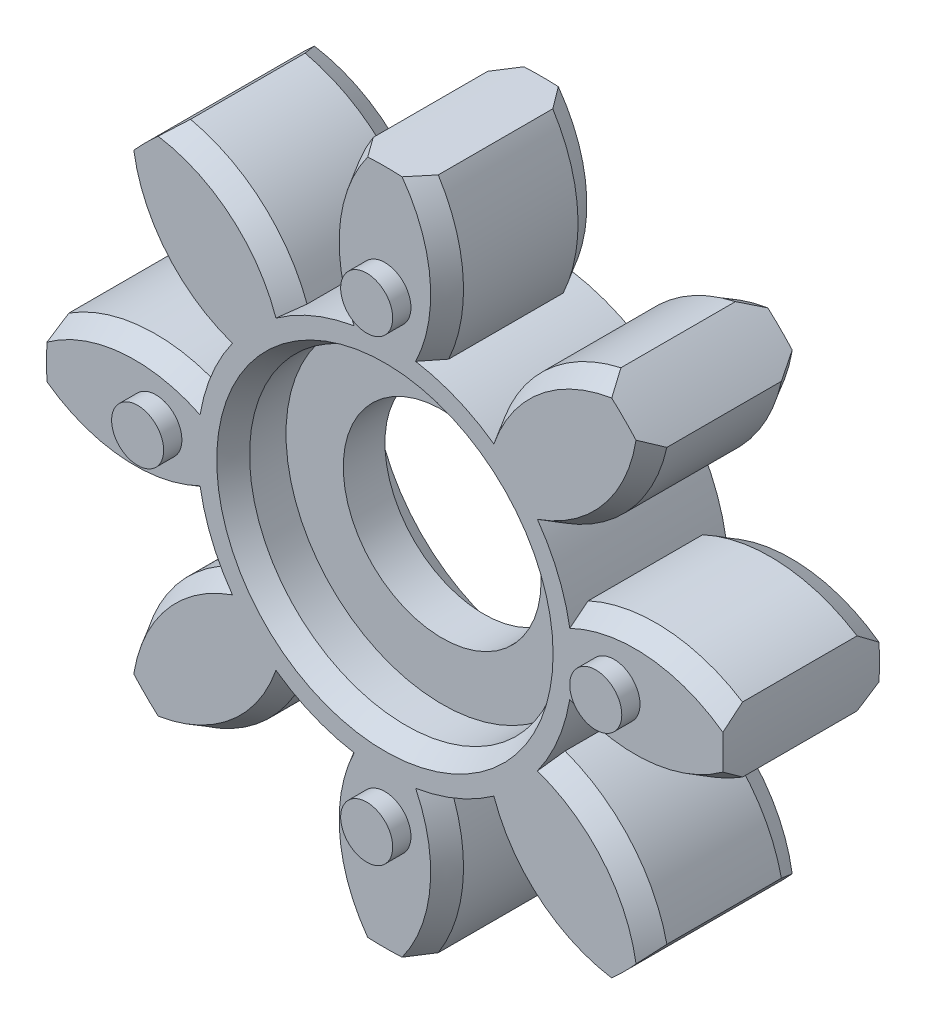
ISO-10303-21;
HEADER;
FILE_DESCRIPTION(('STEP AP214'),'2;1');
FILE_NAME('part.step','',(''),(''),'','','');
FILE_SCHEMA(('AUTOMOTIVE_DESIGN { 1 0 10303 214 1 1 1 1 }'));
ENDSEC;
DATA;
#1=APPLICATION_CONTEXT('core data for automotive mechanical design processes');
#2=APPLICATION_PROTOCOL_DEFINITION('international standard','automotive_design',2000,#1);
#3=PRODUCT_CONTEXT('',#1,'mechanical');
#4=PRODUCT('Part','Part','',(#3));
#5=PRODUCT_RELATED_PRODUCT_CATEGORY('part','',(#4));
#6=PRODUCT_DEFINITION_FORMATION('','',#4);
#7=PRODUCT_DEFINITION_CONTEXT('part definition',#1,'design');
#8=PRODUCT_DEFINITION('design','',#6,#7);
#9=PRODUCT_DEFINITION_SHAPE('','',#8);
#10=(LENGTH_UNIT() NAMED_UNIT(*) SI_UNIT(.MILLI.,.METRE.));
#11=(NAMED_UNIT(*) PLANE_ANGLE_UNIT() SI_UNIT($,.RADIAN.));
#12=(NAMED_UNIT(*) SI_UNIT($,.STERADIAN.) SOLID_ANGLE_UNIT());
#13=UNCERTAINTY_MEASURE_WITH_UNIT(LENGTH_MEASURE(1.E-05),#10,'distance_accuracy_value','');
#14=(GEOMETRIC_REPRESENTATION_CONTEXT(3) GLOBAL_UNCERTAINTY_ASSIGNED_CONTEXT((#13)) GLOBAL_UNIT_ASSIGNED_CONTEXT((#10,
#11,#12)) REPRESENTATION_CONTEXT('',''));
#15=CARTESIAN_POINT('',(0.,0.,0.));
#16=DIRECTION('',(0.,0.,1.));
#17=DIRECTION('',(1.,0.,0.));
#18=AXIS2_PLACEMENT_3D('',#15,#16,#17);
#19=CARTESIAN_POINT('',(0.,0.,2.));
#20=DIRECTION('',(0.,0.,1.));
#21=DIRECTION('',(1.,0.,0.));
#22=AXIS2_PLACEMENT_3D('',#19,#20,#21);
#23=PLANE('',#22);
#24=CARTESIAN_POINT('',(-2.99638713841E-09,-4.563247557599E-09,2.000000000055));
#25=DIRECTION('',(0.,0.,1.));
#26=DIRECTION('',(1.,0.,0.));
#27=AXIS2_PLACEMENT_3D('',#24,#25,#26);
#28=CIRCLE('',#27,9.5);
#29=CARTESIAN_POINT('',(9.49999999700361,-4.563247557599E-09,2.000000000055));
#30=VERTEX_POINT('',#29);
#31=EDGE_CURVE('E2669',#30,#30,#28,.F.);
#32=ORIENTED_EDGE('',*,*,#31,.T.);
#33=EDGE_LOOP('',(#32));
#34=FACE_BOUND('',#33,.T.);
#35=CARTESIAN_POINT('',(0.,0.,2.));
#36=DIRECTION('',(0.,0.,1.));
#37=DIRECTION('',(1.,0.,0.));
#38=AXIS2_PLACEMENT_3D('',#35,#36,#37);
#39=CIRCLE('',#38,15.);
#40=CARTESIAN_POINT('',(15.,0.,2.));
#41=VERTEX_POINT('',#40);
#42=EDGE_CURVE('E2672',#41,#41,#39,.T.);
#43=ORIENTED_EDGE('',*,*,#42,.T.);
#44=EDGE_LOOP('',(#43));
#45=FACE_BOUND('',#44,.T.);
#46=ADVANCED_FACE('F16',(#34,#45),#23,.T.);
#47=CARTESIAN_POINT('',(0.,0.,9.25));
#48=DIRECTION('',(0.,0.,1.));
#49=DIRECTION('',(1.,0.,0.));
#50=AXIS2_PLACEMENT_3D('',#47,#48,#49);
#51=PLANE('',#50);
#52=CARTESIAN_POINT('',(0.,22.,9.25));
#53=DIRECTION('',(0.,0.,1.));
#54=DIRECTION('',(1.,0.,0.));
#55=AXIS2_PLACEMENT_3D('',#52,#53,#54);
#56=CIRCLE('',#55,2.5);
#57=CARTESIAN_POINT('',(2.5,22.,9.25));
#58=VERTEX_POINT('',#57);
#59=EDGE_CURVE('E848',#58,#58,#56,.F.);
#60=ORIENTED_EDGE('',*,*,#59,.F.);
#61=EDGE_LOOP('',(#60));
#62=FACE_BOUND('',#61,.T.);
#63=ADVANCED_FACE('F564',(#62),#51,.T.);
#64=CARTESIAN_POINT('',(0.,0.,7.775));
#65=DIRECTION('',(0.,0.,1.));
#66=DIRECTION('',(1.,0.,0.));
#67=AXIS2_PLACEMENT_3D('',#64,#65,#66);
#68=CYLINDRICAL_SURFACE('',#67,15.);
#69=CARTESIAN_POINT('',(0.,0.,5.49999999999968));
#70=DIRECTION('',(0.,0.,1.));
#71=DIRECTION('',(1.,0.,0.));
#72=AXIS2_PLACEMENT_3D('',#69,#70,#71);
#73=CIRCLE('',#72,15.0000000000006);
#74=CARTESIAN_POINT('',(15.0000000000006,0.,5.49999999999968));
#75=VERTEX_POINT('',#74);
#76=EDGE_CURVE('E845',#75,#75,#73,.T.);
#77=ORIENTED_EDGE('',*,*,#76,.T.);
#78=EDGE_LOOP('',(#77));
#79=FACE_BOUND('',#78,.T.);
#80=ORIENTED_EDGE('',*,*,#42,.F.);
#81=EDGE_LOOP('',(#80));
#82=FACE_BOUND('',#81,.T.);
#83=ADVANCED_FACE('F561',(#79,#82),#68,.F.);
#84=CARTESIAN_POINT('',(0.,0.,9.25));
#85=DIRECTION('',(0.,0.,1.));
#86=DIRECTION('',(1.,0.,0.));
#87=AXIS2_PLACEMENT_3D('',#84,#85,#86);
#88=PLANE('',#87);
#89=CARTESIAN_POINT('',(22.,0.,9.25));
#90=DIRECTION('',(0.,0.,1.));
#91=DIRECTION('',(1.,0.,0.));
#92=AXIS2_PLACEMENT_3D('',#89,#90,#91);
#93=CIRCLE('',#92,2.5);
#94=CARTESIAN_POINT('',(24.5,0.,9.25));
#95=VERTEX_POINT('',#94);
#96=EDGE_CURVE('E847',#95,#95,#93,.F.);
#97=ORIENTED_EDGE('',*,*,#96,.F.);
#98=EDGE_LOOP('',(#97));
#99=FACE_BOUND('',#98,.T.);
#100=ADVANCED_FACE('F557',(#99),#88,.T.);
#101=CARTESIAN_POINT('',(0.,0.,9.25));
#102=DIRECTION('',(0.,0.,1.));
#103=DIRECTION('',(1.,0.,0.));
#104=AXIS2_PLACEMENT_3D('',#101,#102,#103);
#105=PLANE('',#104);
#106=CARTESIAN_POINT('',(0.,-22.,9.25));
#107=DIRECTION('',(0.,0.,1.));
#108=DIRECTION('',(1.,0.,0.));
#109=AXIS2_PLACEMENT_3D('',#106,#107,#108);
#110=CIRCLE('',#109,2.5);
#111=CARTESIAN_POINT('',(2.5,-22.,9.25));
#112=VERTEX_POINT('',#111);
#113=EDGE_CURVE('E2663',#112,#112,#110,.F.);
#114=ORIENTED_EDGE('',*,*,#113,.F.);
#115=EDGE_LOOP('',(#114));
#116=FACE_BOUND('',#115,.T.);
#117=ADVANCED_FACE('F553',(#116),#105,.T.);
#118=CARTESIAN_POINT('',(0.,0.,9.25));
#119=DIRECTION('',(0.,0.,1.));
#120=DIRECTION('',(1.,0.,0.));
#121=AXIS2_PLACEMENT_3D('',#118,#119,#120);
#122=PLANE('',#121);
#123=CARTESIAN_POINT('',(-22.,0.,9.25));
#124=DIRECTION('',(0.,0.,1.));
#125=DIRECTION('',(1.,0.,0.));
#126=AXIS2_PLACEMENT_3D('',#123,#124,#125);
#127=CIRCLE('',#126,2.5);
#128=CARTESIAN_POINT('',(-19.5,0.,9.25));
#129=VERTEX_POINT('',#128);
#130=EDGE_CURVE('E2660',#129,#129,#127,.F.);
#131=ORIENTED_EDGE('',*,*,#130,.F.);
#132=EDGE_LOOP('',(#131));
#133=FACE_BOUND('',#132,.T.);
#134=ADVANCED_FACE('F549',(#133),#122,.T.);
#135=CARTESIAN_POINT('',(-2.99638713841E-09,-4.563247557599E-09,51.24999999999));
#136=DIRECTION('',(0.,0.,1.));
#137=DIRECTION('',(1.,0.,0.));
#138=AXIS2_PLACEMENT_3D('',#135,#136,#137);
#139=CYLINDRICAL_SURFACE('',#138,9.5);
#140=ORIENTED_EDGE('',*,*,#31,.F.);
#141=EDGE_LOOP('',(#140));
#142=FACE_BOUND('',#141,.T.);
#143=CARTESIAN_POINT('',(-2.99638713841E-09,-4.563247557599E-09,-1.999999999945));
#144=DIRECTION('',(0.,0.,1.));
#145=DIRECTION('',(1.,0.,0.));
#146=AXIS2_PLACEMENT_3D('',#143,#144,#145);
#147=CIRCLE('',#146,9.5);
#148=CARTESIAN_POINT('',(9.49999999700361,-4.563247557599E-09,-1.999999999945));
#149=VERTEX_POINT('',#148);
#150=EDGE_CURVE('E836',#149,#149,#147,.F.);
#151=ORIENTED_EDGE('',*,*,#150,.T.);
#152=EDGE_LOOP('',(#151));
#153=FACE_BOUND('',#152,.T.);
#154=ADVANCED_FACE('F546',(#142,#153),#139,.F.);
#155=CARTESIAN_POINT('',(0.,22.,7.5));
#156=DIRECTION('',(0.,0.,1.));
#157=DIRECTION('',(1.,0.,0.));
#158=AXIS2_PLACEMENT_3D('',#155,#156,#157);
#159=CYLINDRICAL_SURFACE('',#158,2.5);
#160=ORIENTED_EDGE('',*,*,#59,.T.);
#161=EDGE_LOOP('',(#160));
#162=FACE_BOUND('',#161,.T.);
#163=CARTESIAN_POINT('',(0.,22.,7.5));
#164=DIRECTION('',(0.,0.,1.));
#165=DIRECTION('',(1.,0.,0.));
#166=AXIS2_PLACEMENT_3D('',#163,#164,#165);
#167=CIRCLE('',#166,2.5);
#168=CARTESIAN_POINT('',(2.5,22.,7.5));
#169=VERTEX_POINT('',#168);
#170=EDGE_CURVE('E1507',#169,#169,#167,.T.);
#171=ORIENTED_EDGE('',*,*,#170,.T.);
#172=EDGE_LOOP('',(#171));
#173=FACE_BOUND('',#172,.T.);
#174=ADVANCED_FACE('F544',(#162,#173),#159,.T.);
#175=CARTESIAN_POINT('',(0.,0.,7.50000000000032));
#176=DIRECTION('',(0.,0.,1.));
#177=DIRECTION('',(1.,0.,0.));
#178=AXIS2_PLACEMENT_3D('',#175,#176,#177);
#179=CONICAL_SURFACE('',#178,16.1547005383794,0.523598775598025);
#180=CARTESIAN_POINT('',(0.,0.,7.50000000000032));
#181=DIRECTION('',(0.,0.,1.));
#182=DIRECTION('',(1.,0.,0.));
#183=AXIS2_PLACEMENT_3D('',#180,#181,#182);
#184=CIRCLE('',#183,16.1547005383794);
#185=CARTESIAN_POINT('',(16.1547005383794,0.,7.50000000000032));
#186=VERTEX_POINT('',#185);
#187=EDGE_CURVE('E2591',#186,#186,#184,.T.);
#188=ORIENTED_EDGE('',*,*,#187,.T.);
#189=EDGE_LOOP('',(#188));
#190=FACE_BOUND('',#189,.T.);
#191=ORIENTED_EDGE('',*,*,#76,.F.);
#192=EDGE_LOOP('',(#191));
#193=FACE_BOUND('',#192,.T.);
#194=ADVANCED_FACE('F2382',(#190,#193),#179,.F.);
#195=CARTESIAN_POINT('',(22.,0.,7.5));
#196=DIRECTION('',(0.,0.,1.));
#197=DIRECTION('',(1.,0.,0.));
#198=AXIS2_PLACEMENT_3D('',#195,#196,#197);
#199=CYLINDRICAL_SURFACE('',#198,2.5);
#200=ORIENTED_EDGE('',*,*,#96,.T.);
#201=EDGE_LOOP('',(#200));
#202=FACE_BOUND('',#201,.T.);
#203=CARTESIAN_POINT('',(22.,0.,7.5));
#204=DIRECTION('',(0.,0.,1.));
#205=DIRECTION('',(1.,0.,0.));
#206=AXIS2_PLACEMENT_3D('',#203,#204,#205);
#207=CIRCLE('',#206,2.5);
#208=CARTESIAN_POINT('',(24.5,0.,7.5));
#209=VERTEX_POINT('',#208);
#210=EDGE_CURVE('E2594',#209,#209,#207,.T.);
#211=ORIENTED_EDGE('',*,*,#210,.T.);
#212=EDGE_LOOP('',(#211));
#213=FACE_BOUND('',#212,.T.);
#214=ADVANCED_FACE('F2372',(#202,#213),#199,.T.);
#215=CARTESIAN_POINT('',(0.,-22.,7.5));
#216=DIRECTION('',(0.,0.,1.));
#217=DIRECTION('',(1.,0.,0.));
#218=AXIS2_PLACEMENT_3D('',#215,#216,#217);
#219=CYLINDRICAL_SURFACE('',#218,2.5);
#220=ORIENTED_EDGE('',*,*,#113,.T.);
#221=EDGE_LOOP('',(#220));
#222=FACE_BOUND('',#221,.T.);
#223=CARTESIAN_POINT('',(0.,-22.,7.5));
#224=DIRECTION('',(0.,0.,1.));
#225=DIRECTION('',(1.,0.,0.));
#226=AXIS2_PLACEMENT_3D('',#223,#224,#225);
#227=CIRCLE('',#226,2.5);
#228=CARTESIAN_POINT('',(2.5,-22.,7.5));
#229=VERTEX_POINT('',#228);
#230=EDGE_CURVE('E2690',#229,#229,#227,.T.);
#231=ORIENTED_EDGE('',*,*,#230,.T.);
#232=EDGE_LOOP('',(#231));
#233=FACE_BOUND('',#232,.T.);
#234=ADVANCED_FACE('F2362',(#222,#233),#219,.T.);
#235=CARTESIAN_POINT('',(-22.,0.,7.5));
#236=DIRECTION('',(0.,0.,1.));
#237=DIRECTION('',(1.,0.,0.));
#238=AXIS2_PLACEMENT_3D('',#235,#236,#237);
#239=CYLINDRICAL_SURFACE('',#238,2.5);
#240=ORIENTED_EDGE('',*,*,#130,.T.);
#241=EDGE_LOOP('',(#240));
#242=FACE_BOUND('',#241,.T.);
#243=CARTESIAN_POINT('',(-22.,0.,7.5));
#244=DIRECTION('',(0.,0.,1.));
#245=DIRECTION('',(1.,0.,0.));
#246=AXIS2_PLACEMENT_3D('',#243,#244,#245);
#247=CIRCLE('',#246,2.5);
#248=CARTESIAN_POINT('',(-19.5,0.,7.5));
#249=VERTEX_POINT('',#248);
#250=EDGE_CURVE('E1479',#249,#249,#247,.T.);
#251=ORIENTED_EDGE('',*,*,#250,.T.);
#252=EDGE_LOOP('',(#251));
#253=FACE_BOUND('',#252,.T.);
#254=ADVANCED_FACE('F2352',(#242,#253),#239,.T.);
#255=CARTESIAN_POINT('',(0.,0.,-2.));
#256=DIRECTION('',(0.,0.,1.));
#257=DIRECTION('',(1.,0.,0.));
#258=AXIS2_PLACEMENT_3D('',#255,#256,#257);
#259=PLANE('',#258);
#260=ORIENTED_EDGE('',*,*,#150,.F.);
#261=EDGE_LOOP('',(#260));
#262=FACE_BOUND('',#261,.T.);
#263=CARTESIAN_POINT('',(0.,0.,-2.));
#264=DIRECTION('',(0.,0.,1.));
#265=DIRECTION('',(1.,0.,0.));
#266=AXIS2_PLACEMENT_3D('',#263,#264,#265);
#267=CIRCLE('',#266,15.);
#268=CARTESIAN_POINT('',(15.,0.,-2.));
#269=VERTEX_POINT('',#268);
#270=EDGE_CURVE('E653',#269,#269,#267,.F.);
#271=ORIENTED_EDGE('',*,*,#270,.T.);
#272=EDGE_LOOP('',(#271));
#273=FACE_BOUND('',#272,.T.);
#274=ADVANCED_FACE('F2344',(#262,#273),#259,.F.);
#275=CARTESIAN_POINT('',(-9.949769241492,-24.02086784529,-7.5));
#276=DIRECTION('',(0.,0.,1.));
#277=DIRECTION('',(1.,0.,0.));
#278=AXIS2_PLACEMENT_3D('',#275,#276,#277);
#279=CYLINDRICAL_SURFACE('',#278,15.49976924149);
#280=DIRECTION('',(0.,0.,1.));
#281=VECTOR('',#280,1.);
#282=CARTESIAN_POINT('',(3.12209144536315,-32.3496915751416,-7.5));
#283=LINE('',#282,#281);
#284=CARTESIAN_POINT('',(3.12209144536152,-32.3496915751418,-5.49999999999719));
#285=VERTEX_POINT('',#284);
#286=CARTESIAN_POINT('',(3.12209144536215,-32.3496915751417,5.49999999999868));
#287=VERTEX_POINT('',#286);
#288=EDGE_CURVE('E1421',#285,#287,#283,.T.);
#289=ORIENTED_EDGE('',*,*,#288,.F.);
#290=CARTESIAN_POINT('',(-9.949769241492,-24.02086784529,-5.49999999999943));
#291=DIRECTION('',(0.,0.,1.));
#292=DIRECTION('',(1.,0.,0.));
#293=AXIS2_PLACEMENT_3D('',#290,#291,#292);
#294=CIRCLE('',#293,15.499769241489);
#295=CARTESIAN_POINT('',(4.12163645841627,-17.5217611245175,-5.49999999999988));
#296=VERTEX_POINT('',#295);
#297=EDGE_CURVE('E686',#296,#285,#294,.F.);
#298=ORIENTED_EDGE('',*,*,#297,.F.);
#299=DIRECTION('',(0.,0.,-1.));
#300=VECTOR('',#299,1.);
#301=CARTESIAN_POINT('',(4.12163645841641,-17.5217611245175,8.25));
#302=LINE('',#301,#300);
#303=CARTESIAN_POINT('',(4.12163645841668,-17.5217611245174,5.50000000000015));
#304=VERTEX_POINT('',#303);
#305=EDGE_CURVE('E687',#304,#296,#302,.T.);
#306=ORIENTED_EDGE('',*,*,#305,.F.);
#307=CARTESIAN_POINT('',(-9.949769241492,-24.02086784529,5.49999999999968));
#308=DIRECTION('',(0.,0.,-1.));
#309=DIRECTION('',(-1.,0.,0.));
#310=AXIS2_PLACEMENT_3D('',#307,#308,#309);
#311=CIRCLE('',#310,15.4997692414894);
#312=EDGE_CURVE('E823',#287,#304,#311,.F.);
#313=ORIENTED_EDGE('',*,*,#312,.F.);
#314=EDGE_LOOP('',(#289,#298,#306,#313));
#315=FACE_BOUND('',#314,.T.);
#316=ADVANCED_FACE('F1485',(#315),#279,.T.);
#317=CARTESIAN_POINT('',(-9.949769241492,-24.02086784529,5.49999999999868));
#318=DIRECTION('',(0.,0.,-1.));
#319=DIRECTION('',(-1.,0.,0.));
#320=AXIS2_PLACEMENT_3D('',#317,#318,#319);
#321=CONICAL_SURFACE('',#320,15.49976924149,0.523598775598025);
#322=ORIENTED_EDGE('',*,*,#312,.T.);
#323=CARTESIAN_POINT('',(2.95489764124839,-17.7558041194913,7.49997254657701));
#324=CARTESIAN_POINT('',(3.05356976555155,-17.7393827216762,7.33380476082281));
#325=CARTESIAN_POINT('',(3.15186502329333,-17.7221797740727,7.16749076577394));
#326=CARTESIAN_POINT('',(3.34772027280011,-17.6862287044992,6.83461437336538));
#327=CARTESIAN_POINT('',(3.44528032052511,-17.6674807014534,6.6680519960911));
#328=CARTESIAN_POINT('',(3.63969871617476,-17.6284549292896,6.33469740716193));
#329=CARTESIAN_POINT('',(3.73655706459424,-17.6081771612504,6.16790519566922));
#330=CARTESIAN_POINT('',(3.92959945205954,-17.5661038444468,5.83410474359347));
#331=CARTESIAN_POINT('',(4.02578343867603,-17.5443081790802,5.66709648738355));
#332=CARTESIAN_POINT('',(4.12163645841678,-17.5217611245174,5.49999999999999));
#333=B_SPLINE_CURVE_WITH_KNOTS('',3,(#323,#324,#325,#326,#327,#328,#329,#330,#331,#332),
.UNSPECIFIED.,.F.,.F.,(4,2,2,2,4),(0.,0.581855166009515,1.16366558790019,1.74547559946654,
2.32733035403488),.UNSPECIFIED.);
#334=CARTESIAN_POINT('',(2.95492252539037,-17.7558063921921,7.49998709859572));
#335=VERTEX_POINT('',#334);
#336=EDGE_CURVE('E695',#335,#304,#333,.T.);
#337=ORIENTED_EDGE('',*,*,#336,.F.);
#338=CARTESIAN_POINT('',(-9.949769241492,-24.02086784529,7.50000000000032));
#339=DIRECTION('',(0.,0.,-1.));
#340=DIRECTION('',(-1.,0.,0.));
#341=AXIS2_PLACEMENT_3D('',#338,#339,#340);
#342=CIRCLE('',#341,14.3450687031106);
#343=CARTESIAN_POINT('',(1.65177552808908,-32.4579980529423,7.50000000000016));
#344=VERTEX_POINT('',#343);
#345=EDGE_CURVE('E422',#335,#344,#342,.T.);
#346=ORIENTED_EDGE('',*,*,#345,.T.);
#347=CARTESIAN_POINT('',(3.1220914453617,-32.3496915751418,5.49999999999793));
#348=CARTESIAN_POINT('',(3.00026024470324,-32.3614494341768,5.66701959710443));
#349=CARTESIAN_POINT('',(2.87826119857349,-32.3725291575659,5.83396459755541));
#350=CARTESIAN_POINT('',(2.63392361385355,-32.3933246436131,6.16767877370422));
#351=CARTESIAN_POINT('',(2.51158509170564,-32.403040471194,6.33444795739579));
#352=CARTESIAN_POINT('',(2.26655304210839,-32.4211016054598,6.66779992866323));
#353=CARTESIAN_POINT('',(2.14385951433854,-32.4294469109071,6.83438271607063));
#354=CARTESIAN_POINT('',(1.89809913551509,-32.4447588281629,7.16734838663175));
#355=CARTESIAN_POINT('',(1.77503226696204,-32.4517253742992,7.33373125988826));
#356=CARTESIAN_POINT('',(1.65177535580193,-32.4579980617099,7.4999995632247));
#357=B_SPLINE_CURVE_WITH_KNOTS('',3,(#347,#348,#349,#350,#351,#352,#353,#354,#355,#356),
.UNSPECIFIED.,.F.,.F.,(4,2,2,2,4),(0.,0.6211991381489,1.24236869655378,1.86353881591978,
2.48473851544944),.UNSPECIFIED.);
#358=EDGE_CURVE('E1415',#287,#344,#357,.T.);
#359=ORIENTED_EDGE('',*,*,#358,.F.);
#360=EDGE_LOOP('',(#322,#337,#346,#359));
#361=FACE_BOUND('',#360,.T.);
#362=ADVANCED_FACE('F1387',(#361),#321,.T.);
#363=CARTESIAN_POINT('',(9.949769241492,-24.02086784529,-7.5));
#364=DIRECTION('',(0.,0.,1.));
#365=DIRECTION('',(1.,0.,0.));
#366=AXIS2_PLACEMENT_3D('',#363,#364,#365);
#367=CYLINDRICAL_SURFACE('',#366,15.49976924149);
#368=CARTESIAN_POINT('',(9.949769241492,-24.02086784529,5.50000000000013));
#369=DIRECTION('',(0.,0.,-1.));
#370=DIRECTION('',(-1.,0.,0.));
#371=AXIS2_PLACEMENT_3D('',#368,#369,#370);
#372=CIRCLE('',#371,15.4997692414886);
#373=CARTESIAN_POINT('',(-4.12163645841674,-17.5217611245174,5.50000000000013));
#374=VERTEX_POINT('',#373);
#375=CARTESIAN_POINT('',(-3.12209144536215,-32.3496915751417,5.49999999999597));
#376=VERTEX_POINT('',#375);
#377=EDGE_CURVE('E817',#374,#376,#372,.F.);
#378=ORIENTED_EDGE('',*,*,#377,.F.);
#379=DIRECTION('',(0.,0.,-1.));
#380=VECTOR('',#379,1.);
#381=CARTESIAN_POINT('',(-4.12163645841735,-17.5217611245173,8.25));
#382=LINE('',#381,#380);
#383=CARTESIAN_POINT('',(-4.12163645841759,-17.5217611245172,-5.49999999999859));
#384=VERTEX_POINT('',#383);
#385=EDGE_CURVE('E1431',#384,#374,#382,.F.);
#386=ORIENTED_EDGE('',*,*,#385,.F.);
#387=CARTESIAN_POINT('',(9.949769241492,-24.02086784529,-5.49999999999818));
#388=DIRECTION('',(0.,0.,1.));
#389=DIRECTION('',(1.,0.,0.));
#390=AXIS2_PLACEMENT_3D('',#387,#388,#389);
#391=CIRCLE('',#390,15.4997692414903);
#392=CARTESIAN_POINT('',(-3.12209144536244,-32.3496915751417,-5.49999999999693));
#393=VERTEX_POINT('',#392);
#394=EDGE_CURVE('E826',#393,#384,#391,.F.);
#395=ORIENTED_EDGE('',*,*,#394,.F.);
#396=DIRECTION('',(0.,0.,1.));
#397=VECTOR('',#396,1.);
#398=CARTESIAN_POINT('',(-3.12209144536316,-32.3496915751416,-7.5));
#399=LINE('',#398,#397);
#400=EDGE_CURVE('E1401',#376,#393,#399,.F.);
#401=ORIENTED_EDGE('',*,*,#400,.F.);
#402=EDGE_LOOP('',(#378,#386,#395,#401));
#403=FACE_BOUND('',#402,.T.);
#404=ADVANCED_FACE('F1383',(#403),#367,.T.);
#405=CARTESIAN_POINT('',(9.949769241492,-24.02086784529,5.50000000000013));
#406=DIRECTION('',(0.,0.,-1.));
#407=DIRECTION('',(-1.,0.,0.));
#408=AXIS2_PLACEMENT_3D('',#405,#406,#407);
#409=CONICAL_SURFACE('',#408,15.4997692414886,0.523598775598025);
#410=ORIENTED_EDGE('',*,*,#377,.T.);
#411=CARTESIAN_POINT('',(-1.65177503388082,-32.4579980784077,7.49999999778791));
#412=CARTESIAN_POINT('',(-1.77503197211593,-32.4517253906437,7.3337316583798));
#413=CARTESIAN_POINT('',(-1.89809886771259,-32.4447588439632,7.16734874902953));
#414=CARTESIAN_POINT('',(-2.14385930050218,-32.4294469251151,6.83438300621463));
#415=CARTESIAN_POINT('',(-2.26655285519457,-32.4211016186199,6.66780018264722));
#416=CARTESIAN_POINT('',(-2.51158495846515,-32.4030404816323,6.33444813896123));
#417=CARTESIAN_POINT('',(-2.63392350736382,-32.3933246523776,6.16767891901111));
#418=CARTESIAN_POINT('',(-2.87826114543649,-32.3725291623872,5.83396467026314));
#419=CARTESIAN_POINT('',(-3.00026021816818,-32.3614494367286,5.66701963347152));
#420=CARTESIAN_POINT('',(-3.12209144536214,-32.3496915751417,5.49999999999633));
#421=B_SPLINE_CURVE_WITH_KNOTS('',3,(#411,#412,#413,#414,#415,#416,#417,#418,#419,#420),
.UNSPECIFIED.,.F.,.F.,(4,2,2,2,4),(0.,0.621199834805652,1.24237008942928,1.86353978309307,
2.48473905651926),.UNSPECIFIED.);
#422=CARTESIAN_POINT('',(-1.65177503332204,-32.4579980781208,7.49999999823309));
#423=VERTEX_POINT('',#422);
#424=EDGE_CURVE('E1393',#423,#376,#421,.T.);
#425=ORIENTED_EDGE('',*,*,#424,.F.);
#426=CARTESIAN_POINT('',(9.949769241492,-24.02086784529,7.5));
#427=DIRECTION('',(0.,0.,-1.));
#428=DIRECTION('',(-1.,0.,0.));
#429=AXIS2_PLACEMENT_3D('',#426,#427,#428);
#430=CIRCLE('',#429,14.3450687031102);
#431=CARTESIAN_POINT('',(-2.95492502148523,-17.755806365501,7.49998631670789));
#432=VERTEX_POINT('',#431);
#433=EDGE_CURVE('E1482',#423,#432,#430,.T.);
#434=ORIENTED_EDGE('',*,*,#433,.T.);
#435=CARTESIAN_POINT('',(-4.12163645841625,-17.5217611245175,5.49999999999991));
#436=CARTESIAN_POINT('',(-4.02578351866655,-17.5443081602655,5.66709634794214));
#437=CARTESIAN_POINT('',(-3.9295996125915,-17.5661038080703,5.83410446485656));
#438=CARTESIAN_POINT('',(-3.73655738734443,-17.6081770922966,6.16790463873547));
#439=CARTESIAN_POINT('',(-3.63969912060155,-17.6284548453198,6.3346967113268));
#440=CARTESIAN_POINT('',(-3.44528088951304,-17.6674805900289,6.6680510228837));
#441=CARTESIAN_POINT('',(-3.34772092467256,-17.6862285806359,6.8346132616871));
#442=CARTESIAN_POINT('',(-3.15186584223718,-17.7221796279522,7.16748937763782));
#443=CARTESIAN_POINT('',(-3.05357066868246,-17.7393825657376,7.33380323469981));
#444=CARTESIAN_POINT('',(-2.95489862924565,-17.7558039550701,7.49997088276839));
#445=B_SPLINE_CURVE_WITH_KNOTS('',3,(#435,#436,#437,#438,#439,#440,#441,#442,#443,#444),
.UNSPECIFIED.,.F.,.F.,(4,2,2,2,4),(0.,0.581854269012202,1.16366379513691,1.74547373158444,
2.3273284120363),.UNSPECIFIED.);
#446=EDGE_CURVE('E1377',#374,#432,#445,.T.);
#447=ORIENTED_EDGE('',*,*,#446,.F.);
#448=EDGE_LOOP('',(#410,#425,#434,#447));
#449=FACE_BOUND('',#448,.T.);
#450=ADVANCED_FACE('F1379',(#449),#409,.T.);
#451=CARTESIAN_POINT('',(-24.02086784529,-9.949769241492,-7.5));
#452=DIRECTION('',(0.,0.,1.));
#453=DIRECTION('',(1.,0.,0.));
#454=AXIS2_PLACEMENT_3D('',#451,#452,#453);
#455=CYLINDRICAL_SURFACE('',#454,15.49976924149);
#456=DIRECTION('',(0.,0.,1.));
#457=VECTOR('',#456,1.);
#458=CARTESIAN_POINT('',(-20.6670342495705,-25.0823383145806,-7.5));
#459=LINE('',#458,#457);
#460=CARTESIAN_POINT('',(-20.6670342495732,-25.0823383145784,-5.49999999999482));
#461=VERTEX_POINT('',#460);
#462=CARTESIAN_POINT('',(-20.667034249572,-25.0823383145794,5.4999999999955));
#463=VERTEX_POINT('',#462);
#464=EDGE_CURVE('E1327',#461,#463,#459,.T.);
#465=ORIENTED_EDGE('',*,*,#464,.F.);
#466=CARTESIAN_POINT('',(-24.02086784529,-9.949769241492,-5.49999999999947));
#467=DIRECTION('',(0.,0.,1.));
#468=DIRECTION('',(1.,0.,0.));
#469=AXIS2_PLACEMENT_3D('',#466,#467,#468);
#470=CIRCLE('',#469,15.499769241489);
#471=CARTESIAN_POINT('',(-9.47531902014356,-15.3041931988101,-5.49999999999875));
#472=VERTEX_POINT('',#471);
#473=EDGE_CURVE('E818',#472,#461,#470,.F.);
#474=ORIENTED_EDGE('',*,*,#473,.F.);
#475=DIRECTION('',(0.,0.,-1.));
#476=VECTOR('',#475,1.);
#477=CARTESIAN_POINT('',(-9.4753190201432,-15.3041931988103,8.25));
#478=LINE('',#477,#476);
#479=CARTESIAN_POINT('',(-9.47531902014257,-15.3041931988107,5.49999999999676));
#480=VERTEX_POINT('',#479);
#481=EDGE_CURVE('E828',#480,#472,#478,.T.);
#482=ORIENTED_EDGE('',*,*,#481,.F.);
#483=CARTESIAN_POINT('',(-24.02086784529,-9.949769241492,5.4999999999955));
#484=DIRECTION('',(0.,0.,-1.));
#485=DIRECTION('',(-1.,0.,0.));
#486=AXIS2_PLACEMENT_3D('',#483,#484,#485);
#487=CIRCLE('',#486,15.4997692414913);
#488=EDGE_CURVE('E810',#463,#480,#487,.F.);
#489=ORIENTED_EDGE('',*,*,#488,.F.);
#490=EDGE_LOOP('',(#465,#474,#482,#489));
#491=FACE_BOUND('',#490,.T.);
#492=ADVANCED_FACE('F1337',(#491),#455,.T.);
#493=CARTESIAN_POINT('',(-24.02086784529,-9.949769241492,5.4999999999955));
#494=DIRECTION('',(0.,0.,-1.));
#495=DIRECTION('',(-1.,0.,0.));
#496=AXIS2_PLACEMENT_3D('',#493,#494,#495);
#497=CONICAL_SURFACE('',#496,15.4997692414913,0.523598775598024);
#498=ORIENTED_EDGE('',*,*,#488,.T.);
#499=CARTESIAN_POINT('',(-10.4657953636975,-14.6446962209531,7.49991951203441));
#500=CARTESIAN_POINT('',(-10.3844140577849,-14.7028545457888,7.33375611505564));
#501=CARTESIAN_POINT('',(-10.3027466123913,-14.7601937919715,7.16744651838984));
#502=CARTESIAN_POINT('',(-10.138839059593,-14.8732598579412,6.83457893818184));
#503=CARTESIAN_POINT('',(-10.056598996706,-14.9289868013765,6.66802097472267));
#504=CARTESIAN_POINT('',(-9.89153337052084,-15.0388628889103,6.3346752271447));
#505=CARTESIAN_POINT('',(-9.80870780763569,-15.0930120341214,6.16788744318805));
#506=CARTESIAN_POINT('',(-9.64246028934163,-15.1997603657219,5.83409585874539));
#507=CARTESIAN_POINT('',(-9.55903828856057,-15.252359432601,5.66709204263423));
#508=CARTESIAN_POINT('',(-9.47531902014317,-15.3041931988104,5.49999999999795));
#509=B_SPLINE_CURVE_WITH_KNOTS('',3,(#499,#500,#501,#502,#503,#504,#505,#506,#507,#508),
.UNSPECIFIED.,.F.,.F.,(4,2,2,2,4),(0.,0.581839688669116,1.16363463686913,1.74542917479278,
2.32726845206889),.UNSPECIFIED.);
#510=CARTESIAN_POINT('',(-10.465783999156,-14.6448450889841,7.49997718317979));
#511=VERTEX_POINT('',#510);
#512=EDGE_CURVE('E1349',#511,#480,#509,.T.);
#513=ORIENTED_EDGE('',*,*,#512,.F.);
#514=CARTESIAN_POINT('',(-24.02086784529,-9.949769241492,7.5));
#515=DIRECTION('',(0.,0.,-1.));
#516=DIRECTION('',(-1.,0.,0.));
#517=AXIS2_PLACEMENT_3D('',#514,#515,#516);
#518=CIRCLE('',#517,14.3450687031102);
#519=CARTESIAN_POINT('',(-21.7832891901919,-24.1192518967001,7.50000000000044));
#520=VERTEX_POINT('',#519);
#521=EDGE_CURVE('E1528',#511,#520,#518,.T.);
#522=ORIENTED_EDGE('',*,*,#521,.T.);
#523=CARTESIAN_POINT('',(-20.667034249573,-25.0823383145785,5.49999999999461));
#524=CARTESIAN_POINT('',(-20.7614959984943,-25.0045046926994,5.66701963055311));
#525=CARTESIAN_POINT('',(-20.8555969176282,-24.9260728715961,5.83396466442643));
#526=CARTESIAN_POINT('',(-21.0430743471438,-24.7680047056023,6.1676789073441));
#527=CARTESIAN_POINT('',(-21.1364508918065,-24.6883684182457,6.33444812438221));
#528=CARTESIAN_POINT('',(-21.322485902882,-24.5278757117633,6.66780016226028));
#529=CARTESIAN_POINT('',(-21.4151443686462,-24.4470192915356,6.83438298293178));
#530=CARTESIAN_POINT('',(-21.5997503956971,-24.2840675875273,7.16734871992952));
#531=CARTESIAN_POINT('',(-21.6916979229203,-24.2019722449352,7.33373162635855));
#532=CARTESIAN_POINT('',(-21.7832891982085,-24.1192518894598,7.49999996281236));
#533=B_SPLINE_CURVE_WITH_KNOTS('',3,(#523,#524,#525,#526,#527,#528,#529,#530,#531,#532),
.UNSPECIFIED.,.F.,.F.,(4,2,2,2,4),(0.,0.621199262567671,1.24236894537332,1.86353918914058,
2.48473901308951),.UNSPECIFIED.);
#534=EDGE_CURVE('E1320',#463,#520,#533,.T.);
#535=ORIENTED_EDGE('',*,*,#534,.F.);
#536=EDGE_LOOP('',(#498,#513,#522,#535));
#537=FACE_BOUND('',#536,.T.);
#538=ADVANCED_FACE('F1333',(#537),#497,.T.);
#539=CARTESIAN_POINT('',(-9.949769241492,-24.02086784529,-7.5));
#540=DIRECTION('',(0.,0.,1.));
#541=DIRECTION('',(1.,0.,0.));
#542=AXIS2_PLACEMENT_3D('',#539,#540,#541);
#543=CYLINDRICAL_SURFACE('',#542,15.49976924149);
#544=DIRECTION('',(0.,0.,1.));
#545=VECTOR('',#544,1.);
#546=CARTESIAN_POINT('',(-25.0823383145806,-20.6670342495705,-7.5));
#547=LINE('',#546,#545);
#548=CARTESIAN_POINT('',(-25.0823383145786,-20.6670342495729,5.49999999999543));
#549=VERTEX_POINT('',#548);
#550=CARTESIAN_POINT('',(-25.0823383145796,-20.6670342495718,-5.49999999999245));
#551=VERTEX_POINT('',#550);
#552=EDGE_CURVE('E1436',#549,#551,#547,.F.);
#553=ORIENTED_EDGE('',*,*,#552,.F.);
#554=CARTESIAN_POINT('',(-9.949769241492,-24.02086784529,5.49999999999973));
#555=DIRECTION('',(0.,0.,-1.));
#556=DIRECTION('',(-1.,0.,0.));
#557=AXIS2_PLACEMENT_3D('',#554,#555,#556);
#558=CIRCLE('',#557,15.4997692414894);
#559=CARTESIAN_POINT('',(-15.3041931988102,-9.47531902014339,5.49999999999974));
#560=VERTEX_POINT('',#559);
#561=EDGE_CURVE('E807',#560,#549,#558,.F.);
#562=ORIENTED_EDGE('',*,*,#561,.F.);
#563=DIRECTION('',(0.,0.,-1.));
#564=VECTOR('',#563,1.);
#565=CARTESIAN_POINT('',(-15.3041931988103,-9.47531902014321,8.25));
#566=LINE('',#565,#564);
#567=CARTESIAN_POINT('',(-15.3041931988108,-9.47531902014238,-5.4999999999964));
#568=VERTEX_POINT('',#567);
#569=EDGE_CURVE('E1288',#568,#560,#566,.F.);
#570=ORIENTED_EDGE('',*,*,#569,.F.);
#571=CARTESIAN_POINT('',(-9.949769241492,-24.02086784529,-5.49999999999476));
#572=DIRECTION('',(0.,0.,1.));
#573=DIRECTION('',(1.,0.,0.));
#574=AXIS2_PLACEMENT_3D('',#571,#572,#573);
#575=CIRCLE('',#574,15.4997692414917);
#576=EDGE_CURVE('E811',#551,#568,#575,.F.);
#577=ORIENTED_EDGE('',*,*,#576,.F.);
#578=EDGE_LOOP('',(#553,#562,#570,#577));
#579=FACE_BOUND('',#578,.T.);
#580=ADVANCED_FACE('F1267',(#579),#543,.T.);
#581=CARTESIAN_POINT('',(-9.949769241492,-24.02086784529,5.499999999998));
#582=DIRECTION('',(0.,0.,-1.));
#583=DIRECTION('',(-1.,0.,0.));
#584=AXIS2_PLACEMENT_3D('',#581,#582,#583);
#585=CONICAL_SURFACE('',#584,15.4997692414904,0.523598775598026);
#586=ORIENTED_EDGE('',*,*,#561,.T.);
#587=CARTESIAN_POINT('',(-24.1192518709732,-21.78328921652,7.49999999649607));
#588=CARTESIAN_POINT('',(-24.2019722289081,-21.6916979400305,7.33373165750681));
#589=CARTESIAN_POINT('',(-24.2840675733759,-21.599750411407,7.16734874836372));
#590=CARTESIAN_POINT('',(-24.4470192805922,-21.415144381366,6.83438300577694));
#591=CARTESIAN_POINT('',(-24.5278757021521,-21.322485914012,6.66780018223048));
#592=CARTESIAN_POINT('',(-24.6883684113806,-21.1364508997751,6.3344481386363));
#593=CARTESIAN_POINT('',(-24.768004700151,-21.0430743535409,6.16767891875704));
#594=CARTESIAN_POINT('',(-24.9260728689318,-20.8555969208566,5.83396467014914));
#595=CARTESIAN_POINT('',(-25.0045046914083,-20.7614960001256,5.66701963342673));
#596=CARTESIAN_POINT('',(-25.0823383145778,-20.667034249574,5.49999999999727));
#597=B_SPLINE_CURVE_WITH_KNOTS('',3,(#587,#588,#589,#590,#591,#592,#593,#594,#595,#596),
.UNSPECIFIED.,.F.,.F.,(4,2,2,2,4),(0.,0.621199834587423,1.24237008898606,1.86353978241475,
2.4847390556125),.UNSPECIFIED.);
#598=CARTESIAN_POINT('',(-24.1192518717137,-21.7832892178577,7.49999999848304));
#599=VERTEX_POINT('',#598);
#600=EDGE_CURVE('E1272',#599,#549,#597,.T.);
#601=ORIENTED_EDGE('',*,*,#600,.F.);
#602=CARTESIAN_POINT('',(-9.949769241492,-24.02086784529,7.5000000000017));
#603=DIRECTION('',(0.,0.,-1.));
#604=DIRECTION('',(-1.,0.,0.));
#605=AXIS2_PLACEMENT_3D('',#602,#603,#604);
#606=CIRCLE('',#605,14.3450687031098);
#607=CARTESIAN_POINT('',(-14.6446708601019,-10.4658323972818,7.49999884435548));
#608=VERTEX_POINT('',#607);
#609=EDGE_CURVE('E1521',#599,#608,#606,.T.);
#610=ORIENTED_EDGE('',*,*,#609,.T.);
#611=CARTESIAN_POINT('',(-15.3041931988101,-9.47531902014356,5.49999999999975));
#612=CARTESIAN_POINT('',(-15.252357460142,-9.55904147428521,5.66709840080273));
#613=CARTESIAN_POINT('',(-15.1997563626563,-9.64246663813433,5.83410856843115));
#614=CARTESIAN_POINT('',(-15.0930038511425,-9.80872043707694,6.16791283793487));
#615=CARTESIAN_POINT('',(-15.0388525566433,-9.89154911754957,6.3347069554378));
#616=CARTESIAN_POINT('',(-14.9289720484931,-10.0566209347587,6.66806535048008));
#617=CARTESIAN_POINT('',(-14.8732428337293,-10.1388640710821,6.83462962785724));
#618=CARTESIAN_POINT('',(-14.7601720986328,-10.3027777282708,7.16750981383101));
#619=CARTESIAN_POINT('',(-14.7028304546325,-10.3844482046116,7.33382570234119));
#620=CARTESIAN_POINT('',(-14.6446696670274,-10.4658325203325,7.49999537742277));
#621=B_SPLINE_CURVE_WITH_KNOTS('',3,(#611,#612,#613,#614,#615,#616,#617,#618,#619,#620),
.UNSPECIFIED.,.F.,.F.,(4,2,2,2,4),(0.,0.581861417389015,1.16367809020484,1.74549517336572,
2.32735700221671),.UNSPECIFIED.);
#622=EDGE_CURVE('E1281',#560,#608,#621,.T.);
#623=ORIENTED_EDGE('',*,*,#622,.F.);
#624=EDGE_LOOP('',(#586,#601,#610,#623));
#625=FACE_BOUND('',#624,.T.);
#626=ADVANCED_FACE('F1261',(#625),#585,.T.);
#627=CARTESIAN_POINT('',(-24.02086784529,9.949769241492,5.49999999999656));
#628=DIRECTION('',(0.,0.,-1.));
#629=DIRECTION('',(-1.,0.,0.));
#630=AXIS2_PLACEMENT_3D('',#627,#628,#629);
#631=CONICAL_SURFACE('',#630,15.4997692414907,0.523598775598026);
#632=CARTESIAN_POINT('',(-24.02086784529,9.949769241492,5.499999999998));
#633=DIRECTION('',(0.,0.,1.));
#634=DIRECTION('',(1.,0.,0.));
#635=AXIS2_PLACEMENT_3D('',#632,#633,#634);
#636=CIRCLE('',#635,15.49976924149);
#637=CARTESIAN_POINT('',(-17.5217611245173,-4.12163645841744,5.49999999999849));
#638=VERTEX_POINT('',#637);
#639=CARTESIAN_POINT('',(-32.3496915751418,-3.12209144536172,5.49999999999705));
#640=VERTEX_POINT('',#639);
#641=EDGE_CURVE('E809',#638,#640,#636,.F.);
#642=ORIENTED_EDGE('',*,*,#641,.F.);
#643=CARTESIAN_POINT('',(-17.7557991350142,-2.95492759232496,7.49992210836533));
#644=CARTESIAN_POINT('',(-17.7393779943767,-3.05359714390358,7.33375849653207));
#645=CARTESIAN_POINT('',(-17.7221753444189,-3.15188984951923,7.16744868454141));
#646=CARTESIAN_POINT('',(-17.686224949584,-3.34774003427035,6.83458067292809));
#647=CARTESIAN_POINT('',(-17.6674773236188,-3.44529756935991,6.66802249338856));
#648=CARTESIAN_POINT('',(-17.6284523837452,-3.63971097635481,6.33467631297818));
#649=CARTESIAN_POINT('',(-17.6081750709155,-3.7365668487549,6.16788831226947));
#650=CARTESIAN_POINT('',(-17.5661027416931,-3.92960431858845,5.83409629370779));
#651=CARTESIAN_POINT('',(-17.5443076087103,-4.02578586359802,5.66709226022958));
#652=CARTESIAN_POINT('',(-17.5217611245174,-4.12163645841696,5.49999999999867));
#653=B_SPLINE_CURVE_WITH_KNOTS('',3,(#643,#644,#645,#646,#647,#648,#649,#650,#651,#652),
.UNSPECIFIED.,.F.,.F.,(4,2,2,2,4),(0.,0.581840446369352,1.16363615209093,1.74543144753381,
2.3272714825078),.UNSPECIFIED.);
#654=CARTESIAN_POINT('',(-17.7558934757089,-2.95503731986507,7.49997794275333));
#655=VERTEX_POINT('',#654);
#656=EDGE_CURVE('E1246',#655,#638,#653,.T.);
#657=ORIENTED_EDGE('',*,*,#656,.F.);
#658=CARTESIAN_POINT('',(-24.02086784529,9.949769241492,7.50000000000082));
#659=DIRECTION('',(0.,0.,-1.));
#660=DIRECTION('',(-1.,0.,0.));
#661=AXIS2_PLACEMENT_3D('',#658,#659,#660);
#662=CIRCLE('',#661,14.3450687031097);
#663=CARTESIAN_POINT('',(-32.457998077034,-1.65177505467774,7.49999996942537));
#664=VERTEX_POINT('',#663);
#665=EDGE_CURVE('E1517',#655,#664,#662,.T.);
#666=ORIENTED_EDGE('',*,*,#665,.T.);
#667=CARTESIAN_POINT('',(-32.3496915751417,-3.12209144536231,5.4999999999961));
#668=CARTESIAN_POINT('',(-32.3614494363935,-3.00026022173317,5.66701962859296));
#669=CARTESIAN_POINT('',(-32.3725291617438,-2.87826115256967,5.83396466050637));
#670=CARTESIAN_POINT('',(-32.3933246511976,-2.63392352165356,6.16767889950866));
#671=CARTESIAN_POINT('',(-32.403040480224,-2.51158497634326,6.33444811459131));
#672=CARTESIAN_POINT('',(-32.4211016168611,-2.26655288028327,6.66780014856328));
#673=CARTESIAN_POINT('',(-32.4294469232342,-2.14385932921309,6.83438296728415));
#674=CARTESIAN_POINT('',(-32.4447588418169,-1.89809890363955,7.167348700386));
#675=CARTESIAN_POINT('',(-32.4517253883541,-1.77503201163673,7.33373160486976));
#676=CARTESIAN_POINT('',(-32.4579980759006,-1.6517750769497,7.49999993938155));
#677=B_SPLINE_CURVE_WITH_KNOTS('',3,(#667,#668,#669,#670,#671,#672,#673,#674,#675,#676),
.UNSPECIFIED.,.F.,.F.,(4,2,2,2,4),(0.,0.621199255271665,1.24236893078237,1.86353916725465,
2.48473898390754),.UNSPECIFIED.);
#678=EDGE_CURVE('E799',#640,#664,#677,.T.);
#679=ORIENTED_EDGE('',*,*,#678,.F.);
#680=EDGE_LOOP('',(#642,#657,#666,#679));
#681=FACE_BOUND('',#680,.T.);
#682=ADVANCED_FACE('F1257',(#681),#631,.T.);
#683=CARTESIAN_POINT('',(-24.02086784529,9.949769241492,-7.5));
#684=DIRECTION('',(0.,0.,1.));
#685=DIRECTION('',(1.,0.,0.));
#686=AXIS2_PLACEMENT_3D('',#683,#684,#685);
#687=CYLINDRICAL_SURFACE('',#686,15.49976924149);
#688=DIRECTION('',(0.,0.,1.));
#689=VECTOR('',#688,1.);
#690=CARTESIAN_POINT('',(-32.3496915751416,-3.12209144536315,-7.5));
#691=LINE('',#690,#689);
#692=CARTESIAN_POINT('',(-32.3496915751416,-3.12209144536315,-5.49999999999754));
#693=VERTEX_POINT('',#692);
#694=EDGE_CURVE('E800',#693,#640,#691,.T.);
#695=ORIENTED_EDGE('',*,*,#694,.F.);
#696=CARTESIAN_POINT('',(-24.02086784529,9.949769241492,-5.50000000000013));
#697=DIRECTION('',(0.,0.,1.));
#698=DIRECTION('',(1.,0.,0.));
#699=AXIS2_PLACEMENT_3D('',#696,#697,#698);
#700=CIRCLE('',#699,15.4997692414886);
#701=CARTESIAN_POINT('',(-17.5217611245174,-4.12163645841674,-5.49999999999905));
#702=VERTEX_POINT('',#701);
#703=EDGE_CURVE('E803',#702,#693,#700,.F.);
#704=ORIENTED_EDGE('',*,*,#703,.F.);
#705=DIRECTION('',(0.,0.,-1.));
#706=VECTOR('',#705,1.);
#707=CARTESIAN_POINT('',(-17.5217611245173,-4.12163645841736,8.25));
#708=LINE('',#707,#706);
#709=EDGE_CURVE('E813',#638,#702,#708,.T.);
#710=ORIENTED_EDGE('',*,*,#709,.F.);
#711=ORIENTED_EDGE('',*,*,#641,.T.);
#712=EDGE_LOOP('',(#695,#704,#710,#711));
#713=FACE_BOUND('',#712,.T.);
#714=ADVANCED_FACE('F1209',(#713),#687,.T.);
#715=CARTESIAN_POINT('',(0.,0.,-7.5));
#716=DIRECTION('',(0.,0.,1.));
#717=DIRECTION('',(1.,0.,0.));
#718=AXIS2_PLACEMENT_3D('',#715,#716,#717);
#719=CYLINDRICAL_SURFACE('',#718,32.5);
#720=DIRECTION('',(0.,0.,1.));
#721=VECTOR('',#720,1.);
#722=CARTESIAN_POINT('',(-32.3496915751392,3.12209144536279,-7.5));
#723=LINE('',#722,#721);
#724=CARTESIAN_POINT('',(-32.3496915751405,3.12209144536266,-5.49999999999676));
#725=VERTEX_POINT('',#724);
#726=CARTESIAN_POINT('',(-32.3496915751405,3.12209144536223,5.49999999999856));
#727=VERTEX_POINT('',#726);
#728=EDGE_CURVE('E793',#725,#727,#723,.T.);
#729=ORIENTED_EDGE('',*,*,#728,.F.);
#730=CARTESIAN_POINT('',(-32.4579980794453,1.65177504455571,-7.49999998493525));
#731=CARTESIAN_POINT('',(-32.4517253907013,1.77503198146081,-7.33373164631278));
#732=CARTESIAN_POINT('',(-32.4447588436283,1.8980988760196,-7.16734873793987));
#733=CARTESIAN_POINT('',(-32.4294469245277,2.14385930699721,-6.83438299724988));
#734=CARTESIAN_POINT('',(-32.4211016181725,2.26655286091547,-6.66780017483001));
#735=CARTESIAN_POINT('',(-32.4030404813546,2.51158496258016,-6.33444813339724));
#736=CARTESIAN_POINT('',(-32.3933246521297,2.63392351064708,-6.16767891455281));
#737=CARTESIAN_POINT('',(-32.3725291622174,2.87826114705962,-5.83396466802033));
#738=CARTESIAN_POINT('',(-32.361449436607,3.00026021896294,-5.66701963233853));
#739=CARTESIAN_POINT('',(-32.3496915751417,3.12209144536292,-5.49999999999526));
#740=B_SPLINE_CURVE_WITH_KNOTS('',3,(#730,#731,#732,#733,#734,#735,#736,#737,#738,#739),
.UNSPECIFIED.,.F.,.F.,(4,2,2,2,4),(0.,0.621199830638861,1.2423700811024,1.86353977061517,
2.48473903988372),.UNSPECIFIED.);
#741=CARTESIAN_POINT('',(-32.4579980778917,1.65177503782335,-7.49999999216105));
#742=VERTEX_POINT('',#741);
#743=EDGE_CURVE('E797',#742,#725,#740,.T.);
#744=ORIENTED_EDGE('',*,*,#743,.F.);
#745=CARTESIAN_POINT('',(0.,0.,-7.5));
#746=DIRECTION('',(0.,0.,1.));
#747=DIRECTION('',(1.,0.,0.));
#748=AXIS2_PLACEMENT_3D('',#745,#746,#747);
#749=CIRCLE('',#748,32.5);
#750=CARTESIAN_POINT('',(-32.4579980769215,-1.65177505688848,-7.5));
#751=VERTEX_POINT('',#750);
#752=EDGE_CURVE('E367',#742,#751,#749,.T.);
#753=ORIENTED_EDGE('',*,*,#752,.T.);
#754=CARTESIAN_POINT('',(-32.3496915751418,-3.12209144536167,-5.49999999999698));
#755=CARTESIAN_POINT('',(-32.3614494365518,-3.00026022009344,-5.66701963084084));
#756=CARTESIAN_POINT('',(-32.372529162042,-2.87826114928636,-5.83396466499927));
#757=CARTESIAN_POINT('',(-32.3933246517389,-2.63392351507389,-6.16767890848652));
#758=CARTESIAN_POINT('',(-32.4030404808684,-2.51158496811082,-6.3344481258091));
#759=CARTESIAN_POINT('',(-32.4211016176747,-2.26655286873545,-6.66780016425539));
#760=CARTESIAN_POINT('',(-32.4294469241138,-2.14385931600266,-6.83438298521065));
#761=CARTESIAN_POINT('',(-32.4447588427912,-1.89809888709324,-7.16734872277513));
#762=CARTESIAN_POINT('',(-32.451725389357,-1.77503199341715,-7.33373162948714));
#763=CARTESIAN_POINT('',(-32.4579980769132,-1.65177505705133,-7.49999996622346));
#764=B_SPLINE_CURVE_WITH_KNOTS('',3,(#754,#755,#756,#757,#758,#759,#760,#761,#762,#763),
.UNSPECIFIED.,.F.,.F.,(4,2,2,2,4),(0.,0.621199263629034,1.2423689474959,1.86353919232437,
2.48473901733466),.UNSPECIFIED.);
#765=EDGE_CURVE('E806',#693,#751,#764,.T.);
#766=ORIENTED_EDGE('',*,*,#765,.F.);
#767=ORIENTED_EDGE('',*,*,#694,.T.);
#768=ORIENTED_EDGE('',*,*,#678,.T.);
#769=CARTESIAN_POINT('',(0.,0.,7.5));
#770=DIRECTION('',(0.,0.,1.));
#771=DIRECTION('',(1.,0.,0.));
#772=AXIS2_PLACEMENT_3D('',#769,#770,#771);
#773=CIRCLE('',#772,32.5);
#774=CARTESIAN_POINT('',(-32.4579980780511,1.65177503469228,7.49999999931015));
#775=VERTEX_POINT('',#774);
#776=EDGE_CURVE('E1520',#664,#775,#773,.F.);
#777=ORIENTED_EDGE('',*,*,#776,.T.);
#778=CARTESIAN_POINT('',(-32.3496915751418,3.12209144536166,5.49999999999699));
#779=CARTESIAN_POINT('',(-32.3614494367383,3.00026021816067,5.66701963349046));
#780=CARTESIAN_POINT('',(-32.3725291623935,2.87826114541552,5.83396467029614));
#781=CARTESIAN_POINT('',(-32.393324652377,2.63392350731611,6.16767891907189));
#782=CARTESIAN_POINT('',(-32.4030404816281,2.51158495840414,6.33444813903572));
#783=CARTESIAN_POINT('',(-32.421101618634,2.26655285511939,6.66780018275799));
#784=CARTESIAN_POINT('',(-32.429446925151,2.14385930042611,6.83438300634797));
#785=CARTESIAN_POINT('',(-32.4447588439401,1.89809886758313,7.16734874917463));
#786=CARTESIAN_POINT('',(-32.4517253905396,1.77503197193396,7.3337316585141));
#787=CARTESIAN_POINT('',(-32.4579980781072,1.65177503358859,7.49999999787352));
#788=B_SPLINE_CURVE_WITH_KNOTS('',3,(#778,#779,#780,#781,#782,#783,#784,#785,#786,#787),
.UNSPECIFIED.,.F.,.F.,(4,2,2,2,4),(0.,0.621199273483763,1.24236896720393,1.86353922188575,
2.48473905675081),.UNSPECIFIED.);
#789=EDGE_CURVE('E533',#727,#775,#788,.T.);
#790=ORIENTED_EDGE('',*,*,#789,.F.);
#791=EDGE_LOOP('',(#729,#744,#753,#766,#767,#768,#777,#790));
#792=FACE_BOUND('',#791,.T.);
#793=ADVANCED_FACE('F1204',(#792),#719,.T.);
#794=CARTESIAN_POINT('',(-24.02086784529,-9.949769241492,-7.5));
#795=DIRECTION('',(0.,0.,1.));
#796=DIRECTION('',(1.,0.,0.));
#797=AXIS2_PLACEMENT_3D('',#794,#795,#796);
#798=CYLINDRICAL_SURFACE('',#797,15.49976924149);
#799=ORIENTED_EDGE('',*,*,#728,.T.);
#800=CARTESIAN_POINT('',(-24.02086784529,-9.949769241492,5.50000000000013));
#801=DIRECTION('',(0.,0.,-1.));
#802=DIRECTION('',(-1.,0.,0.));
#803=AXIS2_PLACEMENT_3D('',#800,#801,#802);
#804=CIRCLE('',#803,15.4997692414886);
#805=CARTESIAN_POINT('',(-17.5217611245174,4.12163645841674,5.50000000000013));
#806=VERTEX_POINT('',#805);
#807=EDGE_CURVE('E790',#806,#727,#804,.F.);
#808=ORIENTED_EDGE('',*,*,#807,.F.);
#809=DIRECTION('',(0.,0.,-1.));
#810=VECTOR('',#809,1.);
#811=CARTESIAN_POINT('',(-17.5217611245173,4.12163645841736,8.25));
#812=LINE('',#811,#810);
#813=CARTESIAN_POINT('',(-17.5217611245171,4.12163645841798,-5.4999999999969));
#814=VERTEX_POINT('',#813);
#815=EDGE_CURVE('E1193',#814,#806,#812,.F.);
#816=ORIENTED_EDGE('',*,*,#815,.F.);
#817=CARTESIAN_POINT('',(-24.02086784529,-9.949769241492,-5.49999999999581));
#818=DIRECTION('',(0.,0.,1.));
#819=DIRECTION('',(1.,0.,0.));
#820=AXIS2_PLACEMENT_3D('',#817,#818,#819);
#821=CIRCLE('',#820,15.4997692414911);
#822=EDGE_CURVE('E794',#725,#814,#821,.F.);
#823=ORIENTED_EDGE('',*,*,#822,.F.);
#824=EDGE_LOOP('',(#799,#808,#816,#823));
#825=FACE_BOUND('',#824,.T.);
#826=ADVANCED_FACE('F1200',(#825),#798,.T.);
#827=CARTESIAN_POINT('',(-24.02086784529,-9.949769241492,5.49999999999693));
#828=DIRECTION('',(0.,0.,-1.));
#829=DIRECTION('',(-1.,0.,0.));
#830=AXIS2_PLACEMENT_3D('',#827,#828,#829);
#831=CONICAL_SURFACE('',#830,15.4997692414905,0.523598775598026);
#832=ORIENTED_EDGE('',*,*,#807,.T.);
#833=ORIENTED_EDGE('',*,*,#789,.T.);
#834=CARTESIAN_POINT('',(-24.02086784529,-9.949769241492,7.499999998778));
#835=DIRECTION('',(0.,0.,-1.));
#836=DIRECTION('',(-1.,0.,0.));
#837=AXIS2_PLACEMENT_3D('',#834,#835,#836);
#838=CIRCLE('',#837,14.3450687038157);
#839=CARTESIAN_POINT('',(-17.7558071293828,2.9548849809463,7.49999885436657));
#840=VERTEX_POINT('',#839);
#841=EDGE_CURVE('E1526',#775,#840,#838,.T.);
#842=ORIENTED_EDGE('',*,*,#841,.T.);
#843=CARTESIAN_POINT('',(-17.5217611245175,4.12163645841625,5.4999999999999));
#844=CARTESIAN_POINT('',(-17.5443084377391,4.02578233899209,5.66709840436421));
#845=CARTESIAN_POINT('',(-17.566104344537,3.92959724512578,5.83410857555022));
#846=CARTESIAN_POINT('',(-17.6081781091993,3.7365526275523,6.16791285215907));
#847=CARTESIAN_POINT('',(-17.6284560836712,3.63969315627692,6.33470697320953));
#848=CARTESIAN_POINT('',(-17.6674822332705,3.44527249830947,6.66806537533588));
#849=CARTESIAN_POINT('',(-17.6862304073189,3.34771131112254,6.83462965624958));
#850=CARTESIAN_POINT('',(-17.722181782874,3.15185376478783,7.16750984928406));
#851=CARTESIAN_POINT('',(-17.7393848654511,3.05355734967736,7.33382574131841));
#852=CARTESIAN_POINT('',(-17.7558063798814,2.95488405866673,7.49999541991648));
#853=B_SPLINE_CURVE_WITH_KNOTS('',3,(#843,#844,#845,#846,#847,#848,#849,#850,#851,#852),
.UNSPECIFIED.,.F.,.F.,(4,2,2,2,4),(0.,0.581861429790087,1.16367811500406,1.74549521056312,
2.32735705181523),.UNSPECIFIED.);
#854=EDGE_CURVE('E1186',#806,#840,#853,.T.);
#855=ORIENTED_EDGE('',*,*,#854,.F.);
#856=EDGE_LOOP('',(#832,#833,#842,#855));
#857=FACE_BOUND('',#856,.T.);
#858=ADVANCED_FACE('F1196',(#857),#831,.T.);
#859=CARTESIAN_POINT('',(-9.949769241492,24.02086784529,-7.5));
#860=DIRECTION('',(0.,0.,1.));
#861=DIRECTION('',(1.,0.,0.));
#862=AXIS2_PLACEMENT_3D('',#859,#860,#861);
#863=CYLINDRICAL_SURFACE('',#862,15.49976924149);
#864=DIRECTION('',(0.,0.,1.));
#865=VECTOR('',#864,1.);
#866=CARTESIAN_POINT('',(-25.0823383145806,20.6670342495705,-7.5));
#867=LINE('',#866,#865);
#868=CARTESIAN_POINT('',(-25.0823383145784,20.6670342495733,-5.49999999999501));
#869=VERTEX_POINT('',#868);
#870=CARTESIAN_POINT('',(-25.0823383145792,20.6670342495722,5.49999999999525));
#871=VERTEX_POINT('',#870);
#872=EDGE_CURVE('E1145',#869,#871,#867,.T.);
#873=ORIENTED_EDGE('',*,*,#872,.F.);
#874=CARTESIAN_POINT('',(-9.949769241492,24.02086784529,-5.49999999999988));
#875=DIRECTION('',(0.,0.,1.));
#876=DIRECTION('',(1.,0.,0.));
#877=AXIS2_PLACEMENT_3D('',#874,#875,#876);
#878=CIRCLE('',#877,15.4997692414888);
#879=CARTESIAN_POINT('',(-15.30419319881,9.47531902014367,-5.49999999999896));
#880=VERTEX_POINT('',#879);
#881=EDGE_CURVE('E786',#880,#869,#878,.F.);
#882=ORIENTED_EDGE('',*,*,#881,.F.);
#883=DIRECTION('',(0.,0.,-1.));
#884=VECTOR('',#883,1.);
#885=CARTESIAN_POINT('',(-15.3041931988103,9.47531902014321,8.25));
#886=LINE('',#885,#884);
#887=CARTESIAN_POINT('',(-15.3041931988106,9.47531902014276,5.49999999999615));
#888=VERTEX_POINT('',#887);
#889=EDGE_CURVE('E796',#888,#880,#886,.T.);
#890=ORIENTED_EDGE('',*,*,#889,.F.);
#891=CARTESIAN_POINT('',(-9.949769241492,24.02086784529,5.49999999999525));
#892=DIRECTION('',(0.,0.,-1.));
#893=DIRECTION('',(-1.,0.,0.));
#894=AXIS2_PLACEMENT_3D('',#891,#892,#893);
#895=CIRCLE('',#894,15.4997692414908);
#896=EDGE_CURVE('E779',#871,#888,#895,.F.);
#897=ORIENTED_EDGE('',*,*,#896,.F.);
#898=EDGE_LOOP('',(#873,#882,#890,#897));
#899=FACE_BOUND('',#898,.T.);
#900=ADVANCED_FACE('F1155',(#899),#863,.T.);
#901=CARTESIAN_POINT('',(-9.949769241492,24.02086784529,5.49999999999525));
#902=DIRECTION('',(0.,0.,-1.));
#903=DIRECTION('',(-1.,0.,0.));
#904=AXIS2_PLACEMENT_3D('',#901,#902,#903);
#905=CONICAL_SURFACE('',#904,15.4997692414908,0.523598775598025);
#906=ORIENTED_EDGE('',*,*,#896,.T.);
#907=CARTESIAN_POINT('',(-14.6446947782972,10.4657973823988,7.499923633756));
#908=CARTESIAN_POINT('',(-14.7028532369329,10.3844159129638,7.33375989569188));
#909=CARTESIAN_POINT('',(-14.7601926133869,10.3027483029,7.16744995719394));
#910=CARTESIAN_POINT('',(-14.8732589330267,10.1388404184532,6.83458169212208));
#911=CARTESIAN_POINT('',(-14.9289859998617,10.0566001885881,6.66802338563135));
#912=CARTESIAN_POINT('',(-15.0388623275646,9.89153422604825,6.33467695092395));
#913=CARTESIAN_POINT('',(-15.093011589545,9.80870849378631,6.16788882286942));
#914=CARTESIAN_POINT('',(-15.1997601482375,9.64246063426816,5.83409654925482));
#915=CARTESIAN_POINT('',(-15.2523593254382,9.55903846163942,5.66709238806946));
#916=CARTESIAN_POINT('',(-15.3041931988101,9.47531902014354,5.4999999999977));
#917=B_SPLINE_CURVE_WITH_KNOTS('',3,(#907,#908,#909,#910,#911,#912,#913,#914,#915,#916),
.UNSPECIFIED.,.F.,.F.,(4,2,2,2,4),(0.,0.581840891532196,1.16363704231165,1.74543278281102,
2.32727326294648),.UNSPECIFIED.);
#918=CARTESIAN_POINT('',(-14.6448360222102,10.465786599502,7.49997835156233));
#919=VERTEX_POINT('',#918);
#920=EDGE_CURVE('E1166',#919,#888,#917,.T.);
#921=ORIENTED_EDGE('',*,*,#920,.F.);
#922=CARTESIAN_POINT('',(-9.949769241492,24.02086784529,7.5));
#923=DIRECTION('',(0.,0.,-1.));
#924=DIRECTION('',(-1.,0.,0.));
#925=AXIS2_PLACEMENT_3D('',#922,#923,#924);
#926=CIRCLE('',#925,14.3450687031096);
#927=CARTESIAN_POINT('',(-24.119251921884,21.7832891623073,7.5));
#928=VERTEX_POINT('',#927);
#929=EDGE_CURVE('E1775',#919,#928,#926,.T.);
#930=ORIENTED_EDGE('',*,*,#929,.T.);
#931=CARTESIAN_POINT('',(-25.0823383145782,20.6670342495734,5.49999999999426));
#932=CARTESIAN_POINT('',(-25.0045046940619,20.7614959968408,5.66701962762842));
#933=CARTESIAN_POINT('',(-24.9260728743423,20.8555969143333,5.83396465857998));
#934=CARTESIAN_POINT('',(-24.7680047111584,21.0430743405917,6.16767889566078));
#935=CARTESIAN_POINT('',(-24.6883684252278,21.1364508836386,6.33444810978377));
#936=CARTESIAN_POINT('',(-24.5278757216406,21.3224858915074,6.6678001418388));
#937=CARTESIAN_POINT('',(-24.4470193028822,21.4151443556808,6.83438295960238));
#938=CARTESIAN_POINT('',(-24.2840676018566,21.5997503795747,7.1673486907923));
#939=CARTESIAN_POINT('',(-24.201972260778,21.6916979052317,7.33373159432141));
#940=CARTESIAN_POINT('',(-24.1192519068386,21.7832891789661,7.49999992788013));
#941=B_SPLINE_CURVE_WITH_KNOTS('',3,(#931,#932,#933,#934,#935,#936,#937,#938,#939,#940),
.UNSPECIFIED.,.F.,.F.,(4,2,2,2,4),(0.,0.621199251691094,1.24236892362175,1.86353915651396,
2.48473896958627),.UNSPECIFIED.);
#942=EDGE_CURVE('E1139',#871,#928,#941,.T.);
#943=ORIENTED_EDGE('',*,*,#942,.F.);
#944=EDGE_LOOP('',(#906,#921,#930,#943));
#945=FACE_BOUND('',#944,.T.);
#946=ADVANCED_FACE('F1151',(#945),#905,.T.);
#947=CARTESIAN_POINT('',(-24.02086784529,9.949769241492,-7.5));
#948=DIRECTION('',(0.,0.,1.));
#949=DIRECTION('',(1.,0.,0.));
#950=AXIS2_PLACEMENT_3D('',#947,#948,#949);
#951=CYLINDRICAL_SURFACE('',#950,15.49976924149);
#952=DIRECTION('',(0.,0.,1.));
#953=VECTOR('',#952,1.);
#954=CARTESIAN_POINT('',(-20.6670342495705,25.0823383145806,-7.5));
#955=LINE('',#954,#953);
#956=CARTESIAN_POINT('',(-20.6670342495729,25.0823383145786,5.49999999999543));
#957=VERTEX_POINT('',#956);
#958=CARTESIAN_POINT('',(-20.667034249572,25.0823383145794,-5.49999999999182));
#959=VERTEX_POINT('',#958);
#960=EDGE_CURVE('E1124',#957,#959,#955,.F.);
#961=ORIENTED_EDGE('',*,*,#960,.F.);
#962=CARTESIAN_POINT('',(-24.02086784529,9.949769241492,5.49999999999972));
#963=DIRECTION('',(0.,0.,-1.));
#964=DIRECTION('',(-1.,0.,0.));
#965=AXIS2_PLACEMENT_3D('',#962,#963,#964);
#966=CIRCLE('',#965,15.4997692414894);
#967=CARTESIAN_POINT('',(-9.47531902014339,15.3041931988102,5.49999999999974));
#968=VERTEX_POINT('',#967);
#969=EDGE_CURVE('E769',#968,#957,#966,.F.);
#970=ORIENTED_EDGE('',*,*,#969,.F.);
#971=DIRECTION('',(0.,0.,-1.));
#972=VECTOR('',#971,1.);
#973=CARTESIAN_POINT('',(-9.47531902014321,15.3041931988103,8.25));
#974=LINE('',#973,#972);
#975=CARTESIAN_POINT('',(-9.47531902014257,15.3041931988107,-5.49999999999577));
#976=VERTEX_POINT('',#975);
#977=EDGE_CURVE('E1053',#976,#968,#974,.F.);
#978=ORIENTED_EDGE('',*,*,#977,.F.);
#979=CARTESIAN_POINT('',(-24.02086784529,9.949769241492,-5.4999999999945));
#980=DIRECTION('',(0.,0.,1.));
#981=DIRECTION('',(1.,0.,0.));
#982=AXIS2_PLACEMENT_3D('',#979,#980,#981);
#983=CIRCLE('',#982,15.4997692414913);
#984=EDGE_CURVE('E780',#959,#976,#983,.F.);
#985=ORIENTED_EDGE('',*,*,#984,.F.);
#986=EDGE_LOOP('',(#961,#970,#978,#985));
#987=FACE_BOUND('',#986,.T.);
#988=ADVANCED_FACE('F1113',(#987),#951,.T.);
#989=CARTESIAN_POINT('',(-24.02086784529,9.949769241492,5.499999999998));
#990=DIRECTION('',(0.,0.,-1.));
#991=DIRECTION('',(-1.,0.,0.));
#992=AXIS2_PLACEMENT_3D('',#989,#990,#991);
#993=CONICAL_SURFACE('',#992,15.4997692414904,0.523598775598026);
#994=ORIENTED_EDGE('',*,*,#969,.T.);
#995=CARTESIAN_POINT('',(-21.7832892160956,24.1192518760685,7.49999999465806));
#996=CARTESIAN_POINT('',(-21.6916979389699,24.2019722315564,7.33373165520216));
#997=CARTESIAN_POINT('',(-21.5997504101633,24.2840675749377,7.16734874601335));
#998=CARTESIAN_POINT('',(-21.4151443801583,24.4470192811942,6.83438300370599));
#999=CARTESIAN_POINT('',(-21.3224859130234,24.5278757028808,6.66780018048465));
#1000=CARTESIAN_POINT('',(-21.1364508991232,24.6883684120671,6.33444813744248));
#1001=CARTESIAN_POINT('',(-21.0430743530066,24.7680047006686,6.16767891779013));
#1002=CARTESIAN_POINT('',(-20.8555969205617,24.9260728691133,5.83396466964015));
#1003=CARTESIAN_POINT('',(-20.7614959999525,25.0045046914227,5.66701963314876));
#1004=CARTESIAN_POINT('',(-20.667034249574,25.0823383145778,5.49999999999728));
#1005=B_SPLINE_CURVE_WITH_KNOTS('',3,(#995,#996,#997,#998,#999,#1000,#1001,#1002,#1003,#1004),
.UNSPECIFIED.,.F.,.F.,(4,2,2,2,4),(0.,0.621199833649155,1.24237008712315,1.86353977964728,
2.48473905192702),.UNSPECIFIED.);
#1006=CARTESIAN_POINT('',(-21.7832892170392,24.119251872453,7.49999999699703));
#1007=VERTEX_POINT('',#1006);
#1008=EDGE_CURVE('E1117',#1007,#957,#1005,.T.);
#1009=ORIENTED_EDGE('',*,*,#1008,.F.);
#1010=CARTESIAN_POINT('',(-24.02086784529,9.949769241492,7.5));
#1011=DIRECTION('',(0.,0.,-1.));
#1012=DIRECTION('',(-1.,0.,0.));
#1013=AXIS2_PLACEMENT_3D('',#1010,#1011,#1012);
#1014=CIRCLE('',#1013,14.3450687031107);
#1015=CARTESIAN_POINT('',(-10.4658066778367,14.6446955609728,7.49998768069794));
#1016=VERTEX_POINT('',#1015);
#1017=EDGE_CURVE('E1514',#1007,#1016,#1014,.T.);
#1018=ORIENTED_EDGE('',*,*,#1017,.T.);
#1019=CARTESIAN_POINT('',(-9.47531902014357,15.3041931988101,5.49999999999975));
#1020=CARTESIAN_POINT('',(-9.55904056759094,15.2523580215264,5.66709659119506));
#1021=CARTESIAN_POINT('',(-9.64246483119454,15.1997575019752,5.83410495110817));
#1022=CARTESIAN_POINT('',(-9.80871684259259,15.0930061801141,6.16790561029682));
#1023=CARTESIAN_POINT('',(-9.89154463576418,15.0388554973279,6.33469792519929));
#1024=CARTESIAN_POINT('',(-10.0566146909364,14.9289762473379,6.66805272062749));
#1025=CARTESIAN_POINT('',(-10.1388569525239,14.8732476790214,6.83461520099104));
#1026=CARTESIAN_POINT('',(-10.3027688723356,14.7601782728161,7.16749179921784));
#1027=CARTESIAN_POINT('',(-10.3844384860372,14.7028373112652,7.33380589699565));
#1028=CARTESIAN_POINT('',(-10.4658219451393,14.6446772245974,7.4999737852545));
#1029=B_SPLINE_CURVE_WITH_KNOTS('',3,(#1019,#1020,#1021,#1022,#1023,#1024,#1025,#1026,#1027,
#1028),.UNSPECIFIED.,.F.,.F.,(4,2,2,2,4),(0.,0.581855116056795,1.16366548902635,
1.74547627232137,2.32733179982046),.UNSPECIFIED.);
#1030=EDGE_CURVE('E1055',#968,#1016,#1029,.T.);
#1031=ORIENTED_EDGE('',*,*,#1030,.F.);
#1032=EDGE_LOOP('',(#994,#1009,#1018,#1031));
#1033=FACE_BOUND('',#1032,.T.);
#1034=ADVANCED_FACE('F1109',(#1033),#993,.T.);
#1035=CARTESIAN_POINT('',(9.949769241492,24.02086784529,-7.5));
#1036=DIRECTION('',(0.,0.,1.));
#1037=DIRECTION('',(1.,0.,0.));
#1038=AXIS2_PLACEMENT_3D('',#1035,#1036,#1037);
#1039=CYLINDRICAL_SURFACE('',#1038,15.49976924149);
#1040=DIRECTION('',(0.,0.,1.));
#1041=VECTOR('',#1040,1.);
#1042=CARTESIAN_POINT('',(-3.12209144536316,32.3496915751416,-7.5));
#1043=LINE('',#1042,#1041);
#1044=CARTESIAN_POINT('',(-3.12209144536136,32.3496915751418,-5.4999999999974));
#1045=VERTEX_POINT('',#1044);
#1046=CARTESIAN_POINT('',(-3.12209144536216,32.3496915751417,5.49999999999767));
#1047=VERTEX_POINT('',#1046);
#1048=EDGE_CURVE('E1447',#1045,#1047,#1043,.T.);
#1049=ORIENTED_EDGE('',*,*,#1048,.F.);
#1050=CARTESIAN_POINT('',(9.949769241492,24.02086784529,-5.49999999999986));
#1051=DIRECTION('',(0.,0.,1.));
#1052=DIRECTION('',(1.,0.,0.));
#1053=AXIS2_PLACEMENT_3D('',#1050,#1051,#1052);
#1054=CIRCLE('',#1053,15.4997692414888);
#1055=CARTESIAN_POINT('',(-4.12163645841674,17.5217611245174,-5.49999999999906));
#1056=VERTEX_POINT('',#1055);
#1057=EDGE_CURVE('E772',#1056,#1045,#1054,.F.);
#1058=ORIENTED_EDGE('',*,*,#1057,.F.);
#1059=DIRECTION('',(0.,0.,-1.));
#1060=VECTOR('',#1059,1.);
#1061=CARTESIAN_POINT('',(-4.12163645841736,17.5217611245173,8.25));
#1062=LINE('',#1061,#1060);
#1063=CARTESIAN_POINT('',(-4.12163645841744,17.5217611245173,5.49999999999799));
#1064=VERTEX_POINT('',#1063);
#1065=EDGE_CURVE('E782',#1064,#1056,#1062,.T.);
#1066=ORIENTED_EDGE('',*,*,#1065,.F.);
#1067=CARTESIAN_POINT('',(9.949769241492,24.02086784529,5.49999999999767));
#1068=DIRECTION('',(0.,0.,-1.));
#1069=DIRECTION('',(-1.,0.,0.));
#1070=AXIS2_PLACEMENT_3D('',#1067,#1068,#1069);
#1071=CIRCLE('',#1070,15.49976924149);
#1072=EDGE_CURVE('E765',#1047,#1064,#1071,.F.);
#1073=ORIENTED_EDGE('',*,*,#1072,.F.);
#1074=EDGE_LOOP('',(#1049,#1058,#1066,#1073));
#1075=FACE_BOUND('',#1074,.T.);
#1076=ADVANCED_FACE('F1107',(#1075),#1039,.T.);
#1077=CARTESIAN_POINT('',(9.949769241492,24.02086784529,5.49999999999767));
#1078=DIRECTION('',(0.,0.,-1.));
#1079=DIRECTION('',(-1.,0.,0.));
#1080=AXIS2_PLACEMENT_3D('',#1077,#1078,#1079);
#1081=CONICAL_SURFACE('',#1080,15.49976924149,0.523598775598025);
#1082=ORIENTED_EDGE('',*,*,#1072,.T.);
#1083=CARTESIAN_POINT('',(-2.9548951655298,17.755804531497,7.49997671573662));
#1084=CARTESIAN_POINT('',(-3.0535675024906,17.7393831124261,7.3338085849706));
#1085=CARTESIAN_POINT('',(-3.15186297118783,17.7221801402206,7.16749424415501));
#1086=CARTESIAN_POINT('',(-3.34771863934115,17.6862290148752,6.83461715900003));
#1087=CARTESIAN_POINT('',(-3.44527889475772,17.6674809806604,6.66805443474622));
#1088=CARTESIAN_POINT('',(-3.63969770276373,17.6284551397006,6.33469915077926));
#1089=CARTESIAN_POINT('',(-3.736556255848,17.6081773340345,6.16790659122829));
#1090=CARTESIAN_POINT('',(-3.92959904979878,17.5661039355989,5.83410544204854));
#1091=CARTESIAN_POINT('',(-4.02578323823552,17.5443082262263,5.66709683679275));
#1092=CARTESIAN_POINT('',(-4.12163645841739,17.5217611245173,5.49999999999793));
#1093=B_SPLINE_CURVE_WITH_KNOTS('',3,(#1083,#1084,#1085,#1086,#1087,#1088,#1089,#1090,#1091,
#1092),.UNSPECIFIED.,.F.,.F.,(4,2,2,2,4),(0.,0.581856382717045,1.16366802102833,
1.74547924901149,2.32733522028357),.UNSPECIFIED.);
#1094=CARTESIAN_POINT('',(-2.95491627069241,17.7558064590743,7.49998905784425));
#1095=VERTEX_POINT('',#1094);
#1096=EDGE_CURVE('E1038',#1095,#1064,#1093,.T.);
#1097=ORIENTED_EDGE('',*,*,#1096,.F.);
#1098=CARTESIAN_POINT('',(9.949769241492,24.02086784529,7.50000000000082));
#1099=DIRECTION('',(0.,0.,-1.));
#1100=DIRECTION('',(-1.,0.,0.));
#1101=AXIS2_PLACEMENT_3D('',#1098,#1099,#1100);
#1102=CIRCLE('',#1101,14.3450687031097);
#1103=CARTESIAN_POINT('',(-1.65177507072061,32.4579980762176,7.5000000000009));
#1104=VERTEX_POINT('',#1103);
#1105=EDGE_CURVE('E1511',#1095,#1104,#1102,.T.);
#1106=ORIENTED_EDGE('',*,*,#1105,.T.);
#1107=CARTESIAN_POINT('',(-3.12209144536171,32.3496915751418,5.49999999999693));
#1108=CARTESIAN_POINT('',(-3.00026022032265,32.3614494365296,5.66701963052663));
#1109=CARTESIAN_POINT('',(-2.87826114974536,32.3725291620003,5.83396466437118));
#1110=CARTESIAN_POINT('',(-2.63392351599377,32.3933246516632,6.16767890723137));
#1111=CARTESIAN_POINT('',(-2.51158496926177,32.4030404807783,6.33444812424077));
#1112=CARTESIAN_POINT('',(-2.26655287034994,32.421101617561,6.66780016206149));
#1113=CARTESIAN_POINT('',(-2.14385931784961,32.4294469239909,6.83438298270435));
#1114=CARTESIAN_POINT('',(-1.89809888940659,32.444758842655,7.16734871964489));
#1115=CARTESIAN_POINT('',(-1.77503199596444,32.4517253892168,7.33373162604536));
#1116=CARTESIAN_POINT('',(-1.65177505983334,32.4579980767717,7.49999996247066));
#1117=B_SPLINE_CURVE_WITH_KNOTS('',3,(#1107,#1108,#1109,#1110,#1111,#1112,#1113,#1114,#1115,
#1116),.UNSPECIFIED.,.F.,.F.,(4,2,2,2,4),(0.,0.621199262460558,1.24236894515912,
1.86353918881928,2.48473901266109),.UNSPECIFIED.);
#1118=EDGE_CURVE('E1450',#1047,#1104,#1117,.T.);
#1119=ORIENTED_EDGE('',*,*,#1118,.F.);
#1120=EDGE_LOOP('',(#1082,#1097,#1106,#1119));
#1121=FACE_BOUND('',#1120,.T.);
#1122=ADVANCED_FACE('F1754',(#1121),#1081,.T.);
#1123=CARTESIAN_POINT('',(-9.949769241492,24.02086784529,-7.5));
#1124=DIRECTION('',(0.,0.,1.));
#1125=DIRECTION('',(1.,0.,0.));
#1126=AXIS2_PLACEMENT_3D('',#1123,#1124,#1125);
#1127=CYLINDRICAL_SURFACE('',#1126,15.49976924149);
#1128=DIRECTION('',(0.,0.,-1.));
#1129=VECTOR('',#1128,1.);
#1130=CARTESIAN_POINT('',(4.12163645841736,17.5217611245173,8.25));
#1131=LINE('',#1130,#1129);
#1132=CARTESIAN_POINT('',(4.12163645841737,17.5217611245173,-5.49999999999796));
#1133=VERTEX_POINT('',#1132);
#1134=CARTESIAN_POINT('',(4.12163645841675,17.5217611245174,5.50000000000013));
#1135=VERTEX_POINT('',#1134);
#1136=EDGE_CURVE('E1457',#1133,#1135,#1131,.F.);
#1137=ORIENTED_EDGE('',*,*,#1136,.F.);
#1138=CARTESIAN_POINT('',(-9.949769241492,24.02086784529,-5.49999999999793));
#1139=DIRECTION('',(0.,0.,1.));
#1140=DIRECTION('',(1.,0.,0.));
#1141=AXIS2_PLACEMENT_3D('',#1138,#1139,#1140);
#1142=CIRCLE('',#1141,15.4997692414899);
#1143=CARTESIAN_POINT('',(3.12209144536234,32.3496915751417,-5.49999999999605));
#1144=VERTEX_POINT('',#1143);
#1145=EDGE_CURVE('E758',#1144,#1133,#1142,.F.);
#1146=ORIENTED_EDGE('',*,*,#1145,.F.);
#1147=DIRECTION('',(0.,0.,1.));
#1148=VECTOR('',#1147,1.);
#1149=CARTESIAN_POINT('',(3.12209144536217,32.3496915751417,-7.5));
#1150=LINE('',#1149,#1148);
#1151=CARTESIAN_POINT('',(3.12209144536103,32.3496915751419,5.49999999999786));
#1152=VERTEX_POINT('',#1151);
#1153=EDGE_CURVE('E1451',#1152,#1144,#1150,.F.);
#1154=ORIENTED_EDGE('',*,*,#1153,.F.);
#1155=CARTESIAN_POINT('',(-9.949769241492,24.02086784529,5.49999999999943));
#1156=DIRECTION('',(0.,0.,-1.));
#1157=DIRECTION('',(-1.,0.,0.));
#1158=AXIS2_PLACEMENT_3D('',#1155,#1156,#1157);
#1159=CIRCLE('',#1158,15.499769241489);
#1160=EDGE_CURVE('E753',#1135,#1152,#1159,.F.);
#1161=ORIENTED_EDGE('',*,*,#1160,.F.);
#1162=EDGE_LOOP('',(#1137,#1146,#1154,#1161));
#1163=FACE_BOUND('',#1162,.T.);
#1164=ADVANCED_FACE('F1719',(#1163),#1127,.T.);
#1165=CARTESIAN_POINT('',(-9.949769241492,24.02086784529,5.49999999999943));
#1166=DIRECTION('',(0.,0.,-1.));
#1167=DIRECTION('',(0.,1.,0.));
#1168=AXIS2_PLACEMENT_3D('',#1165,#1166,#1167);
#1169=CONICAL_SURFACE('',#1168,15.499769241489,0.523598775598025);
#1170=ORIENTED_EDGE('',*,*,#1160,.T.);
#1171=CARTESIAN_POINT('',(1.6517750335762,32.4579980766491,7.49999999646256));
#1172=CARTESIAN_POINT('',(1.77503197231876,32.4517253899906,7.33373165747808));
#1173=CARTESIAN_POINT('',(1.89809886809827,32.4447588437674,7.1673487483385));
#1174=CARTESIAN_POINT('',(2.14385930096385,32.4294469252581,6.83438300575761));
#1175=CARTESIAN_POINT('',(2.26655285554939,32.4211016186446,6.66780018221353));
#1176=CARTESIAN_POINT('',(2.51158495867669,32.4030404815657,6.33444813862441));
#1177=CARTESIAN_POINT('',(2.63392350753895,32.3933246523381,6.16767891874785));
#1178=CARTESIAN_POINT('',(2.87826114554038,32.3725291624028,5.83396467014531));
#1179=CARTESIAN_POINT('',(3.00026021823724,32.3614494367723,5.66701963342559));
#1180=CARTESIAN_POINT('',(3.12209144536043,32.3496915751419,5.49999999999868));
#1181=B_SPLINE_CURVE_WITH_KNOTS('',3,(#1171,#1172,#1173,#1174,#1175,#1176,#1177,#1178,#1179,
#1180),.UNSPECIFIED.,.F.,.F.,(4,2,2,2,4),(0.,0.621199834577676,1.24237008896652,
1.86353978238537,2.48473905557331),.UNSPECIFIED.);
#1182=CARTESIAN_POINT('',(1.65177503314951,32.4579980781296,7.49999999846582));
#1183=VERTEX_POINT('',#1182);
#1184=EDGE_CURVE('E1454',#1183,#1152,#1181,.T.);
#1185=ORIENTED_EDGE('',*,*,#1184,.F.);
#1186=CARTESIAN_POINT('',(-9.949769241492,24.02086784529,7.4999999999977));
#1187=DIRECTION('',(0.,0.,-1.));
#1188=DIRECTION('',(0.,1.,0.));
#1189=AXIS2_PLACEMENT_3D('',#1186,#1187,#1188);
#1190=CIRCLE('',#1189,14.3450687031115);
#1191=CARTESIAN_POINT('',(2.95488487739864,17.7558071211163,7.49999888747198));
#1192=VERTEX_POINT('',#1191);
#1193=EDGE_CURVE('E1513',#1183,#1192,#1190,.T.);
#1194=ORIENTED_EDGE('',*,*,#1193,.T.);
#1195=CARTESIAN_POINT('',(4.12163645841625,17.5217611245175,5.4999999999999));
#1196=CARTESIAN_POINT('',(4.02578233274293,17.544308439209,5.66709841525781));
#1197=CARTESIAN_POINT('',(3.92959723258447,17.5661043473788,5.83410859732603));
#1198=CARTESIAN_POINT('',(3.73655260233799,17.6081781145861,6.16791289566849));
#1199=CARTESIAN_POINT('',(3.63969312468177,17.6284560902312,6.33470702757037));
#1200=CARTESIAN_POINT('',(3.44527245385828,17.6674822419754,6.66806545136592));
#1201=CARTESIAN_POINT('',(3.34771126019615,17.6862304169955,6.8346297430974));
#1202=CARTESIAN_POINT('',(3.15185370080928,17.7221817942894,7.16750995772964));
#1203=CARTESIAN_POINT('',(3.05355727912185,17.7393848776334,7.33382586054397));
#1204=CARTESIAN_POINT('',(2.95488398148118,17.7558063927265,7.49999554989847));
#1205=B_SPLINE_CURVE_WITH_KNOTS('',3,(#1195,#1196,#1197,#1198,#1199,#1200,#1201,#1202,#1203,
#1204),.UNSPECIFIED.,.F.,.F.,(4,2,2,2,4),(0.,0.581861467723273,1.16367819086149,
1.74549532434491,2.32735720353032),.UNSPECIFIED.);
#1206=EDGE_CURVE('E1460',#1135,#1192,#1205,.T.);
#1207=ORIENTED_EDGE('',*,*,#1206,.F.);
#1208=EDGE_LOOP('',(#1170,#1185,#1194,#1207));
#1209=FACE_BOUND('',#1208,.T.);
#1210=ADVANCED_FACE('F1715',(#1209),#1169,.T.);
#1211=CARTESIAN_POINT('',(24.02086784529,9.949769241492,-7.5));
#1212=DIRECTION('',(0.,0.,1.));
#1213=DIRECTION('',(1.,0.,0.));
#1214=AXIS2_PLACEMENT_3D('',#1211,#1212,#1213);
#1215=CYLINDRICAL_SURFACE('',#1214,15.49976924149);
#1216=DIRECTION('',(0.,0.,1.));
#1217=VECTOR('',#1216,1.);
#1218=CARTESIAN_POINT('',(20.6670342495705,25.0823383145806,-7.5));
#1219=LINE('',#1218,#1217);
#1220=CARTESIAN_POINT('',(20.6670342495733,25.0823383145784,-5.49999999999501));
#1221=VERTEX_POINT('',#1220);
#1222=CARTESIAN_POINT('',(20.6670342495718,25.0823383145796,5.49999999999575));
#1223=VERTEX_POINT('',#1222);
#1224=EDGE_CURVE('E1461',#1221,#1223,#1219,.T.);
#1225=ORIENTED_EDGE('',*,*,#1224,.F.);
#1226=CARTESIAN_POINT('',(24.02086784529,9.949769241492,-5.49999999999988));
#1227=DIRECTION('',(0.,0.,1.));
#1228=DIRECTION('',(1.,0.,0.));
#1229=AXIS2_PLACEMENT_3D('',#1226,#1227,#1228);
#1230=CIRCLE('',#1229,15.4997692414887);
#1231=CARTESIAN_POINT('',(9.47531902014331,15.3041931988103,-5.49999999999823));
#1232=VERTEX_POINT('',#1231);
#1233=EDGE_CURVE('E754',#1232,#1221,#1230,.F.);
#1234=ORIENTED_EDGE('',*,*,#1233,.F.);
#1235=DIRECTION('',(0.,0.,-1.));
#1236=VECTOR('',#1235,1.);
#1237=CARTESIAN_POINT('',(9.47531902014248,15.3041931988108,8.25));
#1238=LINE('',#1237,#1236);
#1239=CARTESIAN_POINT('',(9.47531902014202,15.3041931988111,5.49999999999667));
#1240=VERTEX_POINT('',#1239);
#1241=EDGE_CURVE('E760',#1240,#1232,#1238,.T.);
#1242=ORIENTED_EDGE('',*,*,#1241,.F.);
#1243=CARTESIAN_POINT('',(24.02086784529,9.949769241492,5.49999999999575));
#1244=DIRECTION('',(0.,0.,-1.));
#1245=DIRECTION('',(-1.,0.,0.));
#1246=AXIS2_PLACEMENT_3D('',#1243,#1244,#1245);
#1247=CIRCLE('',#1246,15.4997692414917);
#1248=EDGE_CURVE('E746',#1223,#1240,#1247,.F.);
#1249=ORIENTED_EDGE('',*,*,#1248,.F.);
#1250=EDGE_LOOP('',(#1225,#1234,#1242,#1249));
#1251=FACE_BOUND('',#1250,.T.);
#1252=ADVANCED_FACE('F1676',(#1251),#1215,.T.);
#1253=CARTESIAN_POINT('',(24.02086784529,9.949769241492,5.49999999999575));
#1254=DIRECTION('',(0.,0.,-1.));
#1255=DIRECTION('',(-1.,0.,0.));
#1256=AXIS2_PLACEMENT_3D('',#1253,#1254,#1255);
#1257=CONICAL_SURFACE('',#1256,15.4997692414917,0.523598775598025);
#1258=ORIENTED_EDGE('',*,*,#1248,.T.);
#1259=CARTESIAN_POINT('',(10.4657977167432,14.6446945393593,7.49992431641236));
#1260=CARTESIAN_POINT('',(10.384416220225,14.7028530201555,7.33376052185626));
#1261=CARTESIAN_POINT('',(10.3027485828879,14.7601924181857,7.16745052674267));
#1262=CARTESIAN_POINT('',(10.138840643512,14.8732587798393,6.83458214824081));
#1263=CARTESIAN_POINT('',(10.0566003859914,14.9289858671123,6.66802378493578));
#1264=CARTESIAN_POINT('',(9.89153436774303,15.038862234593,6.33467723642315));
#1265=CARTESIAN_POINT('',(9.80870860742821,15.0930115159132,6.1678890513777));
#1266=CARTESIAN_POINT('',(9.6424606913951,15.1997601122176,5.83409666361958));
#1267=CARTESIAN_POINT('',(9.55903849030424,15.2523593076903,5.66709244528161));
#1268=CARTESIAN_POINT('',(9.47531902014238,15.3041931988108,5.49999999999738));
#1269=B_SPLINE_CURVE_WITH_KNOTS('',3,(#1259,#1260,#1261,#1262,#1263,#1264,#1265,#1266,#1267,
#1268),.UNSPECIFIED.,.F.,.F.,(4,2,2,2,4),(0.,0.581841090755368,1.16363744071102,
1.74543338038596,2.32727405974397),.UNSPECIFIED.);
#1270=CARTESIAN_POINT('',(10.4657870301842,14.6448345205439,7.49997854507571));
#1271=VERTEX_POINT('',#1270);
#1272=EDGE_CURVE('E1688',#1271,#1240,#1269,.T.);
#1273=ORIENTED_EDGE('',*,*,#1272,.F.);
#1274=CARTESIAN_POINT('',(24.02086784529,9.949769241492,7.5));
#1275=DIRECTION('',(0.,0.,-1.));
#1276=DIRECTION('',(-1.,0.,0.));
#1277=AXIS2_PLACEMENT_3D('',#1274,#1275,#1276);
#1278=CIRCLE('',#1277,14.3450687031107);
#1279=CARTESIAN_POINT('',(21.7832888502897,24.1192522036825,7.50000000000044));
#1280=VERTEX_POINT('',#1279);
#1281=EDGE_CURVE('E2599',#1271,#1280,#1278,.T.);
#1282=ORIENTED_EDGE('',*,*,#1281,.T.);
#1283=CARTESIAN_POINT('',(20.6670342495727,25.0823383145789,5.49999999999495));
#1284=CARTESIAN_POINT('',(20.7614959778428,25.0045047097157,5.6670195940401));
#1285=CARTESIAN_POINT('',(20.8555968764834,24.9260729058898,5.83396459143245));
#1286=CARTESIAN_POINT('',(21.0430742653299,24.768004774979,6.16767876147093));
#1287=CARTESIAN_POINT('',(21.1364507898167,24.6883685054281,6.3344479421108));
#1288=CARTESIAN_POINT('',(21.3224857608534,24.5278758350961,6.66779990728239));
#1289=CARTESIAN_POINT('',(21.4151442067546,24.4470194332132,6.83438269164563));
#1290=CARTESIAN_POINT('',(21.5997501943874,24.2840677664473,7.16734835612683));
#1291=CARTESIAN_POINT('',(21.6916977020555,24.2019724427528,7.33373122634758));
#1292=CARTESIAN_POINT('',(21.7832889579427,24.1192521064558,7.49999952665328));
#1293=B_SPLINE_CURVE_WITH_KNOTS('',3,(#1283,#1284,#1285,#1286,#1287,#1288,#1289,#1290,#1291,
#1292),.UNSPECIFIED.,.F.,.F.,(4,2,2,2,4),(0.,0.621199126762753,1.24236867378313,
1.86353878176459,2.48473846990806),.UNSPECIFIED.);
#1294=EDGE_CURVE('E1464',#1223,#1280,#1293,.T.);
#1295=ORIENTED_EDGE('',*,*,#1294,.F.);
#1296=EDGE_LOOP('',(#1258,#1273,#1282,#1295));
#1297=FACE_BOUND('',#1296,.T.);
#1298=ADVANCED_FACE('F1630',(#1297),#1257,.T.);
#1299=CARTESIAN_POINT('',(9.949769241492,24.02086784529,-7.5));
#1300=DIRECTION('',(0.,0.,1.));
#1301=DIRECTION('',(1.,0.,0.));
#1302=AXIS2_PLACEMENT_3D('',#1299,#1300,#1301);
#1303=CYLINDRICAL_SURFACE('',#1302,15.49976924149);
#1304=DIRECTION('',(0.,0.,1.));
#1305=VECTOR('',#1304,1.);
#1306=CARTESIAN_POINT('',(25.0823383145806,20.6670342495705,-7.5));
#1307=LINE('',#1306,#1305);
#1308=CARTESIAN_POINT('',(25.0823383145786,20.6670342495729,5.49999999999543));
#1309=VERTEX_POINT('',#1308);
#1310=CARTESIAN_POINT('',(25.0823383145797,20.6670342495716,-5.49999999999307));
#1311=VERTEX_POINT('',#1310);
#1312=EDGE_CURVE('E1465',#1309,#1311,#1307,.F.);
#1313=ORIENTED_EDGE('',*,*,#1312,.F.);
#1314=CARTESIAN_POINT('',(9.949769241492,24.02086784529,5.49999999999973));
#1315=DIRECTION('',(0.,0.,-1.));
#1316=DIRECTION('',(-1.,0.,0.));
#1317=AXIS2_PLACEMENT_3D('',#1314,#1315,#1316);
#1318=CIRCLE('',#1317,15.4997692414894);
#1319=CARTESIAN_POINT('',(15.3041931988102,9.47531902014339,5.49999999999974));
#1320=VERTEX_POINT('',#1319);
#1321=EDGE_CURVE('E744',#1320,#1309,#1318,.F.);
#1322=ORIENTED_EDGE('',*,*,#1321,.F.);
#1323=DIRECTION('',(0.,0.,-1.));
#1324=VECTOR('',#1323,1.);
#1325=CARTESIAN_POINT('',(15.3041931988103,9.47531902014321,8.25));
#1326=LINE('',#1325,#1324);
#1327=CARTESIAN_POINT('',(15.304193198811,9.47531902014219,-5.49999999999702));
#1328=VERTEX_POINT('',#1327);
#1329=EDGE_CURVE('E1470',#1328,#1320,#1326,.F.);
#1330=ORIENTED_EDGE('',*,*,#1329,.F.);
#1331=CARTESIAN_POINT('',(9.949769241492,24.02086784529,-5.499999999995));
#1332=DIRECTION('',(0.,0.,1.));
#1333=DIRECTION('',(1.,0.,0.));
#1334=AXIS2_PLACEMENT_3D('',#1331,#1332,#1333);
#1335=CIRCLE('',#1334,15.4997692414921);
#1336=EDGE_CURVE('E747',#1311,#1328,#1335,.F.);
#1337=ORIENTED_EDGE('',*,*,#1336,.F.);
#1338=EDGE_LOOP('',(#1313,#1322,#1330,#1337));
#1339=FACE_BOUND('',#1338,.T.);
#1340=ADVANCED_FACE('F1626',(#1339),#1303,.T.);
#1341=CARTESIAN_POINT('',(9.949769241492,24.02086784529,5.49999999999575));
#1342=DIRECTION('',(0.,0.,-1.));
#1343=DIRECTION('',(-1.,0.,0.));
#1344=AXIS2_PLACEMENT_3D('',#1341,#1342,#1343);
#1345=CONICAL_SURFACE('',#1344,15.4997692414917,0.523598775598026);
#1346=ORIENTED_EDGE('',*,*,#1321,.T.);
#1347=CARTESIAN_POINT('',(24.1192518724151,21.7832892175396,7.49999999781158));
#1348=CARTESIAN_POINT('',(24.2019722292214,21.6916979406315,7.33373165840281));
#1349=CARTESIAN_POINT('',(24.2840675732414,21.5997504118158,7.16734874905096));
#1350=CARTESIAN_POINT('',(24.4470192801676,21.4151443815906,6.83438300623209));
#1351=CARTESIAN_POINT('',(24.5278757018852,21.3224859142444,6.6678001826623));
#1352=CARTESIAN_POINT('',(24.6883684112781,21.1364508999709,6.33444813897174));
#1353=CARTESIAN_POINT('',(24.7680047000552,21.0430743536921,6.16767891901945));
#1354=CARTESIAN_POINT('',(24.9260728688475,20.8555969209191,5.8339646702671));
#1355=CARTESIAN_POINT('',(25.0045046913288,20.761496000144,5.66701963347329));
#1356=CARTESIAN_POINT('',(25.0823383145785,20.6670342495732,5.49999999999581));
#1357=B_SPLINE_CURVE_WITH_KNOTS('',3,(#1347,#1348,#1349,#1350,#1351,#1352,#1353,#1354,#1355,
#1356),.UNSPECIFIED.,.F.,.F.,(4,2,2,2,4),(0.,0.621199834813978,1.24237008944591,
1.86353978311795,2.48473905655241),.UNSPECIFIED.);
#1358=CARTESIAN_POINT('',(24.1192518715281,21.7832892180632,7.49999999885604));
#1359=VERTEX_POINT('',#1358);
#1360=EDGE_CURVE('E1467',#1359,#1309,#1357,.T.);
#1361=ORIENTED_EDGE('',*,*,#1360,.F.);
#1362=CARTESIAN_POINT('',(9.949769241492,24.02086784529,7.5));
#1363=DIRECTION('',(0.,0.,-1.));
#1364=DIRECTION('',(-1.,0.,0.));
#1365=AXIS2_PLACEMENT_3D('',#1362,#1363,#1364);
#1366=CIRCLE('',#1365,14.3450687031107);
#1367=CARTESIAN_POINT('',(14.6446935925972,10.4658086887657,7.49998856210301));
#1368=VERTEX_POINT('',#1367);
#1369=EDGE_CURVE('E1508',#1359,#1368,#1366,.T.);
#1370=ORIENTED_EDGE('',*,*,#1369,.T.);
#1371=CARTESIAN_POINT('',(15.3041931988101,9.47531902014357,5.49999999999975));
#1372=CARTESIAN_POINT('',(15.2523579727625,9.55904064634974,5.66709674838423));
#1373=CARTESIAN_POINT('',(15.1997574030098,9.64246498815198,5.83410526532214));
#1374=CARTESIAN_POINT('',(15.0930059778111,9.80871715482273,6.16790623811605));
#1375=CARTESIAN_POINT('',(15.0388552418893,9.89154502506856,6.33469870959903));
#1376=CARTESIAN_POINT('',(14.9289758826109,10.0566152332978,6.66805381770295));
#1377=CARTESIAN_POINT('',(14.8732472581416,10.1388575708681,6.83461645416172));
#1378=CARTESIAN_POINT('',(14.760177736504,10.3027696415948,7.16749336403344));
#1379=CARTESIAN_POINT('',(14.7028367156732,10.3844393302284,7.33380761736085));
#1380=CARTESIAN_POINT('',(14.6446765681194,10.4658228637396,7.49997566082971));
#1381=B_SPLINE_CURVE_WITH_KNOTS('',3,(#1371,#1372,#1373,#1374,#1375,#1376,#1377,#1378,#1379,
#1380),.UNSPECIFIED.,.F.,.F.,(4,2,2,2,4),(0.,0.581855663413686,1.16366658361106,
1.74547791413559,2.32733398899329),.UNSPECIFIED.);
#1382=EDGE_CURVE('E1473',#1320,#1368,#1381,.T.);
#1383=ORIENTED_EDGE('',*,*,#1382,.F.);
#1384=EDGE_LOOP('',(#1346,#1361,#1370,#1383));
#1385=FACE_BOUND('',#1384,.T.);
#1386=ADVANCED_FACE('F1594',(#1385),#1345,.T.);
#1387=CARTESIAN_POINT('',(24.02086784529,-9.949769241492,5.49999999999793));
#1388=DIRECTION('',(0.,0.,-1.));
#1389=DIRECTION('',(-1.,0.,0.));
#1390=AXIS2_PLACEMENT_3D('',#1387,#1388,#1389);
#1391=CONICAL_SURFACE('',#1390,15.4997692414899,0.523598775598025);
#1392=CARTESIAN_POINT('',(17.7558045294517,2.95489517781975,7.49997669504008));
#1393=CARTESIAN_POINT('',(17.7393831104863,3.05356751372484,7.33380856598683));
#1394=CARTESIAN_POINT('',(17.722180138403,3.15186298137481,7.16749422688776));
#1395=CARTESIAN_POINT('',(17.6862290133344,3.34771864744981,6.83461714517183));
#1396=CARTESIAN_POINT('',(17.6674809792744,3.44527890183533,6.66805442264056));
#1397=CARTESIAN_POINT('',(17.6284551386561,3.63969770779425,6.33469914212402));
#1398=CARTESIAN_POINT('',(17.6081773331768,3.73655625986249,6.16790658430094));
#1399=CARTESIAN_POINT('',(17.5661039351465,3.92959905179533,5.83410543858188));
#1400=CARTESIAN_POINT('',(17.5443082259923,4.02578323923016,5.66709683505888));
#1401=CARTESIAN_POINT('',(17.5217611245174,4.12163645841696,5.49999999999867));
#1402=B_SPLINE_CURVE_WITH_KNOTS('',3,(#1392,#1393,#1394,#1395,#1396,#1397,#1398,#1399,#1400,
#1401),.UNSPECIFIED.,.F.,.F.,(4,2,2,2,4),(0.,0.581856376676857,1.16366800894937,
1.74547923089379,2.3273351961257),.UNSPECIFIED.);
#1403=CARTESIAN_POINT('',(17.7558064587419,2.95491630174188,7.49998904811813));
#1404=VERTEX_POINT('',#1403);
#1405=CARTESIAN_POINT('',(17.5217611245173,4.12163645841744,5.49999999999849));
#1406=VERTEX_POINT('',#1405);
#1407=EDGE_CURVE('E1567',#1404,#1406,#1402,.T.);
#1408=ORIENTED_EDGE('',*,*,#1407,.F.);
#1409=CARTESIAN_POINT('',(24.02086784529,-9.949769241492,7.49999999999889));
#1410=DIRECTION('',(0.,0.,-1.));
#1411=DIRECTION('',(-1.,0.,0.));
#1412=AXIS2_PLACEMENT_3D('',#1409,#1410,#1411);
#1413=CIRCLE('',#1412,14.3450687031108);
#1414=CARTESIAN_POINT('',(32.4579980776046,1.65177504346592,7.4999999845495));
#1415=VERTEX_POINT('',#1414);
#1416=EDGE_CURVE('E1504',#1404,#1415,#1413,.T.);
#1417=ORIENTED_EDGE('',*,*,#1416,.T.);
#1418=CARTESIAN_POINT('',(32.3496915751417,3.12209144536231,5.4999999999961));
#1419=CARTESIAN_POINT('',(32.3614494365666,3.00026021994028,5.66701963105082));
#1420=CARTESIAN_POINT('',(32.3725291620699,2.87826114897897,5.83396466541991));
#1421=CARTESIAN_POINT('',(32.3933246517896,2.63392351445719,6.16767890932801));
#1422=CARTESIAN_POINT('',(32.4030404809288,2.51158496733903,6.33444812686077));
#1423=CARTESIAN_POINT('',(32.421101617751,2.26655286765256,6.66780016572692));
#1424=CARTESIAN_POINT('',(32.4294469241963,2.14385931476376,6.83438298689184));
#1425=CARTESIAN_POINT('',(32.4447588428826,1.89809888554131,7.16734872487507));
#1426=CARTESIAN_POINT('',(32.4517253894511,1.77503199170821,7.33373163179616));
#1427=CARTESIAN_POINT('',(32.4579980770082,1.65177505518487,7.49999996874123));
#1428=B_SPLINE_CURVE_WITH_KNOTS('',3,(#1418,#1419,#1420,#1421,#1422,#1423,#1424,#1425,#1426,
#1427),.UNSPECIFIED.,.F.,.F.,(4,2,2,2,4),(0.,0.621199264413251,1.24236894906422,1.8635391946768,
2.48473902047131),.UNSPECIFIED.);
#1429=CARTESIAN_POINT('',(32.3496915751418,3.12209144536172,5.49999999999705));
#1430=VERTEX_POINT('',#1429);
#1431=EDGE_CURVE('E523',#1430,#1415,#1428,.T.);
#1432=ORIENTED_EDGE('',*,*,#1431,.F.);
#1433=CARTESIAN_POINT('',(24.02086784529,-9.949769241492,5.499999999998));
#1434=DIRECTION('',(0.,0.,1.));
#1435=DIRECTION('',(1.,0.,0.));
#1436=AXIS2_PLACEMENT_3D('',#1433,#1434,#1435);
#1437=CIRCLE('',#1436,15.49976924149);
#1438=EDGE_CURVE('E739',#1406,#1430,#1437,.F.);
#1439=ORIENTED_EDGE('',*,*,#1438,.F.);
#1440=EDGE_LOOP('',(#1408,#1417,#1432,#1439));
#1441=FACE_BOUND('',#1440,.T.);
#1442=ADVANCED_FACE('F1566',(#1441),#1391,.T.);
#1443=CARTESIAN_POINT('',(24.02086784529,-9.949769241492,-7.5));
#1444=DIRECTION('',(0.,0.,1.));
#1445=DIRECTION('',(1.,0.,0.));
#1446=AXIS2_PLACEMENT_3D('',#1443,#1444,#1445);
#1447=CYLINDRICAL_SURFACE('',#1446,15.49976924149);
#1448=DIRECTION('',(0.,0.,1.));
#1449=VECTOR('',#1448,1.);
#1450=CARTESIAN_POINT('',(32.3496915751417,3.12209144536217,-7.5));
#1451=LINE('',#1450,#1449);
#1452=CARTESIAN_POINT('',(32.3496915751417,3.12209144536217,-5.49999999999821));
#1453=VERTEX_POINT('',#1452);
#1454=EDGE_CURVE('E532',#1453,#1430,#1451,.T.);
#1455=ORIENTED_EDGE('',*,*,#1454,.F.);
#1456=CARTESIAN_POINT('',(24.02086784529,-9.949769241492,-5.50000000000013));
#1457=DIRECTION('',(0.,0.,1.));
#1458=DIRECTION('',(1.,0.,0.));
#1459=AXIS2_PLACEMENT_3D('',#1456,#1457,#1458);
#1460=CIRCLE('',#1459,15.4997692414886);
#1461=CARTESIAN_POINT('',(17.5217611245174,4.12163645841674,-5.49999999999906));
#1462=VERTEX_POINT('',#1461);
#1463=EDGE_CURVE('E740',#1462,#1453,#1460,.F.);
#1464=ORIENTED_EDGE('',*,*,#1463,.F.);
#1465=DIRECTION('',(0.,0.,-1.));
#1466=VECTOR('',#1465,1.);
#1467=CARTESIAN_POINT('',(17.5217611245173,4.12163645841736,8.25));
#1468=LINE('',#1467,#1466);
#1469=EDGE_CURVE('E749',#1406,#1462,#1468,.T.);
#1470=ORIENTED_EDGE('',*,*,#1469,.F.);
#1471=ORIENTED_EDGE('',*,*,#1438,.T.);
#1472=EDGE_LOOP('',(#1455,#1464,#1470,#1471));
#1473=FACE_BOUND('',#1472,.T.);
#1474=ADVANCED_FACE('F508',(#1473),#1447,.T.);
#1475=CARTESIAN_POINT('',(0.,0.,-7.5));
#1476=DIRECTION('',(0.,0.,1.));
#1477=DIRECTION('',(1.,0.,0.));
#1478=AXIS2_PLACEMENT_3D('',#1475,#1476,#1477);
#1479=CYLINDRICAL_SURFACE('',#1478,32.5);
#1480=CARTESIAN_POINT('',(32.457998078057,-1.65177504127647,-7.49999998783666));
#1481=CARTESIAN_POINT('',(32.4517253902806,-1.77503197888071,-7.33373164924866));
#1482=CARTESIAN_POINT('',(32.4447588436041,-1.89809887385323,-7.16734874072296));
#1483=CARTESIAN_POINT('',(32.4294469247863,-2.14385930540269,-6.8343829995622));
#1484=CARTESIAN_POINT('',(32.4211016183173,-2.2665528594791,-6.66780017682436));
#1485=CARTESIAN_POINT('',(32.4030404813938,-2.51158496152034,-6.33444813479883));
#1486=CARTESIAN_POINT('',(32.393324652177,-2.63392350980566,-6.16767891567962));
#1487=CARTESIAN_POINT('',(32.3725291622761,-2.87826114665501,-5.83396466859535));
#1488=CARTESIAN_POINT('',(32.3614494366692,-3.00026021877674,-5.66701963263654));
#1489=CARTESIAN_POINT('',(32.3496915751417,-3.12209144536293,-5.49999999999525));
#1490=B_SPLINE_CURVE_WITH_KNOTS('',3,(#1480,#1481,#1482,#1483,#1484,#1485,#1486,#1487,#1488,
#1489),.UNSPECIFIED.,.F.,.F.,(4,2,2,2,4),(0.,0.621199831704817,1.24237008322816,
1.86353977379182,2.48473904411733),.UNSPECIFIED.);
#1491=CARTESIAN_POINT('',(32.4579980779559,-1.65177503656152,-7.4999999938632));
#1492=VERTEX_POINT('',#1491);
#1493=CARTESIAN_POINT('',(32.3496915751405,-3.12209144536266,-5.49999999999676));
#1494=VERTEX_POINT('',#1493);
#1495=EDGE_CURVE('E488',#1492,#1494,#1490,.T.);
#1496=ORIENTED_EDGE('',*,*,#1495,.F.);
#1497=CARTESIAN_POINT('',(0.,0.,-7.5));
#1498=DIRECTION('',(0.,0.,1.));
#1499=DIRECTION('',(1.,0.,0.));
#1500=AXIS2_PLACEMENT_3D('',#1497,#1498,#1499);
#1501=CIRCLE('',#1500,32.5);
#1502=CARTESIAN_POINT('',(32.4579980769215,1.65177505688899,-7.5));
#1503=VERTEX_POINT('',#1502);
#1504=EDGE_CURVE('E531',#1492,#1503,#1501,.T.);
#1505=ORIENTED_EDGE('',*,*,#1504,.T.);
#1506=CARTESIAN_POINT('',(32.3496915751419,3.12209144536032,-5.49999999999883));
#1507=CARTESIAN_POINT('',(32.3614494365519,3.00026022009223,-5.66701963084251));
#1508=CARTESIAN_POINT('',(32.3725291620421,2.87826114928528,-5.83396466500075));
#1509=CARTESIAN_POINT('',(32.3933246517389,2.63392351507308,-6.16767890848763));
#1510=CARTESIAN_POINT('',(32.4030404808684,2.51158496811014,-6.33444812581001));
#1511=CARTESIAN_POINT('',(32.4211016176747,2.26655286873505,-6.66780016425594));
#1512=CARTESIAN_POINT('',(32.4294469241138,2.1438593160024,-6.83438298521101));
#1513=CARTESIAN_POINT('',(32.4447588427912,1.89809888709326,-7.16734872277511));
#1514=CARTESIAN_POINT('',(32.451725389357,1.7750319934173,-7.33373162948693));
#1515=CARTESIAN_POINT('',(32.4579980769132,1.65177505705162,-7.49999996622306));
#1516=B_SPLINE_CURVE_WITH_KNOTS('',3,(#1506,#1507,#1508,#1509,#1510,#1511,#1512,#1513,#1514,
#1515),.UNSPECIFIED.,.F.,.F.,(4,2,2,2,4),(0.,0.621199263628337,1.24236894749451,
1.86353919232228,2.48473901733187),.UNSPECIFIED.);
#1517=EDGE_CURVE('E497',#1453,#1503,#1516,.T.);
#1518=ORIENTED_EDGE('',*,*,#1517,.F.);
#1519=ORIENTED_EDGE('',*,*,#1454,.T.);
#1520=ORIENTED_EDGE('',*,*,#1431,.T.);
#1521=CARTESIAN_POINT('',(0.,0.,7.5));
#1522=DIRECTION('',(0.,0.,1.));
#1523=DIRECTION('',(1.,0.,0.));
#1524=AXIS2_PLACEMENT_3D('',#1521,#1522,#1523);
#1525=CIRCLE('',#1524,32.5);
#1526=CARTESIAN_POINT('',(32.4579980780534,-1.65177503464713,7.49999999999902));
#1527=VERTEX_POINT('',#1526);
#1528=EDGE_CURVE('E726',#1415,#1527,#1525,.F.);
#1529=ORIENTED_EDGE('',*,*,#1528,.T.);
#1530=CARTESIAN_POINT('',(32.3496915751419,-3.12209144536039,5.49999999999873));
#1531=CARTESIAN_POINT('',(32.3614494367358,-3.00026021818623,5.66701963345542));
#1532=CARTESIAN_POINT('',(32.3725291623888,-2.87826114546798,5.83396467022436));
#1533=CARTESIAN_POINT('',(32.3933246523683,-2.63392350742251,6.16767891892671));
#1534=CARTESIAN_POINT('',(32.4030404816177,-2.5115849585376,6.33444813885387));
#1535=CARTESIAN_POINT('',(32.4211016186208,-2.26655285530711,6.66780018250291));
#1536=CARTESIAN_POINT('',(32.4294469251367,-2.14385930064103,6.83438300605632));
#1537=CARTESIAN_POINT('',(32.4447588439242,-1.89809886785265,7.16734874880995));
#1538=CARTESIAN_POINT('',(32.4517253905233,-1.77503197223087,7.33373165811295));
#1539=CARTESIAN_POINT('',(32.4579980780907,-1.65177503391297,7.49999999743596));
#1540=B_SPLINE_CURVE_WITH_KNOTS('',3,(#1530,#1531,#1532,#1533,#1534,#1535,#1536,#1537,#1538,
#1539),.UNSPECIFIED.,.F.,.F.,(4,2,2,2,4),(0.,0.621199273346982,1.24236896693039,
1.86353922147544,2.48473905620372),.UNSPECIFIED.);
#1541=CARTESIAN_POINT('',(32.3496915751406,-3.1220914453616,5.49999999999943));
#1542=VERTEX_POINT('',#1541);
#1543=EDGE_CURVE('E514',#1542,#1527,#1540,.T.);
#1544=ORIENTED_EDGE('',*,*,#1543,.F.);
#1545=DIRECTION('',(0.,0.,1.));
#1546=VECTOR('',#1545,1.);
#1547=CARTESIAN_POINT('',(32.3496915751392,-3.1220914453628,-7.5));
#1548=LINE('',#1547,#1546);
#1549=EDGE_CURVE('E733',#1494,#1542,#1548,.T.);
#1550=ORIENTED_EDGE('',*,*,#1549,.F.);
#1551=EDGE_LOOP('',(#1496,#1505,#1518,#1519,#1520,#1529,#1544,#1550));
#1552=FACE_BOUND('',#1551,.T.);
#1553=ADVANCED_FACE('F503',(#1552),#1479,.T.);
#1554=CARTESIAN_POINT('',(24.02086784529,9.949769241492,-7.5));
#1555=DIRECTION('',(0.,0.,1.));
#1556=DIRECTION('',(1.,0.,0.));
#1557=AXIS2_PLACEMENT_3D('',#1554,#1555,#1556);
#1558=CYLINDRICAL_SURFACE('',#1557,15.49976924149);
#1559=ORIENTED_EDGE('',*,*,#1549,.T.);
#1560=CARTESIAN_POINT('',(24.02086784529,9.949769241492,5.50000000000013));
#1561=DIRECTION('',(0.,0.,-1.));
#1562=DIRECTION('',(-1.,0.,0.));
#1563=AXIS2_PLACEMENT_3D('',#1560,#1561,#1562);
#1564=CIRCLE('',#1563,15.4997692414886);
#1565=CARTESIAN_POINT('',(17.5217611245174,-4.12163645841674,5.50000000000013));
#1566=VERTEX_POINT('',#1565);
#1567=EDGE_CURVE('E730',#1566,#1542,#1564,.F.);
#1568=ORIENTED_EDGE('',*,*,#1567,.F.);
#1569=DIRECTION('',(0.,0.,-1.));
#1570=VECTOR('',#1569,1.);
#1571=CARTESIAN_POINT('',(17.5217611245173,-4.12163645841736,8.25));
#1572=LINE('',#1571,#1570);
#1573=CARTESIAN_POINT('',(17.5217611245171,-4.12163645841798,-5.4999999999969));
#1574=VERTEX_POINT('',#1573);
#1575=EDGE_CURVE('E438',#1574,#1566,#1572,.F.);
#1576=ORIENTED_EDGE('',*,*,#1575,.F.);
#1577=CARTESIAN_POINT('',(24.02086784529,9.949769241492,-5.49999999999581));
#1578=DIRECTION('',(0.,0.,1.));
#1579=DIRECTION('',(1.,0.,0.));
#1580=AXIS2_PLACEMENT_3D('',#1577,#1578,#1579);
#1581=CIRCLE('',#1580,15.4997692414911);
#1582=EDGE_CURVE('E496',#1494,#1574,#1581,.F.);
#1583=ORIENTED_EDGE('',*,*,#1582,.F.);
#1584=EDGE_LOOP('',(#1559,#1568,#1576,#1583));
#1585=FACE_BOUND('',#1584,.T.);
#1586=ADVANCED_FACE('F507',(#1585),#1558,.T.);
#1587=CARTESIAN_POINT('',(24.02086784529,9.949769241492,5.49999999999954));
#1588=DIRECTION('',(0.,0.,-1.));
#1589=DIRECTION('',(0.,1.,0.));
#1590=AXIS2_PLACEMENT_3D('',#1587,#1588,#1589);
#1591=CONICAL_SURFACE('',#1590,15.4997692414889,0.523598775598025);
#1592=ORIENTED_EDGE('',*,*,#1567,.T.);
#1593=ORIENTED_EDGE('',*,*,#1543,.T.);
#1594=CARTESIAN_POINT('',(24.02086784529,9.949769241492,7.49999999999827));
#1595=DIRECTION('',(0.,0.,-1.));
#1596=DIRECTION('',(0.,1.,0.));
#1597=AXIS2_PLACEMENT_3D('',#1594,#1595,#1596);
#1598=CIRCLE('',#1597,14.3450687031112);
#1599=CARTESIAN_POINT('',(17.7558068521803,-2.95488506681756,7.49999878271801));
#1600=VERTEX_POINT('',#1599);
#1601=EDGE_CURVE('E423',#1527,#1600,#1598,.T.);
#1602=ORIENTED_EDGE('',*,*,#1601,.T.);
#1603=CARTESIAN_POINT('',(17.5217611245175,-4.12163645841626,5.49999999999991));
#1604=CARTESIAN_POINT('',(17.5443084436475,-4.02578231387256,5.66709844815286));
#1605=CARTESIAN_POINT('',(17.5661043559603,-3.92959719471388,5.83410866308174));
#1606=CARTESIAN_POINT('',(17.6081781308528,-3.73655252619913,6.16791302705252));
#1607=CARTESIAN_POINT('',(17.6284561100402,-3.6396930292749,6.33470719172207));
#1608=CARTESIAN_POINT('',(17.6674822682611,-3.44527231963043,6.66806568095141));
#1609=CARTESIAN_POINT('',(17.6862304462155,-3.34771110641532,6.83463000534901));
#1610=CARTESIAN_POINT('',(17.72218182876,-3.15185350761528,7.16751028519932));
#1611=CARTESIAN_POINT('',(17.7393849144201,-3.0535570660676,7.33382622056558));
#1612=CARTESIAN_POINT('',(17.7558064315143,-2.95488374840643,7.49999594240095));
#1613=B_SPLINE_CURVE_WITH_KNOTS('',3,(#1603,#1604,#1605,#1606,#1607,#1608,#1609,#1610,#1611,
#1612),.UNSPECIFIED.,.F.,.F.,(4,2,2,2,4),(0.,0.581861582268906,1.16367841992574,
1.74549566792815,2.32735766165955),.UNSPECIFIED.);
#1614=EDGE_CURVE('E436',#1566,#1600,#1613,.T.);
#1615=ORIENTED_EDGE('',*,*,#1614,.F.);
#1616=EDGE_LOOP('',(#1592,#1593,#1602,#1615));
#1617=FACE_BOUND('',#1616,.T.);
#1618=ADVANCED_FACE('F458',(#1617),#1591,.T.);
#1619=CARTESIAN_POINT('',(9.949769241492,-24.02086784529,-7.5));
#1620=DIRECTION('',(0.,0.,1.));
#1621=DIRECTION('',(1.,0.,0.));
#1622=AXIS2_PLACEMENT_3D('',#1619,#1620,#1621);
#1623=CYLINDRICAL_SURFACE('',#1622,15.49976924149);
#1624=DIRECTION('',(0.,0.,1.));
#1625=VECTOR('',#1624,1.);
#1626=CARTESIAN_POINT('',(25.0823383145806,-20.6670342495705,-7.5));
#1627=LINE('',#1626,#1625);
#1628=CARTESIAN_POINT('',(25.0823383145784,-20.6670342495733,-5.49999999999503));
#1629=VERTEX_POINT('',#1628);
#1630=CARTESIAN_POINT('',(25.0823383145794,-20.667034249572,5.4999999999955));
#1631=VERTEX_POINT('',#1630);
#1632=EDGE_CURVE('E999',#1629,#1631,#1627,.T.);
#1633=ORIENTED_EDGE('',*,*,#1632,.F.);
#1634=CARTESIAN_POINT('',(9.949769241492,-24.02086784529,-5.49999999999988));
#1635=DIRECTION('',(0.,0.,1.));
#1636=DIRECTION('',(1.,0.,0.));
#1637=AXIS2_PLACEMENT_3D('',#1634,#1635,#1636);
#1638=CIRCLE('',#1637,15.4997692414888);
#1639=CARTESIAN_POINT('',(15.30419319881,-9.47531902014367,-5.49999999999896));
#1640=VERTEX_POINT('',#1639);
#1641=EDGE_CURVE('E727',#1640,#1629,#1638,.F.);
#1642=ORIENTED_EDGE('',*,*,#1641,.F.);
#1643=DIRECTION('',(0.,0.,-1.));
#1644=VECTOR('',#1643,1.);
#1645=CARTESIAN_POINT('',(15.3041931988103,-9.4753190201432,8.25));
#1646=LINE('',#1645,#1644);
#1647=CARTESIAN_POINT('',(15.3041931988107,-9.47531902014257,5.49999999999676));
#1648=VERTEX_POINT('',#1647);
#1649=EDGE_CURVE('E735',#1648,#1640,#1646,.T.);
#1650=ORIENTED_EDGE('',*,*,#1649,.F.);
#1651=CARTESIAN_POINT('',(9.949769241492,-24.02086784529,5.4999999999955));
#1652=DIRECTION('',(0.,0.,-1.));
#1653=DIRECTION('',(-1.,0.,0.));
#1654=AXIS2_PLACEMENT_3D('',#1651,#1652,#1653);
#1655=CIRCLE('',#1654,15.4997692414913);
#1656=EDGE_CURVE('E429',#1631,#1648,#1655,.F.);
#1657=ORIENTED_EDGE('',*,*,#1656,.F.);
#1658=EDGE_LOOP('',(#1633,#1642,#1650,#1657));
#1659=FACE_BOUND('',#1658,.T.);
#1660=ADVANCED_FACE('F2142',(#1659),#1623,.T.);
#1661=CARTESIAN_POINT('',(9.949769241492,-24.02086784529,5.4999999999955));
#1662=DIRECTION('',(0.,0.,-1.));
#1663=DIRECTION('',(-1.,0.,0.));
#1664=AXIS2_PLACEMENT_3D('',#1661,#1662,#1663);
#1665=CONICAL_SURFACE('',#1664,15.4997692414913,0.523598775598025);
#1666=ORIENTED_EDGE('',*,*,#1656,.T.);
#1667=CARTESIAN_POINT('',(14.6446947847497,-10.4657973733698,7.49992361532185));
#1668=CARTESIAN_POINT('',(14.702853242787,-10.3844159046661,7.33375987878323));
#1669=CARTESIAN_POINT('',(14.7601926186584,-10.3027482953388,7.16744994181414));
#1670=CARTESIAN_POINT('',(14.8732589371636,-10.1388404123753,6.83458167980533));
#1671=CARTESIAN_POINT('',(14.9289860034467,-10.0566001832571,6.66802337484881));
#1672=CARTESIAN_POINT('',(15.0388623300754,-9.89153422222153,6.3346769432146));
#1673=CARTESIAN_POINT('',(15.0930115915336,-9.80870849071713,6.16788881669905));
#1674=CARTESIAN_POINT('',(15.1997601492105,-9.6424606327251,5.83409654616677));
#1675=CARTESIAN_POINT('',(15.2523593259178,-9.55903846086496,5.66709238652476));
#1676=CARTESIAN_POINT('',(15.3041931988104,-9.47531902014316,5.49999999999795));
#1677=B_SPLINE_CURVE_WITH_KNOTS('',3,(#1667,#1668,#1669,#1670,#1671,#1672,#1673,#1674,#1675,
#1676),.UNSPECIFIED.,.F.,.F.,(4,2,2,2,4),(0.,0.58184088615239,1.16363703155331,1.74543276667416,
2.32727324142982),.UNSPECIFIED.);
#1678=CARTESIAN_POINT('',(14.6448360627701,-10.4657865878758,7.4999783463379));
#1679=VERTEX_POINT('',#1678);
#1680=EDGE_CURVE('E427',#1679,#1648,#1677,.T.);
#1681=ORIENTED_EDGE('',*,*,#1680,.F.);
#1682=CARTESIAN_POINT('',(9.949769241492,-24.02086784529,7.5));
#1683=DIRECTION('',(0.,0.,-1.));
#1684=DIRECTION('',(-1.,0.,0.));
#1685=AXIS2_PLACEMENT_3D('',#1682,#1683,#1684);
#1686=CIRCLE('',#1685,14.3450687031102);
#1687=CARTESIAN_POINT('',(24.1192519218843,-21.783289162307,7.5));
#1688=VERTEX_POINT('',#1687);
#1689=EDGE_CURVE('E410',#1679,#1688,#1686,.T.);
#1690=ORIENTED_EDGE('',*,*,#1689,.T.);
#1691=CARTESIAN_POINT('',(25.0823383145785,-20.667034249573,5.49999999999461));
#1692=CARTESIAN_POINT('',(25.0045046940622,-20.7614959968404,5.66701962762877));
#1693=CARTESIAN_POINT('',(24.9260728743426,-20.8555969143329,5.83396465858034));
#1694=CARTESIAN_POINT('',(24.7680047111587,-21.0430743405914,6.16767889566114));
#1695=CARTESIAN_POINT('',(24.6883684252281,-21.1364508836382,6.33444810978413));
#1696=CARTESIAN_POINT('',(24.5278757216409,-21.322485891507,6.66780014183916));
#1697=CARTESIAN_POINT('',(24.4470193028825,-21.4151443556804,6.83438295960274));
#1698=CARTESIAN_POINT('',(24.2840676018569,-21.5997503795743,7.16734869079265));
#1699=CARTESIAN_POINT('',(24.2019722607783,-21.6916979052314,7.33373159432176));
#1700=CARTESIAN_POINT('',(24.1192519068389,-21.7832891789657,7.49999992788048));
#1701=B_SPLINE_CURVE_WITH_KNOTS('',3,(#1691,#1692,#1693,#1694,#1695,#1696,#1697,#1698,#1699,
#1700),.UNSPECIFIED.,.F.,.F.,(4,2,2,2,4),(0.,0.621199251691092,1.24236892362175,
1.86353915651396,2.48473896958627),.UNSPECIFIED.);
#1702=EDGE_CURVE('E1002',#1631,#1688,#1701,.T.);
#1703=ORIENTED_EDGE('',*,*,#1702,.F.);
#1704=EDGE_LOOP('',(#1666,#1681,#1690,#1703));
#1705=FACE_BOUND('',#1704,.T.);
#1706=ADVANCED_FACE('F428',(#1705),#1665,.T.);
#1707=CARTESIAN_POINT('',(0.,0.,7.5));
#1708=DIRECTION('',(0.,0.,-1.));
#1709=DIRECTION('',(-1.,0.,0.));
#1710=AXIS2_PLACEMENT_3D('',#1707,#1708,#1709);
#1711=PLANE('',#1710);
#1712=ORIENTED_EDGE('',*,*,#250,.F.);
#1713=EDGE_LOOP('',(#1712));
#1714=FACE_BOUND('',#1713,.T.);
#1715=ORIENTED_EDGE('',*,*,#230,.F.);
#1716=EDGE_LOOP('',(#1715));
#1717=FACE_BOUND('',#1716,.T.);
#1718=ORIENTED_EDGE('',*,*,#210,.F.);
#1719=EDGE_LOOP('',(#1718));
#1720=FACE_BOUND('',#1719,.T.);
#1721=ORIENTED_EDGE('',*,*,#187,.F.);
#1722=EDGE_LOOP('',(#1721));
#1723=FACE_BOUND('',#1722,.T.);
#1724=ORIENTED_EDGE('',*,*,#170,.F.);
#1725=EDGE_LOOP('',(#1724));
#1726=FACE_BOUND('',#1725,.T.);
#1727=ORIENTED_EDGE('',*,*,#1416,.F.);
#1728=CARTESIAN_POINT('',(0.,0.,7.5));
#1729=DIRECTION('',(0.,0.,-1.));
#1730=DIRECTION('',(-1.,0.,0.));
#1731=AXIS2_PLACEMENT_3D('',#1728,#1729,#1730);
#1732=CIRCLE('',#1731,18.);
#1733=EDGE_CURVE('E1570',#1368,#1404,#1732,.T.);
#1734=ORIENTED_EDGE('',*,*,#1733,.F.);
#1735=ORIENTED_EDGE('',*,*,#1369,.F.);
#1736=CARTESIAN_POINT('',(0.,0.,7.500000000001));
#1737=DIRECTION('',(0.,0.,1.));
#1738=DIRECTION('',(1.,0.,0.));
#1739=AXIS2_PLACEMENT_3D('',#1736,#1737,#1738);
#1740=CIRCLE('',#1739,32.5);
#1741=EDGE_CURVE('E1640',#1280,#1359,#1740,.F.);
#1742=ORIENTED_EDGE('',*,*,#1741,.F.);
#1743=ORIENTED_EDGE('',*,*,#1281,.F.);
#1744=CARTESIAN_POINT('',(0.,0.,7.499999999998));
#1745=DIRECTION('',(0.,0.,-1.));
#1746=DIRECTION('',(-1.,0.,0.));
#1747=AXIS2_PLACEMENT_3D('',#1744,#1745,#1746);
#1748=CIRCLE('',#1747,18.);
#1749=EDGE_CURVE('E1689',#1192,#1271,#1748,.T.);
#1750=ORIENTED_EDGE('',*,*,#1749,.F.);
#1751=ORIENTED_EDGE('',*,*,#1193,.F.);
#1752=CARTESIAN_POINT('',(0.,0.,7.500000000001));
#1753=DIRECTION('',(0.,0.,1.));
#1754=DIRECTION('',(1.,0.,0.));
#1755=AXIS2_PLACEMENT_3D('',#1752,#1753,#1754);
#1756=CIRCLE('',#1755,32.5);
#1757=EDGE_CURVE('E1730',#1104,#1183,#1756,.F.);
#1758=ORIENTED_EDGE('',*,*,#1757,.F.);
#1759=ORIENTED_EDGE('',*,*,#1105,.F.);
#1760=CARTESIAN_POINT('',(0.,0.,7.5));
#1761=DIRECTION('',(0.,0.,-1.));
#1762=DIRECTION('',(-1.,0.,0.));
#1763=AXIS2_PLACEMENT_3D('',#1760,#1761,#1762);
#1764=CIRCLE('',#1763,18.);
#1765=EDGE_CURVE('E1103',#1016,#1095,#1764,.T.);
#1766=ORIENTED_EDGE('',*,*,#1765,.F.);
#1767=ORIENTED_EDGE('',*,*,#1017,.F.);
#1768=CARTESIAN_POINT('',(0.,0.,7.5));
#1769=DIRECTION('',(0.,0.,1.));
#1770=DIRECTION('',(1.,0.,0.));
#1771=AXIS2_PLACEMENT_3D('',#1768,#1769,#1770);
#1772=CIRCLE('',#1771,32.5);
#1773=EDGE_CURVE('E1125',#928,#1007,#1772,.F.);
#1774=ORIENTED_EDGE('',*,*,#1773,.F.);
#1775=ORIENTED_EDGE('',*,*,#929,.F.);
#1776=CARTESIAN_POINT('',(0.,0.,7.499999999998));
#1777=DIRECTION('',(0.,0.,-1.));
#1778=DIRECTION('',(-1.,0.,0.));
#1779=AXIS2_PLACEMENT_3D('',#1776,#1777,#1778);
#1780=CIRCLE('',#1779,18.);
#1781=EDGE_CURVE('E1167',#840,#919,#1780,.T.);
#1782=ORIENTED_EDGE('',*,*,#1781,.F.);
#1783=ORIENTED_EDGE('',*,*,#841,.F.);
#1784=ORIENTED_EDGE('',*,*,#776,.F.);
#1785=ORIENTED_EDGE('',*,*,#665,.F.);
#1786=CARTESIAN_POINT('',(0.,0.,7.5));
#1787=DIRECTION('',(0.,0.,-1.));
#1788=DIRECTION('',(-1.,0.,0.));
#1789=AXIS2_PLACEMENT_3D('',#1786,#1787,#1788);
#1790=CIRCLE('',#1789,18.);
#1791=EDGE_CURVE('E1249',#608,#655,#1790,.T.);
#1792=ORIENTED_EDGE('',*,*,#1791,.F.);
#1793=ORIENTED_EDGE('',*,*,#609,.F.);
#1794=CARTESIAN_POINT('',(0.,0.,7.500000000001));
#1795=DIRECTION('',(0.,0.,1.));
#1796=DIRECTION('',(1.,0.,0.));
#1797=AXIS2_PLACEMENT_3D('',#1794,#1795,#1796);
#1798=CIRCLE('',#1797,32.5);
#1799=EDGE_CURVE('E1326',#520,#599,#1798,.F.);
#1800=ORIENTED_EDGE('',*,*,#1799,.F.);
#1801=ORIENTED_EDGE('',*,*,#521,.F.);
#1802=CARTESIAN_POINT('',(0.,0.,7.5));
#1803=DIRECTION('',(0.,0.,-1.));
#1804=DIRECTION('',(-1.,0.,0.));
#1805=AXIS2_PLACEMENT_3D('',#1802,#1803,#1804);
#1806=CIRCLE('',#1805,18.);
#1807=EDGE_CURVE('E1351',#432,#511,#1806,.T.);
#1808=ORIENTED_EDGE('',*,*,#1807,.F.);
#1809=ORIENTED_EDGE('',*,*,#433,.F.);
#1810=CARTESIAN_POINT('',(0.,0.,7.5));
#1811=DIRECTION('',(0.,0.,1.));
#1812=DIRECTION('',(1.,0.,0.));
#1813=AXIS2_PLACEMENT_3D('',#1810,#1811,#1812);
#1814=CIRCLE('',#1813,32.5);
#1815=EDGE_CURVE('E1402',#344,#423,#1814,.F.);
#1816=ORIENTED_EDGE('',*,*,#1815,.F.);
#1817=ORIENTED_EDGE('',*,*,#345,.F.);
#1818=CARTESIAN_POINT('',(0.,0.,7.5));
#1819=DIRECTION('',(0.,0.,-1.));
#1820=DIRECTION('',(-1.,0.,0.));
#1821=AXIS2_PLACEMENT_3D('',#1818,#1819,#1820);
#1822=CIRCLE('',#1821,18.);
#1823=CARTESIAN_POINT('',(10.4658131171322,-14.6446892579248,7.49999050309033));
#1824=VERTEX_POINT('',#1823);
#1825=EDGE_CURVE('E697',#1824,#335,#1822,.T.);
#1826=ORIENTED_EDGE('',*,*,#1825,.F.);
#1827=CARTESIAN_POINT('',(24.02086784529,-9.949769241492,7.5));
#1828=DIRECTION('',(0.,0.,-1.));
#1829=DIRECTION('',(-1.,0.,0.));
#1830=AXIS2_PLACEMENT_3D('',#1827,#1828,#1829);
#1831=CIRCLE('',#1830,14.3450687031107);
#1832=CARTESIAN_POINT('',(21.7832892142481,-24.1192518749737,7.49999999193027));
#1833=VERTEX_POINT('',#1832);
#1834=EDGE_CURVE('E724',#1833,#1824,#1831,.T.);
#1835=ORIENTED_EDGE('',*,*,#1834,.F.);
#1836=CARTESIAN_POINT('',(0.,0.,7.5));
#1837=DIRECTION('',(0.,0.,1.));
#1838=DIRECTION('',(1.,0.,0.));
#1839=AXIS2_PLACEMENT_3D('',#1836,#1837,#1838);
#1840=CIRCLE('',#1839,32.5);
#1841=EDGE_CURVE('E418',#1688,#1833,#1840,.F.);
#1842=ORIENTED_EDGE('',*,*,#1841,.F.);
#1843=ORIENTED_EDGE('',*,*,#1689,.F.);
#1844=CARTESIAN_POINT('',(0.,0.,7.499999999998));
#1845=DIRECTION('',(0.,0.,-1.));
#1846=DIRECTION('',(-1.,0.,0.));
#1847=AXIS2_PLACEMENT_3D('',#1844,#1845,#1846);
#1848=CIRCLE('',#1847,18.);
#1849=EDGE_CURVE('E415',#1600,#1679,#1848,.T.);
#1850=ORIENTED_EDGE('',*,*,#1849,.F.);
#1851=ORIENTED_EDGE('',*,*,#1601,.F.);
#1852=ORIENTED_EDGE('',*,*,#1528,.F.);
#1853=EDGE_LOOP('',(#1727,#1734,#1735,#1742,#1743,#1750,#1751,#1758,#1759,#1766,#1767,#1774,
#1775,#1782,#1783,#1784,#1785,#1792,#1793,#1800,#1801,#1808,#1809,#1816,#1817,#1826,#1835,#1842,
#1843,#1850,#1851,#1852));
#1854=FACE_BOUND('',#1853,.T.);
#1855=ADVANCED_FACE('F412',(#1714,#1717,#1720,#1723,#1726,#1854),#1711,.F.);
#1856=CARTESIAN_POINT('',(24.02086784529,-9.949769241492,5.499999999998));
#1857=DIRECTION('',(0.,0.,-1.));
#1858=DIRECTION('',(-1.,0.,0.));
#1859=AXIS2_PLACEMENT_3D('',#1856,#1857,#1858);
#1860=CONICAL_SURFACE('',#1859,15.4997692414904,0.523598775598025);
#1861=CARTESIAN_POINT('',(24.02086784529,-9.949769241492,5.5));
#1862=DIRECTION('',(0.,0.,1.));
#1863=DIRECTION('',(1.,0.,0.));
#1864=AXIS2_PLACEMENT_3D('',#1861,#1862,#1863);
#1865=CIRCLE('',#1864,15.49976924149);
#1866=CARTESIAN_POINT('',(20.6670342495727,-25.0823383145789,5.49999999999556));
#1867=VERTEX_POINT('',#1866);
#1868=CARTESIAN_POINT('',(9.47531902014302,-15.3041931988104,5.49999999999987));
#1869=VERTEX_POINT('',#1868);
#1870=EDGE_CURVE('E712',#1867,#1869,#1865,.F.);
#1871=ORIENTED_EDGE('',*,*,#1870,.F.);
#1872=CARTESIAN_POINT('',(21.783289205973,-24.1192518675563,7.49999998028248));
#1873=CARTESIAN_POINT('',(21.691697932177,-24.2019722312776,7.33373164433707));
#1874=CARTESIAN_POINT('',(21.5997504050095,-24.2840675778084,7.16734873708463));
#1875=CARTESIAN_POINT('',(21.415144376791,-24.4470192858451,6.83438299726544));
#1876=CARTESIAN_POINT('',(21.3224859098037,-24.5278757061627,6.66780017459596));
#1877=CARTESIAN_POINT('',(21.136450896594,-24.6883684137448,6.33444813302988));
#1878=CARTESIAN_POINT('',(21.0430743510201,-24.7680047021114,6.16767891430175));
#1879=CARTESIAN_POINT('',(20.8555969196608,-24.9260728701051,5.83396466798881));
#1880=CARTESIAN_POINT('',(20.7614959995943,-25.0045046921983,5.66701963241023));
#1881=CARTESIAN_POINT('',(20.667034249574,-25.0823383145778,5.49999999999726));
#1882=B_SPLINE_CURVE_WITH_KNOTS('',3,(#1872,#1873,#1874,#1875,#1876,#1877,#1878,#1879,#1880,
#1881),.UNSPECIFIED.,.F.,.F.,(4,2,2,2,4),(0.,0.621199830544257,1.24237008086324,
1.86353977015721,2.48473903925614),.UNSPECIFIED.);
#1883=EDGE_CURVE('E625',#1833,#1867,#1882,.T.);
#1884=ORIENTED_EDGE('',*,*,#1883,.F.);
#1885=ORIENTED_EDGE('',*,*,#1834,.T.);
#1886=CARTESIAN_POINT('',(9.47531902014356,-15.3041931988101,5.49999999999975));
#1887=CARTESIAN_POINT('',(9.55904081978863,-15.2523578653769,5.66709709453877));
#1888=CARTESIAN_POINT('',(9.64246533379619,-15.1997571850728,5.83410595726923));
#1889=CARTESIAN_POINT('',(9.80871784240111,-15.093005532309,6.16790762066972));
#1890=CARTESIAN_POINT('',(9.89154588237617,-15.0388546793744,6.33470043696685));
#1891=CARTESIAN_POINT('',(10.0566164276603,-14.9289750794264,6.66805623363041));
#1892=CARTESIAN_POINT('',(10.1388589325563,-14.8732463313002,6.83461921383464));
#1893=CARTESIAN_POINT('',(10.3027713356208,-14.760176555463,7.16749680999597));
#1894=CARTESIAN_POINT('',(10.3844411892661,-14.7028354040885,7.33381140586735));
#1895=CARTESIAN_POINT('',(10.4658248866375,-14.6446751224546,7.4999797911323));
#1896=B_SPLINE_CURVE_WITH_KNOTS('',3,(#1886,#1887,#1888,#1889,#1890,#1891,#1892,#1893,#1894,
#1895),.UNSPECIFIED.,.F.,.F.,(4,2,2,2,4),(0.,0.58185686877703,1.16366899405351,1.74548152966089,
2.3273388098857),.UNSPECIFIED.);
#1897=EDGE_CURVE('E651',#1869,#1824,#1896,.T.);
#1898=ORIENTED_EDGE('',*,*,#1897,.F.);
#1899=EDGE_LOOP('',(#1871,#1884,#1885,#1898));
#1900=FACE_BOUND('',#1899,.T.);
#1901=ADVANCED_FACE('F634',(#1900),#1860,.T.);
#1902=CARTESIAN_POINT('',(24.02086784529,-9.949769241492,-7.5));
#1903=DIRECTION('',(0.,0.,1.));
#1904=DIRECTION('',(1.,0.,0.));
#1905=AXIS2_PLACEMENT_3D('',#1902,#1903,#1904);
#1906=CYLINDRICAL_SURFACE('',#1905,15.49976924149);
#1907=DIRECTION('',(0.,0.,1.));
#1908=VECTOR('',#1907,1.);
#1909=CARTESIAN_POINT('',(20.6670342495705,-25.0823383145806,-7.5));
#1910=LINE('',#1909,#1908);
#1911=CARTESIAN_POINT('',(20.6670342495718,-25.0823383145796,-5.49999999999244));
#1912=VERTEX_POINT('',#1911);
#1913=EDGE_CURVE('E624',#1867,#1912,#1910,.F.);
#1914=ORIENTED_EDGE('',*,*,#1913,.F.);
#1915=ORIENTED_EDGE('',*,*,#1870,.T.);
#1916=DIRECTION('',(0.,0.,-1.));
#1917=VECTOR('',#1916,1.);
#1918=CARTESIAN_POINT('',(9.47531902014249,-15.3041931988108,8.25));
#1919=LINE('',#1918,#1917);
#1920=CARTESIAN_POINT('',(9.47531902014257,-15.3041931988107,-5.49999999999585));
#1921=VERTEX_POINT('',#1920);
#1922=EDGE_CURVE('E704',#1921,#1869,#1919,.F.);
#1923=ORIENTED_EDGE('',*,*,#1922,.F.);
#1924=CARTESIAN_POINT('',(24.02086784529,-9.949769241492,-5.49999999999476));
#1925=DIRECTION('',(0.,0.,1.));
#1926=DIRECTION('',(1.,0.,0.));
#1927=AXIS2_PLACEMENT_3D('',#1924,#1925,#1926);
#1928=CIRCLE('',#1927,15.4997692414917);
#1929=EDGE_CURVE('E623',#1912,#1921,#1928,.F.);
#1930=ORIENTED_EDGE('',*,*,#1929,.F.);
#1931=EDGE_LOOP('',(#1914,#1915,#1923,#1930));
#1932=FACE_BOUND('',#1931,.T.);
#1933=ADVANCED_FACE('F639',(#1932),#1906,.T.);
#1934=CARTESIAN_POINT('',(0.,0.,-9.25));
#1935=DIRECTION('',(0.,0.,1.));
#1936=DIRECTION('',(1.,0.,0.));
#1937=AXIS2_PLACEMENT_3D('',#1934,#1935,#1936);
#1938=PLANE('',#1937);
#1939=CARTESIAN_POINT('',(15.5563491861,15.5563491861,-9.25));
#1940=DIRECTION('',(0.,0.,1.));
#1941=DIRECTION('',(1.,0.,0.));
#1942=AXIS2_PLACEMENT_3D('',#1939,#1940,#1941);
#1943=CIRCLE('',#1942,2.5);
#1944=CARTESIAN_POINT('',(18.0563491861,15.5563491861,-9.25));
#1945=VERTEX_POINT('',#1944);
#1946=EDGE_CURVE('E719',#1945,#1945,#1943,.T.);
#1947=ORIENTED_EDGE('',*,*,#1946,.F.);
#1948=EDGE_LOOP('',(#1947));
#1949=FACE_BOUND('',#1948,.T.);
#1950=ADVANCED_FACE('F2103',(#1949),#1938,.F.);
#1951=CARTESIAN_POINT('',(0.,0.,-7.775));
#1952=DIRECTION('',(0.,0.,1.));
#1953=DIRECTION('',(1.,0.,0.));
#1954=AXIS2_PLACEMENT_3D('',#1951,#1952,#1953);
#1955=CYLINDRICAL_SURFACE('',#1954,15.);
#1956=ORIENTED_EDGE('',*,*,#270,.F.);
#1957=EDGE_LOOP('',(#1956));
#1958=FACE_BOUND('',#1957,.T.);
#1959=CARTESIAN_POINT('',(0.,0.,-5.49999999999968));
#1960=DIRECTION('',(0.,0.,-1.));
#1961=DIRECTION('',(-1.,0.,0.));
#1962=AXIS2_PLACEMENT_3D('',#1959,#1960,#1961);
#1963=CIRCLE('',#1962,15.0000000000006);
#1964=CARTESIAN_POINT('',(-15.0000000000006,0.,-5.49999999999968));
#1965=VERTEX_POINT('',#1964);
#1966=EDGE_CURVE('E715',#1965,#1965,#1963,.T.);
#1967=ORIENTED_EDGE('',*,*,#1966,.T.);
#1968=EDGE_LOOP('',(#1967));
#1969=FACE_BOUND('',#1968,.T.);
#1970=ADVANCED_FACE('F2093',(#1958,#1969),#1955,.F.);
#1971=CARTESIAN_POINT('',(0.,0.,-9.25));
#1972=DIRECTION('',(0.,0.,1.));
#1973=DIRECTION('',(1.,0.,0.));
#1974=AXIS2_PLACEMENT_3D('',#1971,#1972,#1973);
#1975=PLANE('',#1974);
#1976=CARTESIAN_POINT('',(15.5563491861,-15.5563491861,-9.25));
#1977=DIRECTION('',(0.,0.,1.));
#1978=DIRECTION('',(1.,0.,0.));
#1979=AXIS2_PLACEMENT_3D('',#1976,#1977,#1978);
#1980=CIRCLE('',#1979,2.5);
#1981=CARTESIAN_POINT('',(18.0563491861,-15.5563491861,-9.25));
#1982=VERTEX_POINT('',#1981);
#1983=EDGE_CURVE('E718',#1982,#1982,#1980,.T.);
#1984=ORIENTED_EDGE('',*,*,#1983,.F.);
#1985=EDGE_LOOP('',(#1984));
#1986=FACE_BOUND('',#1985,.T.);
#1987=ADVANCED_FACE('F2084',(#1986),#1975,.F.);
#1988=CARTESIAN_POINT('',(0.,0.,-9.25));
#1989=DIRECTION('',(0.,0.,1.));
#1990=DIRECTION('',(1.,0.,0.));
#1991=AXIS2_PLACEMENT_3D('',#1988,#1989,#1990);
#1992=PLANE('',#1991);
#1993=CARTESIAN_POINT('',(-15.5563491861,-15.5563491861,-9.25));
#1994=DIRECTION('',(0.,0.,1.));
#1995=DIRECTION('',(1.,0.,0.));
#1996=AXIS2_PLACEMENT_3D('',#1993,#1994,#1995);
#1997=CIRCLE('',#1996,2.5);
#1998=CARTESIAN_POINT('',(-13.0563491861,-15.5563491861,-9.25));
#1999=VERTEX_POINT('',#1998);
#2000=EDGE_CURVE('E984',#1999,#1999,#1997,.T.);
#2001=ORIENTED_EDGE('',*,*,#2000,.F.);
#2002=EDGE_LOOP('',(#2001));
#2003=FACE_BOUND('',#2002,.T.);
#2004=ADVANCED_FACE('F2075',(#2003),#1992,.F.);
#2005=CARTESIAN_POINT('',(0.,0.,-9.25));
#2006=DIRECTION('',(0.,0.,1.));
#2007=DIRECTION('',(1.,0.,0.));
#2008=AXIS2_PLACEMENT_3D('',#2005,#2006,#2007);
#2009=PLANE('',#2008);
#2010=CARTESIAN_POINT('',(-15.5563491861,15.5563491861,-9.25));
#2011=DIRECTION('',(0.,0.,1.));
#2012=DIRECTION('',(1.,0.,0.));
#2013=AXIS2_PLACEMENT_3D('',#2010,#2011,#2012);
#2014=CIRCLE('',#2013,2.5);
#2015=CARTESIAN_POINT('',(-13.0563491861,15.5563491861,-9.25));
#2016=VERTEX_POINT('',#2015);
#2017=EDGE_CURVE('E979',#2016,#2016,#2014,.T.);
#2018=ORIENTED_EDGE('',*,*,#2017,.F.);
#2019=EDGE_LOOP('',(#2018));
#2020=FACE_BOUND('',#2019,.T.);
#2021=ADVANCED_FACE('F661',(#2020),#2009,.F.);
#2022=CARTESIAN_POINT('',(0.,0.,8.25));
#2023=DIRECTION('',(0.,0.,-1.));
#2024=DIRECTION('',(-1.,0.,0.));
#2025=AXIS2_PLACEMENT_3D('',#2022,#2023,#2024);
#2026=CYLINDRICAL_SURFACE('',#2025,18.);
#2027=CARTESIAN_POINT('',(0.,0.,-7.499999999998));
#2028=DIRECTION('',(0.,0.,-1.));
#2029=DIRECTION('',(-1.,0.,0.));
#2030=AXIS2_PLACEMENT_3D('',#2027,#2028,#2029);
#2031=CIRCLE('',#2030,18.);
#2032=CARTESIAN_POINT('',(10.4658118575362,-14.6446904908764,-7.49998995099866));
#2033=VERTEX_POINT('',#2032);
#2034=CARTESIAN_POINT('',(2.95488513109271,-17.7558071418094,-7.49999880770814));
#2035=VERTEX_POINT('',#2034);
#2036=EDGE_CURVE('E976',#2033,#2035,#2031,.T.);
#2037=ORIENTED_EDGE('',*,*,#2036,.F.);
#2038=CARTESIAN_POINT('',(9.47531902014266,-15.3041931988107,-5.49999999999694));
#2039=CARTESIAN_POINT('',(9.55904077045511,-15.252357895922,-5.66709699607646));
#2040=CARTESIAN_POINT('',(9.64246523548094,-15.1997572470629,-5.83410576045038));
#2041=CARTESIAN_POINT('',(9.8087176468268,-15.0930056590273,-6.16790722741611));
#2042=CARTESIAN_POINT('',(9.89154563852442,-15.0388548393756,-6.334699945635));
#2043=CARTESIAN_POINT('',(10.0566160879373,-14.9289753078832,-6.66805554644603));
#2044=CARTESIAN_POINT('',(10.1388585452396,-14.8732465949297,-6.83461842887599));
#2045=CARTESIAN_POINT('',(10.3027708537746,-14.7601768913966,-7.16749582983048));
#2046=CARTESIAN_POINT('',(10.3844406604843,-14.7028357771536,-7.33381032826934));
#2047=CARTESIAN_POINT('',(10.4658243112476,-14.6446755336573,-7.4999786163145));
#2048=B_SPLINE_CURVE_WITH_KNOTS('',3,(#2038,#2039,#2040,#2041,#2042,#2043,#2044,#2045,#2046,
#2047),.UNSPECIFIED.,.F.,.F.,(4,2,2,2,4),(0.,0.581856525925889,1.16366830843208,1.7454805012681,
2.3273374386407),.UNSPECIFIED.);
#2049=EDGE_CURVE('E722',#1921,#2033,#2048,.T.);
#2050=ORIENTED_EDGE('',*,*,#2049,.F.);
#2051=ORIENTED_EDGE('',*,*,#1922,.T.);
#2052=ORIENTED_EDGE('',*,*,#1897,.T.);
#2053=ORIENTED_EDGE('',*,*,#1825,.T.);
#2054=ORIENTED_EDGE('',*,*,#336,.T.);
#2055=ORIENTED_EDGE('',*,*,#305,.T.);
#2056=CARTESIAN_POINT('',(2.95488417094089,-17.755806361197,-7.49999523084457));
#2057=CARTESIAN_POINT('',(3.05355745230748,-17.7393848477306,-7.33382556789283));
#2058=CARTESIAN_POINT('',(3.15185385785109,-17.7221817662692,-7.16750969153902));
#2059=CARTESIAN_POINT('',(3.34771138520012,-17.6862303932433,-6.83462952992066));
#2060=CARTESIAN_POINT('',(3.44527256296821,-17.6674822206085,-6.66806526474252));
#2061=CARTESIAN_POINT('',(3.63969320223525,-17.6284560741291,-6.33470689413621));
#2062=CARTESIAN_POINT('',(3.73655266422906,-17.6081781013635,-6.16791278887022));
#2063=CARTESIAN_POINT('',(3.92959726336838,-17.5661043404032,-5.83410854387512));
#2064=CARTESIAN_POINT('',(4.02578234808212,-17.5443084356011,-5.66709838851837));
#2065=CARTESIAN_POINT('',(4.12163645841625,-17.5217611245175,-5.4999999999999));
#2066=B_SPLINE_CURVE_WITH_KNOTS('',3,(#2056,#2057,#2058,#2059,#2060,#2061,#2062,#2063,#2064,
#2065),.UNSPECIFIED.,.F.,.F.,(4,2,2,2,4),(0.,0.581861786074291,1.16367882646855,1.7454954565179,
2.32735683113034),.UNSPECIFIED.);
#2067=EDGE_CURVE('E679',#2035,#296,#2066,.T.);
#2068=ORIENTED_EDGE('',*,*,#2067,.F.);
#2069=EDGE_LOOP('',(#2037,#2050,#2051,#2052,#2053,#2054,#2055,#2068));
#2070=FACE_BOUND('',#2069,.T.);
#2071=ADVANCED_FACE('F655',(#2070),#2026,.T.);
#2072=CARTESIAN_POINT('',(-9.949769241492,-24.02086784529,-5.49999999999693));
#2073=DIRECTION('',(0.,0.,1.));
#2074=DIRECTION('',(1.,0.,0.));
#2075=AXIS2_PLACEMENT_3D('',#2072,#2073,#2074);
#2076=CONICAL_SURFACE('',#2075,15.4997692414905,0.523598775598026);
#2077=CARTESIAN_POINT('',(1.65177503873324,-32.4579980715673,-7.4999999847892));
#2078=CARTESIAN_POINT('',(1.77503197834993,-32.4517253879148,-7.33373164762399));
#2079=CARTESIAN_POINT('',(1.89809887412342,-32.4447588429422,-7.16734873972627));
#2080=CARTESIAN_POINT('',(2.1438593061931,-32.429446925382,-6.83438299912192));
#2081=CARTESIAN_POINT('',(2.26655285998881,-32.421101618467,-6.66780017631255));
#2082=CARTESIAN_POINT('',(2.51158496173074,-32.403040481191,-6.33444813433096));
#2083=CARTESIAN_POINT('',(2.63392350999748,-32.3933246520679,-6.16767891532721));
#2084=CARTESIAN_POINT('',(2.87826114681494,-32.3725291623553,-5.83396466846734));
#2085=CARTESIAN_POINT('',(3.00026021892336,-32.361449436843,-5.66701963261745));
#2086=CARTESIAN_POINT('',(3.12209144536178,-32.3496915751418,-5.49999999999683));
#2087=B_SPLINE_CURVE_WITH_KNOTS('',3,(#2077,#2078,#2079,#2080,#2081,#2082,#2083,#2084,#2085,
#2086),.UNSPECIFIED.,.F.,.F.,(4,2,2,2,4),(0.,0.621199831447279,1.24237008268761,
1.86353977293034,2.48473904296),.UNSPECIFIED.);
#2088=CARTESIAN_POINT('',(1.65177503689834,-32.4579980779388,-7.49999999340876));
#2089=VERTEX_POINT('',#2088);
#2090=EDGE_CURVE('E688',#2089,#285,#2087,.T.);
#2091=ORIENTED_EDGE('',*,*,#2090,.F.);
#2092=CARTESIAN_POINT('',(-9.949769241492,-24.02086784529,-7.4999999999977));
#2093=DIRECTION('',(0.,0.,1.));
#2094=DIRECTION('',(1.,0.,0.));
#2095=AXIS2_PLACEMENT_3D('',#2092,#2093,#2094);
#2096=CIRCLE('',#2095,14.3450687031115);
#2097=EDGE_CURVE('E974',#2035,#2089,#2096,.F.);
#2098=ORIENTED_EDGE('',*,*,#2097,.F.);
#2099=ORIENTED_EDGE('',*,*,#2067,.T.);
#2100=ORIENTED_EDGE('',*,*,#297,.T.);
#2101=EDGE_LOOP('',(#2091,#2098,#2099,#2100));
#2102=FACE_BOUND('',#2101,.T.);
#2103=ADVANCED_FACE('F660',(#2102),#2076,.T.);
#2104=CARTESIAN_POINT('',(0.,0.,-7.5));
#2105=DIRECTION('',(0.,0.,1.));
#2106=DIRECTION('',(1.,0.,0.));
#2107=AXIS2_PLACEMENT_3D('',#2104,#2105,#2106);
#2108=CYLINDRICAL_SURFACE('',#2107,32.5);
#2109=ORIENTED_EDGE('',*,*,#400,.T.);
#2110=CARTESIAN_POINT('',(-1.65177503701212,-32.4579980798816,-7.49999999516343));
#2111=CARTESIAN_POINT('',(-1.7750319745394,-32.4517253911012,-7.33373165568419));
#2112=CARTESIAN_POINT('',(-1.89809886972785,-32.4447588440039,-7.16734874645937));
#2113=CARTESIAN_POINT('',(-2.14385930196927,-32.4294469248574,-6.83438300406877));
#2114=CARTESIAN_POINT('',(-2.2665528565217,-32.4211016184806,-6.66780018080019));
#2115=CARTESIAN_POINT('',(-2.51158495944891,-32.4030404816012,-6.33444813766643));
#2116=CARTESIAN_POINT('',(-2.63392350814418,-32.3933246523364,-6.16767891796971));
#2117=CARTESIAN_POINT('',(-2.87826114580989,-32.3725291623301,-5.83396466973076));
#2118=CARTESIAN_POINT('',(-3.00026021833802,-32.3614494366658,-5.66701963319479));
#2119=CARTESIAN_POINT('',(-3.12209144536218,-32.3496915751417,-5.49999999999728));
#2120=B_SPLINE_CURVE_WITH_KNOTS('',3,(#2110,#2111,#2112,#2113,#2114,#2115,#2116,#2117,#2118,
#2119),.UNSPECIFIED.,.F.,.F.,(4,2,2,2,4),(0.,0.621199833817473,1.24237008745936,
1.86353978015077,2.48473905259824),.UNSPECIFIED.);
#2121=CARTESIAN_POINT('',(-1.65177503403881,-32.4579980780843,-7.49999999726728));
#2122=VERTEX_POINT('',#2121);
#2123=EDGE_CURVE('E829',#2122,#393,#2120,.T.);
#2124=ORIENTED_EDGE('',*,*,#2123,.F.);
#2125=CARTESIAN_POINT('',(0.,0.,-7.5));
#2126=DIRECTION('',(0.,0.,1.));
#2127=DIRECTION('',(1.,0.,0.));
#2128=AXIS2_PLACEMENT_3D('',#2125,#2126,#2127);
#2129=CIRCLE('',#2128,32.5);
#2130=EDGE_CURVE('E971',#2089,#2122,#2129,.F.);
#2131=ORIENTED_EDGE('',*,*,#2130,.F.);
#2132=ORIENTED_EDGE('',*,*,#2090,.T.);
#2133=ORIENTED_EDGE('',*,*,#288,.T.);
#2134=ORIENTED_EDGE('',*,*,#358,.T.);
#2135=ORIENTED_EDGE('',*,*,#1815,.T.);
#2136=ORIENTED_EDGE('',*,*,#424,.T.);
#2137=EDGE_LOOP('',(#2109,#2124,#2131,#2132,#2133,#2134,#2135,#2136));
#2138=FACE_BOUND('',#2137,.T.);
#2139=ADVANCED_FACE('F1407',(#2138),#2108,.T.);
#2140=CARTESIAN_POINT('',(9.949769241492,-24.02086784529,-5.49999999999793));
#2141=DIRECTION('',(0.,0.,1.));
#2142=DIRECTION('',(1.,0.,0.));
#2143=AXIS2_PLACEMENT_3D('',#2140,#2141,#2142);
#2144=CONICAL_SURFACE('',#2143,15.4997692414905,0.523598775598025);
#2145=ORIENTED_EDGE('',*,*,#394,.T.);
#2146=CARTESIAN_POINT('',(-2.95489913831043,-17.7558038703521,-7.49997002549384));
#2147=CARTESIAN_POINT('',(-3.05357113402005,-17.7393824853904,-7.33380244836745));
#2148=CARTESIAN_POINT('',(-3.15186626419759,-17.7221795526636,-7.16748866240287));
#2149=CARTESIAN_POINT('',(-3.34772126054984,-17.6862285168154,-6.8346126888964));
#2150=CARTESIAN_POINT('',(-3.44528118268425,-17.6674805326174,-6.66805052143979));
#2151=CARTESIAN_POINT('',(-3.63969932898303,-17.6284548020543,-6.33469635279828));
#2152=CARTESIAN_POINT('',(-3.73655755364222,-17.608177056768,-6.16790435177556));
#2153=CARTESIAN_POINT('',(-3.92959969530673,-17.5661037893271,-5.8341043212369));
#2154=CARTESIAN_POINT('',(-4.02578355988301,-17.5443081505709,-5.66709627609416));
#2155=CARTESIAN_POINT('',(-4.1216364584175,-17.5217611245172,-5.49999999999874));
#2156=B_SPLINE_CURVE_WITH_KNOTS('',3,(#2146,#2147,#2148,#2149,#2150,#2151,#2152,#2153,#2154,
#2155),.UNSPECIFIED.,.F.,.F.,(4,2,2,2,4),(0.,0.581854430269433,1.16366411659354,1.7454733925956,
2.32732741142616),.UNSPECIFIED.);
#2157=CARTESIAN_POINT('',(-2.95492630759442,-17.7558063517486,-7.49998591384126));
#2158=VERTEX_POINT('',#2157);
#2159=EDGE_CURVE('E1378',#2158,#384,#2156,.T.);
#2160=ORIENTED_EDGE('',*,*,#2159,.F.);
#2161=CARTESIAN_POINT('',(9.949769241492,-24.02086784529,-7.50000000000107));
#2162=DIRECTION('',(0.,0.,1.));
#2163=DIRECTION('',(1.,0.,0.));
#2164=AXIS2_PLACEMENT_3D('',#2161,#2162,#2163);
#2165=CIRCLE('',#2164,14.3450687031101);
#2166=EDGE_CURVE('E968',#2122,#2158,#2165,.F.);
#2167=ORIENTED_EDGE('',*,*,#2166,.F.);
#2168=ORIENTED_EDGE('',*,*,#2123,.T.);
#2169=EDGE_LOOP('',(#2145,#2160,#2167,#2168));
#2170=FACE_BOUND('',#2169,.T.);
#2171=ADVANCED_FACE('F1357',(#2170),#2144,.T.);
#2172=CARTESIAN_POINT('',(0.,0.,8.25));
#2173=DIRECTION('',(0.,0.,-1.));
#2174=DIRECTION('',(-1.,0.,0.));
#2175=AXIS2_PLACEMENT_3D('',#2172,#2173,#2174);
#2176=CYLINDRICAL_SURFACE('',#2175,18.);
#2177=ORIENTED_EDGE('',*,*,#1807,.T.);
#2178=ORIENTED_EDGE('',*,*,#512,.T.);
#2179=ORIENTED_EDGE('',*,*,#481,.T.);
#2180=CARTESIAN_POINT('',(-10.465832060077,-14.6446699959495,-7.49999443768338));
#2181=CARTESIAN_POINT('',(-10.3844477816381,-14.7028307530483,-7.33382484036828));
#2182=CARTESIAN_POINT('',(-10.3027773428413,-14.7601723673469,-7.16750902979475));
#2183=CARTESIAN_POINT('',(-10.1388637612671,-14.873243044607,-6.8346289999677));
#2184=CARTESIAN_POINT('',(-10.056620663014,-14.928972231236,-6.66806480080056));
#2185=CARTESIAN_POINT('',(-9.89154892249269,-15.0388526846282,-6.33470656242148));
#2186=CARTESIAN_POINT('',(-9.80872028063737,-15.0930039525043,-6.16791252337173));
#2187=CARTESIAN_POINT('',(-9.64246655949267,-15.1997564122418,-5.83410841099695));
#2188=CARTESIAN_POINT('',(-9.55904143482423,-15.2523574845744,-5.66709832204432));
#2189=CARTESIAN_POINT('',(-9.47531902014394,-15.3041931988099,-5.49999999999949));
#2190=B_SPLINE_CURVE_WITH_KNOTS('',3,(#2180,#2181,#2182,#2183,#2184,#2185,#2186,#2187,#2188,
#2189),.UNSPECIFIED.,.F.,.F.,(4,2,2,2,4),(0.,0.581861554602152,1.16367836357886,
1.74549476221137,2.3273559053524),.UNSPECIFIED.);
#2191=CARTESIAN_POINT('',(-10.4658369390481,-14.6446927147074,-7.49999999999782));
#2192=VERTEX_POINT('',#2191);
#2193=EDGE_CURVE('E821',#2192,#472,#2190,.T.);
#2194=ORIENTED_EDGE('',*,*,#2193,.F.);
#2195=CARTESIAN_POINT('',(0.,0.,-7.499999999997));
#2196=DIRECTION('',(0.,0.,-1.));
#2197=DIRECTION('',(-1.,0.,0.));
#2198=AXIS2_PLACEMENT_3D('',#2195,#2196,#2197);
#2199=CIRCLE('',#2198,18.);
#2200=EDGE_CURVE('E963',#2158,#2192,#2199,.T.);
#2201=ORIENTED_EDGE('',*,*,#2200,.F.);
#2202=ORIENTED_EDGE('',*,*,#2159,.T.);
#2203=ORIENTED_EDGE('',*,*,#385,.T.);
#2204=ORIENTED_EDGE('',*,*,#446,.T.);
#2205=EDGE_LOOP('',(#2177,#2178,#2179,#2194,#2201,#2202,#2203,#2204));
#2206=FACE_BOUND('',#2205,.T.);
#2207=ADVANCED_FACE('F1353',(#2206),#2176,.T.);
#2208=CARTESIAN_POINT('',(-24.02086784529,-9.949769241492,-5.4999999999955));
#2209=DIRECTION('',(0.,0.,1.));
#2210=DIRECTION('',(1.,0.,0.));
#2211=AXIS2_PLACEMENT_3D('',#2208,#2209,#2210);
#2212=CONICAL_SURFACE('',#2211,15.4997692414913,0.523598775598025);
#2213=ORIENTED_EDGE('',*,*,#473,.T.);
#2214=CARTESIAN_POINT('',(-21.7832892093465,-24.119251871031,-7.49999998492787));
#2215=CARTESIAN_POINT('',(-21.6916979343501,-24.2019722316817,-7.33373164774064));
#2216=CARTESIAN_POINT('',(-21.5997504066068,-24.2840675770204,-7.16734873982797));
#2217=CARTESIAN_POINT('',(-21.4151443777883,-24.4470192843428,-6.8343829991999));
#2218=CARTESIAN_POINT('',(-21.3224859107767,-24.5278757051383,-6.66780017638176));
#2219=CARTESIAN_POINT('',(-21.1364508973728,-24.688368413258,-6.33444813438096));
#2220=CARTESIAN_POINT('',(-21.0430743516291,-24.7680047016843,-6.16767891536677));
#2221=CARTESIAN_POINT('',(-20.8555969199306,-24.9260728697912,-5.83396466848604));
#2222=CARTESIAN_POINT('',(-20.7614959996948,-25.004504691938,-5.66701963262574));
#2223=CARTESIAN_POINT('',(-20.6670342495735,-25.0823383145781,-5.49999999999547));
#2224=B_SPLINE_CURVE_WITH_KNOTS('',3,(#2214,#2215,#2216,#2217,#2218,#2219,#2220,#2221,#2222,
#2223),.UNSPECIFIED.,.F.,.F.,(4,2,2,2,4),(0.,0.62119983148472,1.24237008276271,1.86353977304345,
2.48473904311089),.UNSPECIFIED.);
#2225=CARTESIAN_POINT('',(-21.7832892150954,-24.1192518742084,-7.49999999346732));
#2226=VERTEX_POINT('',#2225);
#2227=EDGE_CURVE('E820',#2226,#461,#2224,.T.);
#2228=ORIENTED_EDGE('',*,*,#2227,.F.);
#2229=CARTESIAN_POINT('',(-24.02086784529,-9.949769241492,-7.49999999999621));
#2230=DIRECTION('',(0.,0.,1.));
#2231=DIRECTION('',(1.,0.,0.));
#2232=AXIS2_PLACEMENT_3D('',#2229,#2230,#2231);
#2233=CIRCLE('',#2232,14.3450687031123);
#2234=EDGE_CURVE('E960',#2192,#2226,#2233,.F.);
#2235=ORIENTED_EDGE('',*,*,#2234,.F.);
#2236=ORIENTED_EDGE('',*,*,#2193,.T.);
#2237=EDGE_LOOP('',(#2213,#2228,#2235,#2236));
#2238=FACE_BOUND('',#2237,.T.);
#2239=ADVANCED_FACE('F1311',(#2238),#2212,.T.);
#2240=CARTESIAN_POINT('',(0.,0.,-7.5));
#2241=DIRECTION('',(0.,0.,1.));
#2242=DIRECTION('',(1.,0.,0.));
#2243=AXIS2_PLACEMENT_3D('',#2240,#2241,#2242);
#2244=CYLINDRICAL_SURFACE('',#2243,32.5);
#2245=ORIENTED_EDGE('',*,*,#552,.T.);
#2246=CARTESIAN_POINT('',(-24.1192518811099,-21.7832892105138,-7.49999998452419));
#2247=CARTESIAN_POINT('',(-24.2019722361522,-21.6916979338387,-7.33373164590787));
#2248=CARTESIAN_POINT('',(-24.2840675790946,-21.5997504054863,-7.16734873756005));
#2249=CARTESIAN_POINT('',(-24.447019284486,-21.4151443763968,-6.83438299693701));
#2250=CARTESIAN_POINT('',(-24.5278757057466,-21.3224859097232,-6.66780017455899));
#2251=CARTESIAN_POINT('',(-24.6883684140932,-21.136450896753,-6.33444813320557));
#2252=CARTESIAN_POINT('',(-24.7680047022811,-21.043074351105,-6.16767891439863));
#2253=CARTESIAN_POINT('',(-24.9260728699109,-20.8555969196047,-5.8339646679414));
#2254=CARTESIAN_POINT('',(-25.004504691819,-20.7614959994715,-5.66701963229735));
#2255=CARTESIAN_POINT('',(-25.0823383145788,-20.6670342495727,-5.49999999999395));
#2256=B_SPLINE_CURVE_WITH_KNOTS('',3,(#2246,#2247,#2248,#2249,#2250,#2251,#2252,#2253,#2254,
#2255),.UNSPECIFIED.,.F.,.F.,(4,2,2,2,4),(0.,0.621199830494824,1.24237008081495,
1.86353977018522,2.48473903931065),.UNSPECIFIED.);
#2257=CARTESIAN_POINT('',(-24.1192518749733,-21.7832892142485,-7.49999999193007));
#2258=VERTEX_POINT('',#2257);
#2259=EDGE_CURVE('E814',#2258,#551,#2256,.T.);
#2260=ORIENTED_EDGE('',*,*,#2259,.F.);
#2261=CARTESIAN_POINT('',(0.,0.,-7.5));
#2262=DIRECTION('',(0.,0.,1.));
#2263=DIRECTION('',(1.,0.,0.));
#2264=AXIS2_PLACEMENT_3D('',#2261,#2262,#2263);
#2265=CIRCLE('',#2264,32.5);
#2266=EDGE_CURVE('E955',#2226,#2258,#2265,.F.);
#2267=ORIENTED_EDGE('',*,*,#2266,.F.);
#2268=ORIENTED_EDGE('',*,*,#2227,.T.);
#2269=ORIENTED_EDGE('',*,*,#464,.T.);
#2270=ORIENTED_EDGE('',*,*,#534,.T.);
#2271=ORIENTED_EDGE('',*,*,#1799,.T.);
#2272=ORIENTED_EDGE('',*,*,#600,.T.);
#2273=EDGE_LOOP('',(#2245,#2260,#2267,#2268,#2269,#2270,#2271,#2272));
#2274=FACE_BOUND('',#2273,.T.);
#2275=ADVANCED_FACE('F1305',(#2274),#2244,.T.);
#2276=CARTESIAN_POINT('',(-9.949769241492,-24.02086784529,-5.49999999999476));
#2277=DIRECTION('',(0.,0.,1.));
#2278=DIRECTION('',(1.,0.,0.));
#2279=AXIS2_PLACEMENT_3D('',#2276,#2277,#2278);
#2280=CONICAL_SURFACE('',#2279,15.4997692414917,0.523598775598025);
#2281=ORIENTED_EDGE('',*,*,#576,.T.);
#2282=CARTESIAN_POINT('',(-14.6446788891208,-10.4658196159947,-7.49996902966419));
#2283=CARTESIAN_POINT('',(-14.7028388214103,-10.3844363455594,-7.33380153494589));
#2284=CARTESIAN_POINT('',(-14.7601796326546,-10.3027669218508,-7.16748783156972));
#2285=CARTESIAN_POINT('',(-14.8732487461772,-10.1388553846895,-6.83461202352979));
#2286=CARTESIAN_POINT('',(-14.9289771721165,-10.056613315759,-6.66804993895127));
#2287=CARTESIAN_POINT('',(-15.0388561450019,-9.89154364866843,-6.33469593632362));
#2288=CARTESIAN_POINT('',(-15.0930066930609,-9.80871605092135,-6.16790401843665));
#2289=CARTESIAN_POINT('',(-15.1997577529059,-9.64246443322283,-5.83410415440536));
#2290=CARTESIAN_POINT('',(-15.2523581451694,-9.55904036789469,-5.66709619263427));
#2291=CARTESIAN_POINT('',(-15.3041931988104,-9.47531902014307,-5.49999999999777));
#2292=B_SPLINE_CURVE_WITH_KNOTS('',3,(#2282,#2283,#2284,#2285,#2286,#2287,#2288,#2289,#2290,
#2291),.UNSPECIFIED.,.F.,.F.,(4,2,2,2,4),(0.,0.581854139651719,1.16366353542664,
1.74547252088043,2.32732624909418),.UNSPECIFIED.);
#2293=CARTESIAN_POINT('',(-14.644700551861,-10.4658015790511,-7.49998544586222));
#2294=VERTEX_POINT('',#2293);
#2295=EDGE_CURVE('E1290',#2294,#568,#2292,.T.);
#2296=ORIENTED_EDGE('',*,*,#2295,.F.);
#2297=CARTESIAN_POINT('',(-9.949769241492,-24.02086784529,-7.5));
#2298=DIRECTION('',(0.,0.,-1.));
#2299=DIRECTION('',(-1.,0.,0.));
#2300=AXIS2_PLACEMENT_3D('',#2297,#2298,#2299);
#2301=CIRCLE('',#2300,14.3450687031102);
#2302=EDGE_CURVE('E950',#2258,#2294,#2301,.T.);
#2303=ORIENTED_EDGE('',*,*,#2302,.F.);
#2304=ORIENTED_EDGE('',*,*,#2259,.T.);
#2305=EDGE_LOOP('',(#2281,#2296,#2303,#2304));
#2306=FACE_BOUND('',#2305,.T.);
#2307=ADVANCED_FACE('F1302',(#2306),#2280,.T.);
#2308=CARTESIAN_POINT('',(0.,0.,8.25));
#2309=DIRECTION('',(0.,0.,-1.));
#2310=DIRECTION('',(-1.,0.,0.));
#2311=AXIS2_PLACEMENT_3D('',#2308,#2309,#2310);
#2312=CYLINDRICAL_SURFACE('',#2311,18.);
#2313=ORIENTED_EDGE('',*,*,#1791,.T.);
#2314=ORIENTED_EDGE('',*,*,#656,.T.);
#2315=ORIENTED_EDGE('',*,*,#709,.T.);
#2316=CARTESIAN_POINT('',(-17.7557970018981,-2.95494040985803,-7.49990052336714));
#2317=CARTESIAN_POINT('',(-17.7393759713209,-3.05360886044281,-7.33373869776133));
#2318=CARTESIAN_POINT('',(-17.7221734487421,-3.15190047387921,-7.16743067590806));
#2319=CARTESIAN_POINT('',(-17.6862233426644,-3.34774849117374,-6.83456625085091));
#2320=CARTESIAN_POINT('',(-17.6674758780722,-3.44530495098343,-6.6680098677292));
#2321=CARTESIAN_POINT('',(-17.6284512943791,-3.63971622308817,-6.3346672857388));
#2322=CARTESIAN_POINT('',(-17.6081741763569,-3.73657103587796,-6.16788108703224));
#2323=CARTESIAN_POINT('',(-17.5661022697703,-3.92960640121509,-5.83409267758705));
#2324=CARTESIAN_POINT('',(-17.544307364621,-4.02578690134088,-5.66709045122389));
#2325=CARTESIAN_POINT('',(-17.5217611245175,-4.12163645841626,-5.4999999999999));
#2326=B_SPLINE_CURVE_WITH_KNOTS('',3,(#2316,#2317,#2318,#2319,#2320,#2321,#2322,#2323,#2324,
#2325),.UNSPECIFIED.,.F.,.F.,(4,2,2,2,4),(0.,0.581834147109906,1.16362355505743,
1.74541255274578,2.32724628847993),.UNSPECIFIED.);
#2327=CARTESIAN_POINT('',(-17.7559184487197,-2.95509265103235,-7.49997892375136));
#2328=VERTEX_POINT('',#2327);
#2329=EDGE_CURVE('E374',#2328,#702,#2326,.T.);
#2330=ORIENTED_EDGE('',*,*,#2329,.F.);
#2331=CARTESIAN_POINT('',(0.,0.,-7.499999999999));
#2332=DIRECTION('',(0.,0.,-1.));
#2333=DIRECTION('',(-1.,0.,0.));
#2334=AXIS2_PLACEMENT_3D('',#2331,#2332,#2333);
#2335=CIRCLE('',#2334,18.);
#2336=EDGE_CURVE('E945',#2294,#2328,#2335,.T.);
#2337=ORIENTED_EDGE('',*,*,#2336,.F.);
#2338=ORIENTED_EDGE('',*,*,#2295,.T.);
#2339=ORIENTED_EDGE('',*,*,#569,.T.);
#2340=ORIENTED_EDGE('',*,*,#622,.T.);
#2341=EDGE_LOOP('',(#2313,#2314,#2315,#2330,#2337,#2338,#2339,#2340));
#2342=FACE_BOUND('',#2341,.T.);
#2343=ADVANCED_FACE('F1235',(#2342),#2312,.T.);
#2344=CARTESIAN_POINT('',(-24.02086784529,9.949769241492,-5.49999999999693));
#2345=DIRECTION('',(0.,0.,1.));
#2346=DIRECTION('',(1.,0.,0.));
#2347=AXIS2_PLACEMENT_3D('',#2344,#2345,#2346);
#2348=CONICAL_SURFACE('',#2347,15.4997692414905,0.523598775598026);
#2349=ORIENTED_EDGE('',*,*,#703,.T.);
#2350=ORIENTED_EDGE('',*,*,#765,.T.);
#2351=CARTESIAN_POINT('',(-24.02086784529,9.949769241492,-7.5));
#2352=DIRECTION('',(0.,0.,-1.));
#2353=DIRECTION('',(-1.,0.,0.));
#2354=AXIS2_PLACEMENT_3D('',#2351,#2352,#2353);
#2355=CIRCLE('',#2354,14.3450687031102);
#2356=EDGE_CURVE('E940',#2328,#751,#2355,.T.);
#2357=ORIENTED_EDGE('',*,*,#2356,.F.);
#2358=ORIENTED_EDGE('',*,*,#2329,.T.);
#2359=EDGE_LOOP('',(#2349,#2350,#2357,#2358));
#2360=FACE_BOUND('',#2359,.T.);
#2361=ADVANCED_FACE('F1231',(#2360),#2348,.T.);
#2362=CARTESIAN_POINT('',(-24.02086784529,-9.949769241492,-5.49999999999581));
#2363=DIRECTION('',(0.,0.,1.));
#2364=DIRECTION('',(1.,0.,0.));
#2365=AXIS2_PLACEMENT_3D('',#2362,#2363,#2364);
#2366=CONICAL_SURFACE('',#2365,15.4997692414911,0.523598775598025);
#2367=ORIENTED_EDGE('',*,*,#822,.T.);
#2368=CARTESIAN_POINT('',(-17.7557974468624,2.95493773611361,-7.49990502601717));
#2369=CARTESIAN_POINT('',(-17.7393763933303,3.05360641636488,-7.33374282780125));
#2370=CARTESIAN_POINT('',(-17.7221738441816,3.15189825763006,-7.1674344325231));
#2371=CARTESIAN_POINT('',(-17.6862236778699,3.34774672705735,-6.83456925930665));
#2372=CARTESIAN_POINT('',(-17.6674761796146,3.44530341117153,-6.66801250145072));
#2373=CARTESIAN_POINT('',(-17.6284515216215,3.63971512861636,-6.33466916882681));
#2374=CARTESIAN_POINT('',(-17.6081743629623,3.73657016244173,-6.16788259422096));
#2375=CARTESIAN_POINT('',(-17.5661023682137,3.92960596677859,-5.83409343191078));
#2376=CARTESIAN_POINT('',(-17.5443074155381,4.02578668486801,-5.66709082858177));
#2377=CARTESIAN_POINT('',(-17.5217611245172,4.1216364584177,-5.49999999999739));
#2378=B_SPLINE_CURVE_WITH_KNOTS('',3,(#2368,#2369,#2370,#2371,#2372,#2373,#2374,#2375,#2376,
#2377),.UNSPECIFIED.,.F.,.F.,(4,2,2,2,4),(0.,0.581835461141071,1.16362618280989,
1.74541649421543,2.32725154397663),.UNSPECIFIED.);
#2379=CARTESIAN_POINT('',(-17.7559121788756,2.95507143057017,-7.499973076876));
#2380=VERTEX_POINT('',#2379);
#2381=EDGE_CURVE('E1195',#2380,#814,#2378,.T.);
#2382=ORIENTED_EDGE('',*,*,#2381,.F.);
#2383=CARTESIAN_POINT('',(-24.02086784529,-9.949769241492,-7.5));
#2384=DIRECTION('',(0.,0.,-1.));
#2385=DIRECTION('',(-1.,0.,0.));
#2386=AXIS2_PLACEMENT_3D('',#2383,#2384,#2385);
#2387=CIRCLE('',#2386,14.3450687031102);
#2388=EDGE_CURVE('E935',#742,#2380,#2387,.T.);
#2389=ORIENTED_EDGE('',*,*,#2388,.F.);
#2390=ORIENTED_EDGE('',*,*,#743,.T.);
#2391=EDGE_LOOP('',(#2367,#2382,#2389,#2390));
#2392=FACE_BOUND('',#2391,.T.);
#2393=ADVANCED_FACE('F1173',(#2392),#2366,.T.);
#2394=CARTESIAN_POINT('',(0.,0.,8.25));
#2395=DIRECTION('',(0.,0.,-1.));
#2396=DIRECTION('',(-1.,0.,0.));
#2397=AXIS2_PLACEMENT_3D('',#2394,#2395,#2396);
#2398=CYLINDRICAL_SURFACE('',#2397,18.);
#2399=ORIENTED_EDGE('',*,*,#1781,.T.);
#2400=ORIENTED_EDGE('',*,*,#920,.T.);
#2401=ORIENTED_EDGE('',*,*,#889,.T.);
#2402=CARTESIAN_POINT('',(-14.6446698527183,10.4658322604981,-7.49999484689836));
#2403=CARTESIAN_POINT('',(-14.7028306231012,10.3844479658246,-7.33382521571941));
#2404=CARTESIAN_POINT('',(-14.7601722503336,10.3027775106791,-7.16750937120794));
#2405=CARTESIAN_POINT('',(-14.8732429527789,10.1388638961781,-6.83462927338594));
#2406=CARTESIAN_POINT('',(-14.9289721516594,10.0566207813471,-6.66806504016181));
#2407=CARTESIAN_POINT('',(-15.0388526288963,9.89154900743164,-6.33470673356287));
#2408=CARTESIAN_POINT('',(-15.0930039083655,9.80872034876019,-6.16791266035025));
#2409=CARTESIAN_POINT('',(-15.1997563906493,9.64246659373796,-5.83410847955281));
#2410=CARTESIAN_POINT('',(-15.252357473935,9.55904145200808,-5.66709835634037));
#2411=CARTESIAN_POINT('',(-15.3041931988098,9.47531902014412,-5.49999999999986));
#2412=B_SPLINE_CURVE_WITH_KNOTS('',3,(#2402,#2403,#2404,#2405,#2406,#2407,#2408,#2409,#2410,
#2411),.UNSPECIFIED.,.F.,.F.,(4,2,2,2,4),(0.,0.581861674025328,1.16367860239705,1.7454951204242,
2.32735638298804),.UNSPECIFIED.);
#2413=CARTESIAN_POINT('',(-14.6446709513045,10.4658327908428,-7.49999896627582));
#2414=VERTEX_POINT('',#2413);
#2415=EDGE_CURVE('E789',#2414,#880,#2412,.T.);
#2416=ORIENTED_EDGE('',*,*,#2415,.F.);
#2417=CARTESIAN_POINT('',(0.,0.,-7.499999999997));
#2418=DIRECTION('',(0.,0.,-1.));
#2419=DIRECTION('',(-1.,0.,0.));
#2420=AXIS2_PLACEMENT_3D('',#2417,#2418,#2419);
#2421=CIRCLE('',#2420,18.);
#2422=EDGE_CURVE('E932',#2380,#2414,#2421,.T.);
#2423=ORIENTED_EDGE('',*,*,#2422,.F.);
#2424=ORIENTED_EDGE('',*,*,#2381,.T.);
#2425=ORIENTED_EDGE('',*,*,#815,.T.);
#2426=ORIENTED_EDGE('',*,*,#854,.T.);
#2427=EDGE_LOOP('',(#2399,#2400,#2401,#2416,#2423,#2424,#2425,#2426));
#2428=FACE_BOUND('',#2427,.T.);
#2429=ADVANCED_FACE('F1169',(#2428),#2398,.T.);
#2430=CARTESIAN_POINT('',(-9.949769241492,24.02086784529,-5.4999999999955));
#2431=DIRECTION('',(0.,0.,1.));
#2432=DIRECTION('',(1.,0.,0.));
#2433=AXIS2_PLACEMENT_3D('',#2430,#2431,#2432);
#2434=CONICAL_SURFACE('',#2433,15.4997692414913,0.523598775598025);
#2435=ORIENTED_EDGE('',*,*,#881,.T.);
#2436=CARTESIAN_POINT('',(-24.1192518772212,21.7832892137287,-7.49999999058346));
#2437=CARTESIAN_POINT('',(-24.2019722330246,21.6916979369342,-7.3337316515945));
#2438=CARTESIAN_POINT('',(-24.2840675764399,21.5997504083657,-7.16734874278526));
#2439=CARTESIAN_POINT('',(-24.4470192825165,21.415144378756,-6.83438300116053));
#2440=CARTESIAN_POINT('',(-24.5278757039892,21.3224859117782,-6.66780017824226));
#2441=CARTESIAN_POINT('',(-24.6883684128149,21.1364508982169,-6.33444813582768));
#2442=CARTESIAN_POINT('',(-24.7680047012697,21.0430743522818,-6.16767891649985));
#2443=CARTESIAN_POINT('',(-24.9260728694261,20.8555969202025,-5.8339646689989));
#2444=CARTESIAN_POINT('',(-25.0045046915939,20.7614959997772,-5.66701963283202));
#2445=CARTESIAN_POINT('',(-25.0823383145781,20.6670342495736,-5.49999999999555));
#2446=B_SPLINE_CURVE_WITH_KNOTS('',3,(#2436,#2437,#2438,#2439,#2440,#2441,#2442,#2443,#2444,
#2445),.UNSPECIFIED.,.F.,.F.,(4,2,2,2,4),(0.,0.621199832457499,1.24237008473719,
1.86353977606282,2.48473904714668),.UNSPECIFIED.);
#2447=CARTESIAN_POINT('',(-24.1192518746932,21.7832892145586,-7.4999999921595));
#2448=VERTEX_POINT('',#2447);
#2449=EDGE_CURVE('E788',#2448,#869,#2446,.T.);
#2450=ORIENTED_EDGE('',*,*,#2449,.F.);
#2451=CARTESIAN_POINT('',(-9.949769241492,24.02086784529,-7.49999999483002));
#2452=DIRECTION('',(0.,0.,1.));
#2453=DIRECTION('',(1.,0.,0.));
#2454=AXIS2_PLACEMENT_3D('',#2451,#2452,#2453);
#2455=CIRCLE('',#2454,14.345068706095);
#2456=EDGE_CURVE('E929',#2414,#2448,#2455,.F.);
#2457=ORIENTED_EDGE('',*,*,#2456,.F.);
#2458=ORIENTED_EDGE('',*,*,#2415,.T.);
#2459=EDGE_LOOP('',(#2435,#2450,#2457,#2458));
#2460=FACE_BOUND('',#2459,.T.);
#2461=ADVANCED_FACE('F1131',(#2460),#2434,.T.);
#2462=CARTESIAN_POINT('',(0.,0.,-7.5));
#2463=DIRECTION('',(0.,0.,1.));
#2464=DIRECTION('',(1.,0.,0.));
#2465=AXIS2_PLACEMENT_3D('',#2462,#2463,#2464);
#2466=CYLINDRICAL_SURFACE('',#2465,32.5);
#2467=ORIENTED_EDGE('',*,*,#960,.T.);
#2468=CARTESIAN_POINT('',(-21.7832892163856,24.1192518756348,-7.49999999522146));
#2469=CARTESIAN_POINT('',(-21.6916979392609,24.2019722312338,-7.33373165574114));
#2470=CARTESIAN_POINT('',(-21.5997504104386,24.2840675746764,-7.16734874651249));
#2471=CARTESIAN_POINT('',(-21.4151443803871,24.4470192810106,-6.8343830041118));
#2472=CARTESIAN_POINT('',(-21.3224859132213,24.5278757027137,-6.66780018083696));
#2473=CARTESIAN_POINT('',(-21.136450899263,24.6883684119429,-6.33444813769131));
#2474=CARTESIAN_POINT('',(-21.0430743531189,24.768004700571,-6.16767891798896));
#2475=CARTESIAN_POINT('',(-20.8555969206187,24.9260728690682,-5.83396466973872));
#2476=CARTESIAN_POINT('',(-20.7614959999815,25.0045046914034,-5.66701963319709));
#2477=CARTESIAN_POINT('',(-20.667034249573,25.0823383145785,-5.4999999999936));
#2478=B_SPLINE_CURVE_WITH_KNOTS('',3,(#2468,#2469,#2470,#2471,#2472,#2473,#2474,#2475,#2476,
#2477),.UNSPECIFIED.,.F.,.F.,(4,2,2,2,4),(0.,0.621199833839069,1.24237008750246,
1.86353978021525,2.48473905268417),.UNSPECIFIED.);
#2479=CARTESIAN_POINT('',(-21.7832892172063,24.119251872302,-7.49999999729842));
#2480=VERTEX_POINT('',#2479);
#2481=EDGE_CURVE('E783',#2480,#959,#2478,.T.);
#2482=ORIENTED_EDGE('',*,*,#2481,.F.);
#2483=CARTESIAN_POINT('',(0.,0.,-7.5));
#2484=DIRECTION('',(0.,0.,1.));
#2485=DIRECTION('',(1.,0.,0.));
#2486=AXIS2_PLACEMENT_3D('',#2483,#2484,#2485);
#2487=CIRCLE('',#2486,32.5);
#2488=EDGE_CURVE('E926',#2448,#2480,#2487,.F.);
#2489=ORIENTED_EDGE('',*,*,#2488,.F.);
#2490=ORIENTED_EDGE('',*,*,#2449,.T.);
#2491=ORIENTED_EDGE('',*,*,#872,.T.);
#2492=ORIENTED_EDGE('',*,*,#942,.T.);
#2493=ORIENTED_EDGE('',*,*,#1773,.T.);
#2494=ORIENTED_EDGE('',*,*,#1008,.T.);
#2495=EDGE_LOOP('',(#2467,#2482,#2489,#2490,#2491,#2492,#2493,#2494));
#2496=FACE_BOUND('',#2495,.T.);
#2497=ADVANCED_FACE('F1127',(#2496),#2466,.T.);
#2498=CARTESIAN_POINT('',(-24.02086784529,9.949769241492,-5.4999999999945));
#2499=DIRECTION('',(0.,0.,1.));
#2500=DIRECTION('',(0.,-1.,0.));
#2501=AXIS2_PLACEMENT_3D('',#2498,#2499,#2500);
#2502=CONICAL_SURFACE('',#2501,15.4997692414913,0.523598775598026);
#2503=ORIENTED_EDGE('',*,*,#984,.T.);
#2504=CARTESIAN_POINT('',(-10.4658324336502,14.6446697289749,-7.49999520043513));
#2505=CARTESIAN_POINT('',(-10.3844481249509,14.7028305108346,-7.33382553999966));
#2506=CARTESIAN_POINT('',(-10.3027776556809,14.7601721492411,-7.16750966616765));
#2507=CARTESIAN_POINT('',(-10.1388640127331,14.873242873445,-6.83462950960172));
#2508=CARTESIAN_POINT('',(-10.0566208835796,14.9289720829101,-6.66806524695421));
#2509=CARTESIAN_POINT('',(-9.89154908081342,15.0388525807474,-6.33470688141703));
#2510=CARTESIAN_POINT('',(-9.80872040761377,15.0930038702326,-6.16791277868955));
#2511=CARTESIAN_POINT('',(-9.6424666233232,15.1997563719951,-5.83410853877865));
#2512=CARTESIAN_POINT('',(-9.55904146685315,15.2523574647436,-5.66709838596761));
#2513=CARTESIAN_POINT('',(-9.47531902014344,15.3041931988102,-5.49999999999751));
#2514=B_SPLINE_CURVE_WITH_KNOTS('',3,(#2504,#2505,#2506,#2507,#2508,#2509,#2510,#2511,#2512,
#2513),.UNSPECIFIED.,.F.,.F.,(4,2,2,2,4),(0.,0.581861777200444,1.16367880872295,
1.74549542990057,2.32735679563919),.UNSPECIFIED.);
#2515=CARTESIAN_POINT('',(-10.4658323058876,14.6446709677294,-7.49999880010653));
#2516=VERTEX_POINT('',#2515);
#2517=EDGE_CURVE('E1049',#2516,#976,#2514,.T.);
#2518=ORIENTED_EDGE('',*,*,#2517,.F.);
#2519=CARTESIAN_POINT('',(-24.02086784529,9.949769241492,-7.4999999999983));
#2520=DIRECTION('',(0.,0.,1.));
#2521=DIRECTION('',(0.,-1.,0.));
#2522=AXIS2_PLACEMENT_3D('',#2519,#2520,#2521);
#2523=CIRCLE('',#2522,14.3450687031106);
#2524=EDGE_CURVE('E921',#2480,#2516,#2523,.F.);
#2525=ORIENTED_EDGE('',*,*,#2524,.F.);
#2526=ORIENTED_EDGE('',*,*,#2481,.T.);
#2527=EDGE_LOOP('',(#2503,#2518,#2525,#2526));
#2528=FACE_BOUND('',#2527,.T.);
#2529=ADVANCED_FACE('F1048',(#2528),#2502,.T.);
#2530=CARTESIAN_POINT('',(0.,0.,8.25));
#2531=DIRECTION('',(0.,0.,-1.));
#2532=DIRECTION('',(-1.,0.,0.));
#2533=AXIS2_PLACEMENT_3D('',#2530,#2531,#2532);
#2534=CYLINDRICAL_SURFACE('',#2533,18.);
#2535=ORIENTED_EDGE('',*,*,#1765,.T.);
#2536=ORIENTED_EDGE('',*,*,#1096,.T.);
#2537=ORIENTED_EDGE('',*,*,#1065,.T.);
#2538=CARTESIAN_POINT('',(-2.95493559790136,17.7557978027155,-7.49990862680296));
#2539=CARTESIAN_POINT('',(-3.0536044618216,17.7393767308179,-7.33374613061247));
#2540=CARTESIAN_POINT('',(-3.15189648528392,17.7221741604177,-7.16743743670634));
#2541=CARTESIAN_POINT('',(-3.34774531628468,17.6862239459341,-6.83457166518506));
#2542=CARTESIAN_POINT('',(-3.44530217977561,17.6674764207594,-6.66801460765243));
#2543=CARTESIAN_POINT('',(-3.63971425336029,17.628451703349,-6.33467067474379));
#2544=CARTESIAN_POINT('',(-3.73656946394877,17.6081745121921,-6.16788379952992));
#2545=CARTESIAN_POINT('',(-3.92960561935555,17.5661024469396,-5.8340940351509));
#2546=CARTESIAN_POINT('',(-4.02578651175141,17.5443074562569,-5.66709113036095));
#2547=CARTESIAN_POINT('',(-4.12163645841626,17.5217611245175,-5.4999999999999));
#2548=B_SPLINE_CURVE_WITH_KNOTS('',3,(#2538,#2539,#2540,#2541,#2542,#2543,#2544,#2545,#2546,
#2547),.UNSPECIFIED.,.F.,.F.,(4,2,2,2,4),(0.,0.581836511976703,1.16362828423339,
1.74541964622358,2.32725574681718),.UNSPECIFIED.);
#2549=CARTESIAN_POINT('',(-2.95507553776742,17.7559095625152,-7.49998067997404));
#2550=VERTEX_POINT('',#2549);
#2551=EDGE_CURVE('E775',#2550,#1056,#2548,.T.);
#2552=ORIENTED_EDGE('',*,*,#2551,.F.);
#2553=CARTESIAN_POINT('',(0.,0.,-7.499999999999));
#2554=DIRECTION('',(0.,0.,-1.));
#2555=DIRECTION('',(-1.,0.,0.));
#2556=AXIS2_PLACEMENT_3D('',#2553,#2554,#2555);
#2557=CIRCLE('',#2556,18.);
#2558=EDGE_CURVE('E916',#2516,#2550,#2557,.T.);
#2559=ORIENTED_EDGE('',*,*,#2558,.F.);
#2560=ORIENTED_EDGE('',*,*,#2517,.T.);
#2561=ORIENTED_EDGE('',*,*,#977,.T.);
#2562=ORIENTED_EDGE('',*,*,#1030,.T.);
#2563=EDGE_LOOP('',(#2535,#2536,#2537,#2552,#2559,#2560,#2561,#2562));
#2564=FACE_BOUND('',#2563,.T.);
#2565=ADVANCED_FACE('F1033',(#2564),#2534,.T.);
#2566=CARTESIAN_POINT('',(9.949769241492,24.02086784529,-5.49999999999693));
#2567=DIRECTION('',(0.,0.,1.));
#2568=DIRECTION('',(1.,0.,0.));
#2569=AXIS2_PLACEMENT_3D('',#2566,#2567,#2568);
#2570=CONICAL_SURFACE('',#2569,15.4997692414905,0.523598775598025);
#2571=ORIENTED_EDGE('',*,*,#1057,.T.);
#2572=CARTESIAN_POINT('',(-1.65177504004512,32.4579980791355,-7.49999999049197));
#2573=CARTESIAN_POINT('',(-1.77503197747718,32.4517253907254,-7.33373165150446));
#2574=CARTESIAN_POINT('',(-1.89809887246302,32.4447588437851,-7.16734874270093));
#2575=CARTESIAN_POINT('',(-2.14385930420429,32.4294469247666,-6.83438300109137));
#2576=CARTESIAN_POINT('',(-2.26655285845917,32.4211016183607,-6.66780017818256));
#2577=CARTESIAN_POINT('',(-2.51158496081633,32.4030404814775,-6.33444813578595));
#2578=CARTESIAN_POINT('',(-2.63392350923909,32.393324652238,-6.16767891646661));
#2579=CARTESIAN_POINT('',(-2.87826114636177,32.3725291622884,-5.83396466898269));
#2580=CARTESIAN_POINT('',(-3.00026021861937,32.3614494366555,-5.66701963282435));
#2581=CARTESIAN_POINT('',(-3.12209144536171,32.3496915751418,-5.49999999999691));
#2582=B_SPLINE_CURVE_WITH_KNOTS('',3,(#2572,#2573,#2574,#2575,#2576,#2577,#2578,#2579,#2580,
#2581),.UNSPECIFIED.,.F.,.F.,(4,2,2,2,4),(0.,0.621199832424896,1.24237008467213,1.8635397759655,
2.48473904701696),.UNSPECIFIED.);
#2583=CARTESIAN_POINT('',(-1.65177503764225,32.457998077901,-7.49999999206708));
#2584=VERTEX_POINT('',#2583);
#2585=EDGE_CURVE('E774',#2584,#1045,#2582,.T.);
#2586=ORIENTED_EDGE('',*,*,#2585,.F.);
#2587=CARTESIAN_POINT('',(9.949769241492,24.02086784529,-7.5));
#2588=DIRECTION('',(0.,0.,-1.));
#2589=DIRECTION('',(-1.,0.,0.));
#2590=AXIS2_PLACEMENT_3D('',#2587,#2588,#2589);
#2591=CIRCLE('',#2590,14.3450687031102);
#2592=EDGE_CURVE('E914',#2550,#2584,#2591,.T.);
#2593=ORIENTED_EDGE('',*,*,#2592,.F.);
#2594=ORIENTED_EDGE('',*,*,#2551,.T.);
#2595=EDGE_LOOP('',(#2571,#2586,#2593,#2594));
#2596=FACE_BOUND('',#2595,.T.);
#2597=ADVANCED_FACE('F1041',(#2596),#2570,.T.);
#2598=CARTESIAN_POINT('',(0.,0.,-7.5));
#2599=DIRECTION('',(0.,0.,1.));
#2600=DIRECTION('',(1.,0.,0.));
#2601=AXIS2_PLACEMENT_3D('',#2598,#2599,#2600);
#2602=CYLINDRICAL_SURFACE('',#2601,32.5);
#2603=ORIENTED_EDGE('',*,*,#1153,.T.);
#2604=CARTESIAN_POINT('',(1.65177503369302,32.4579980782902,-7.49999999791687));
#2605=CARTESIAN_POINT('',(1.77503197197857,32.4517253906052,-7.33373165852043));
#2606=CARTESIAN_POINT('',(1.89809886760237,32.4447588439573,-7.16734874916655));
#2607=CARTESIAN_POINT('',(2.14385930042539,32.4294469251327,-6.83438300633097));
#2608=CARTESIAN_POINT('',(2.26655285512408,32.4211016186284,-6.66780018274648));
#2609=CARTESIAN_POINT('',(2.51158495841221,32.4030404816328,-6.33444813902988));
#2610=CARTESIAN_POINT('',(2.63392350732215,32.3933246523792,-6.16767891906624));
#2611=CARTESIAN_POINT('',(2.87826114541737,32.3725291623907,-5.83396467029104));
#2612=CARTESIAN_POINT('',(3.00026021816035,32.361449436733,-5.66701963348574));
#2613=CARTESIAN_POINT('',(3.122091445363,32.3496915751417,-5.49999999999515));
#2614=B_SPLINE_CURVE_WITH_KNOTS('',3,(#2604,#2605,#2606,#2607,#2608,#2609,#2610,#2611,#2612,
#2613),.UNSPECIFIED.,.F.,.F.,(4,2,2,2,4),(0.,0.621199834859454,1.24237008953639,
1.86353978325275,2.484739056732),.UNSPECIFIED.);
#2615=CARTESIAN_POINT('',(1.65177503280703,32.457998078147,-7.4999999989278));
#2616=VERTEX_POINT('',#2615);
#2617=EDGE_CURVE('E761',#2616,#1144,#2614,.T.);
#2618=ORIENTED_EDGE('',*,*,#2617,.F.);
#2619=CARTESIAN_POINT('',(0.,0.,-7.5));
#2620=DIRECTION('',(0.,0.,1.));
#2621=DIRECTION('',(1.,0.,0.));
#2622=AXIS2_PLACEMENT_3D('',#2619,#2620,#2621);
#2623=CIRCLE('',#2622,32.5);
#2624=EDGE_CURVE('E911',#2584,#2616,#2623,.F.);
#2625=ORIENTED_EDGE('',*,*,#2624,.F.);
#2626=ORIENTED_EDGE('',*,*,#2585,.T.);
#2627=ORIENTED_EDGE('',*,*,#1048,.T.);
#2628=ORIENTED_EDGE('',*,*,#1118,.T.);
#2629=ORIENTED_EDGE('',*,*,#1757,.T.);
#2630=ORIENTED_EDGE('',*,*,#1184,.T.);
#2631=EDGE_LOOP('',(#2603,#2618,#2625,#2626,#2627,#2628,#2629,#2630));
#2632=FACE_BOUND('',#2631,.T.);
#2633=ADVANCED_FACE('F1736',(#2632),#2602,.T.);
#2634=CARTESIAN_POINT('',(-9.949769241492,24.02086784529,-5.49999999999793));
#2635=DIRECTION('',(0.,0.,1.));
#2636=DIRECTION('',(1.,0.,0.));
#2637=AXIS2_PLACEMENT_3D('',#2634,#2635,#2636);
#2638=CONICAL_SURFACE('',#2637,15.4997692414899,0.523598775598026);
#2639=CARTESIAN_POINT('',(2.95489587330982,17.7558044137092,-7.49997552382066));
#2640=CARTESIAN_POINT('',(3.05356814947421,17.7393830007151,-7.3338074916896));
#2641=CARTESIAN_POINT('',(3.15186355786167,17.7221800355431,-7.16749324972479));
#2642=CARTESIAN_POINT('',(3.34771910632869,17.6862289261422,-6.83461636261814));
#2643=CARTESIAN_POINT('',(3.44527930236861,17.6674809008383,-6.66805373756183));
#2644=CARTESIAN_POINT('',(3.63969799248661,17.6284550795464,-6.33469865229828));
#2645=CARTESIAN_POINT('',(3.73655648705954,17.6081772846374,-6.16790619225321));
#2646=CARTESIAN_POINT('',(3.92959916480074,17.5661039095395,-5.83410524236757));
#2647=CARTESIAN_POINT('',(4.02578329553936,17.5443082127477,-5.66709673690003));
#2648=CARTESIAN_POINT('',(4.1216364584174,17.5217611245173,-5.49999999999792));
#2649=B_SPLINE_CURVE_WITH_KNOTS('',3,(#2639,#2640,#2641,#2642,#2643,#2644,#2645,#2646,#2647,
#2648),.UNSPECIFIED.,.F.,.F.,(4,2,2,2,4),(0.,0.581856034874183,1.16366732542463,
1.74547820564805,2.32733382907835),.UNSPECIFIED.);
#2650=CARTESIAN_POINT('',(2.95491805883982,17.7558064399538,-7.4999884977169));
#2651=VERTEX_POINT('',#2650);
#2652=EDGE_CURVE('E1456',#2651,#1133,#2649,.T.);
#2653=ORIENTED_EDGE('',*,*,#2652,.F.);
#2654=CARTESIAN_POINT('',(-9.949769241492,24.02086784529,-7.49999999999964));
#2655=DIRECTION('',(0.,0.,1.));
#2656=DIRECTION('',(1.,0.,0.));
#2657=AXIS2_PLACEMENT_3D('',#2654,#2655,#2656);
#2658=CIRCLE('',#2657,14.3450687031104);
#2659=EDGE_CURVE('E908',#2616,#2651,#2658,.F.);
#2660=ORIENTED_EDGE('',*,*,#2659,.F.);
#2661=ORIENTED_EDGE('',*,*,#2617,.T.);
#2662=ORIENTED_EDGE('',*,*,#1145,.T.);
#2663=EDGE_LOOP('',(#2653,#2660,#2661,#2662));
#2664=FACE_BOUND('',#2663,.T.);
#2665=ADVANCED_FACE('F1695',(#2664),#2638,.T.);
#2666=CARTESIAN_POINT('',(0.,0.,8.25));
#2667=DIRECTION('',(0.,0.,-1.));
#2668=DIRECTION('',(-1.,0.,0.));
#2669=AXIS2_PLACEMENT_3D('',#2666,#2667,#2668);
#2670=CYLINDRICAL_SURFACE('',#2669,18.);
#2671=ORIENTED_EDGE('',*,*,#1749,.T.);
#2672=ORIENTED_EDGE('',*,*,#1272,.T.);
#2673=ORIENTED_EDGE('',*,*,#1241,.T.);
#2674=CARTESIAN_POINT('',(10.4658323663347,14.644669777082,-7.499995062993));
#2675=CARTESIAN_POINT('',(10.3844480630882,14.7028305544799,-7.33382541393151));
#2676=CARTESIAN_POINT('',(10.3027775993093,14.7601721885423,-7.16750955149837));
#2677=CARTESIAN_POINT('',(10.1388639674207,14.8732429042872,-6.83462941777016));
#2678=CARTESIAN_POINT('',(10.0566208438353,14.9289721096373,-6.6680651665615));
#2679=CARTESIAN_POINT('',(9.89154905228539,15.0388525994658,-6.33470682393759));
#2680=CARTESIAN_POINT('',(9.80872038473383,15.0930038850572,-6.16791273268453));
#2681=CARTESIAN_POINT('',(9.64246661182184,15.199756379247,-5.83410851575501));
#2682=CARTESIAN_POINT('',(9.55904146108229,15.2523574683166,-5.66709837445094));
#2683=CARTESIAN_POINT('',(9.47531902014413,15.3041931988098,-5.49999999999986));
#2684=B_SPLINE_CURVE_WITH_KNOTS('',3,(#2674,#2675,#2676,#2677,#2678,#2679,#2680,#2681,#2682,
#2683),.UNSPECIFIED.,.F.,.F.,(4,2,2,2,4),(0.,0.581861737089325,1.16367872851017,
1.74549530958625,2.32735663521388),.UNSPECIFIED.);
#2685=CARTESIAN_POINT('',(10.4658322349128,14.6446710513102,-7.49999876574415));
#2686=VERTEX_POINT('',#2685);
#2687=EDGE_CURVE('E757',#2686,#1232,#2684,.T.);
#2688=ORIENTED_EDGE('',*,*,#2687,.F.);
#2689=CARTESIAN_POINT('',(0.,0.,-7.499999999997));
#2690=DIRECTION('',(0.,0.,-1.));
#2691=DIRECTION('',(-1.,0.,0.));
#2692=AXIS2_PLACEMENT_3D('',#2689,#2690,#2691);
#2693=CIRCLE('',#2692,18.);
#2694=EDGE_CURVE('E905',#2651,#2686,#2693,.T.);
#2695=ORIENTED_EDGE('',*,*,#2694,.F.);
#2696=ORIENTED_EDGE('',*,*,#2652,.T.);
#2697=ORIENTED_EDGE('',*,*,#1136,.T.);
#2698=ORIENTED_EDGE('',*,*,#1206,.T.);
#2699=EDGE_LOOP('',(#2671,#2672,#2673,#2688,#2695,#2696,#2697,#2698));
#2700=FACE_BOUND('',#2699,.T.);
#2701=ADVANCED_FACE('F1691',(#2700),#2670,.T.);
#2702=CARTESIAN_POINT('',(24.02086784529,9.949769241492,-5.49999999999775));
#2703=DIRECTION('',(0.,0.,1.));
#2704=DIRECTION('',(1.,0.,0.));
#2705=AXIS2_PLACEMENT_3D('',#2702,#2703,#2704);
#2706=CONICAL_SURFACE('',#2705,15.49976924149,0.523598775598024);
#2707=ORIENTED_EDGE('',*,*,#1233,.T.);
#2708=CARTESIAN_POINT('',(21.7832892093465,24.119251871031,-7.49999998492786));
#2709=CARTESIAN_POINT('',(21.6916979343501,24.2019722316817,-7.33373164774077));
#2710=CARTESIAN_POINT('',(21.5997504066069,24.2840675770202,-7.16734873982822));
#2711=CARTESIAN_POINT('',(21.4151443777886,24.4470192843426,-6.83438299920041));
#2712=CARTESIAN_POINT('',(21.322485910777,24.5278757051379,-6.66780017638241));
#2713=CARTESIAN_POINT('',(21.1364508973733,24.6883684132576,-6.33444813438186));
#2714=CARTESIAN_POINT('',(21.0430743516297,24.7680047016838,-6.1676789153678));
#2715=CARTESIAN_POINT('',(20.8555969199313,24.9260728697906,-5.83396466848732));
#2716=CARTESIAN_POINT('',(20.7614959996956,25.0045046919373,-5.66701963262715));
#2717=CARTESIAN_POINT('',(20.6670342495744,25.0823383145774,-5.49999999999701));
#2718=B_SPLINE_CURVE_WITH_KNOTS('',3,(#2708,#2709,#2710,#2711,#2712,#2713,#2714,#2715,#2716,
#2717),.UNSPECIFIED.,.F.,.F.,(4,2,2,2,4),(0.,0.621199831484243,1.24237008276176,
1.86353977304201,2.48473904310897),.UNSPECIFIED.);
#2719=CARTESIAN_POINT('',(21.7832892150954,24.1192518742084,-7.49999999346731));
#2720=VERTEX_POINT('',#2719);
#2721=EDGE_CURVE('E756',#2720,#1221,#2718,.T.);
#2722=ORIENTED_EDGE('',*,*,#2721,.F.);
#2723=CARTESIAN_POINT('',(24.02086784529,9.949769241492,-7.49999999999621));
#2724=DIRECTION('',(0.,0.,1.));
#2725=DIRECTION('',(1.,0.,0.));
#2726=AXIS2_PLACEMENT_3D('',#2723,#2724,#2725);
#2727=CIRCLE('',#2726,14.3450687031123);
#2728=EDGE_CURVE('E902',#2686,#2720,#2727,.F.);
#2729=ORIENTED_EDGE('',*,*,#2728,.F.);
#2730=ORIENTED_EDGE('',*,*,#2687,.T.);
#2731=EDGE_LOOP('',(#2707,#2722,#2729,#2730));
#2732=FACE_BOUND('',#2731,.T.);
#2733=ADVANCED_FACE('F1656',(#2732),#2706,.T.);
#2734=CARTESIAN_POINT('',(0.,0.,-7.5));
#2735=DIRECTION('',(0.,0.,1.));
#2736=DIRECTION('',(1.,0.,0.));
#2737=AXIS2_PLACEMENT_3D('',#2734,#2735,#2736);
#2738=CYLINDRICAL_SURFACE('',#2737,32.5);
#2739=ORIENTED_EDGE('',*,*,#1312,.T.);
#2740=CARTESIAN_POINT('',(24.1192518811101,21.7832892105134,-7.49999998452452));
#2741=CARTESIAN_POINT('',(24.2019722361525,21.6916979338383,-7.33373164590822));
#2742=CARTESIAN_POINT('',(24.2840675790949,21.5997504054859,-7.16734873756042));
#2743=CARTESIAN_POINT('',(24.4470192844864,21.4151443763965,-6.83438299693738));
#2744=CARTESIAN_POINT('',(24.5278757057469,21.3224859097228,-6.66780017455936));
#2745=CARTESIAN_POINT('',(24.6883684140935,21.1364508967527,-6.33444813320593));
#2746=CARTESIAN_POINT('',(24.7680047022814,21.0430743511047,-6.16767891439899));
#2747=CARTESIAN_POINT('',(24.9260728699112,20.8555969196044,-5.83396466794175));
#2748=CARTESIAN_POINT('',(25.0045046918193,20.7614959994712,-5.6670196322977));
#2749=CARTESIAN_POINT('',(25.0823383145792,20.6670342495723,-5.49999999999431));
#2750=B_SPLINE_CURVE_WITH_KNOTS('',3,(#2740,#2741,#2742,#2743,#2744,#2745,#2746,#2747,#2748,
#2749),.UNSPECIFIED.,.F.,.F.,(4,2,2,2,4),(0.,0.62119983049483,1.24237008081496,1.86353977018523,
2.48473903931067),.UNSPECIFIED.);
#2751=CARTESIAN_POINT('',(24.1192518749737,21.783289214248,-7.49999999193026));
#2752=VERTEX_POINT('',#2751);
#2753=EDGE_CURVE('E750',#2752,#1311,#2750,.T.);
#2754=ORIENTED_EDGE('',*,*,#2753,.F.);
#2755=CARTESIAN_POINT('',(0.,0.,-7.5));
#2756=DIRECTION('',(0.,0.,1.));
#2757=DIRECTION('',(1.,0.,0.));
#2758=AXIS2_PLACEMENT_3D('',#2755,#2756,#2757);
#2759=CIRCLE('',#2758,32.5);
#2760=EDGE_CURVE('E897',#2720,#2752,#2759,.F.);
#2761=ORIENTED_EDGE('',*,*,#2760,.F.);
#2762=ORIENTED_EDGE('',*,*,#2721,.T.);
#2763=ORIENTED_EDGE('',*,*,#1224,.T.);
#2764=ORIENTED_EDGE('',*,*,#1294,.T.);
#2765=ORIENTED_EDGE('',*,*,#1741,.T.);
#2766=ORIENTED_EDGE('',*,*,#1360,.T.);
#2767=EDGE_LOOP('',(#2739,#2754,#2761,#2762,#2763,#2764,#2765,#2766));
#2768=FACE_BOUND('',#2767,.T.);
#2769=ADVANCED_FACE('F1638',(#2768),#2738,.T.);
#2770=CARTESIAN_POINT('',(9.949769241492,24.02086784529,-5.499999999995));
#2771=DIRECTION('',(0.,0.,1.));
#2772=DIRECTION('',(0.,-1.,0.));
#2773=AXIS2_PLACEMENT_3D('',#2770,#2771,#2772);
#2774=CONICAL_SURFACE('',#2773,15.4997692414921,0.523598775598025);
#2775=ORIENTED_EDGE('',*,*,#1336,.T.);
#2776=CARTESIAN_POINT('',(14.6446765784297,10.4658228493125,-7.49997563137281));
#2777=CARTESIAN_POINT('',(14.7028367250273,10.3844393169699,-7.33380759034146));
#2778=CARTESIAN_POINT('',(14.7601777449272,10.302769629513,-7.16749333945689));
#2779=CARTESIAN_POINT('',(14.873247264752,10.1388575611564,-6.83461643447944));
#2780=CARTESIAN_POINT('',(14.9289758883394,10.0566152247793,-6.66805380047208));
#2781=CARTESIAN_POINT('',(15.0388552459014,9.89154501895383,-6.33469869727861));
#2782=CARTESIAN_POINT('',(15.0930059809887,9.80871714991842,-6.16790622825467));
#2783=CARTESIAN_POINT('',(15.1997574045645,9.64246498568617,-5.83410526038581));
#2784=CARTESIAN_POINT('',(15.2523579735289,9.559040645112,-5.66709674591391));
#2785=CARTESIAN_POINT('',(15.3041931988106,9.4753190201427,-5.49999999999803));
#2786=B_SPLINE_CURVE_WITH_KNOTS('',3,(#2776,#2777,#2778,#2779,#2780,#2781,#2782,#2783,#2784,
#2785),.UNSPECIFIED.,.F.,.F.,(4,2,2,2,4),(0.,0.581856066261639,1.16366738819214,
1.74547829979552,2.32733395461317),.UNSPECIFIED.);
#2787=CARTESIAN_POINT('',(14.6446936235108,10.4658086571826,-7.49998854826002));
#2788=VERTEX_POINT('',#2787);
#2789=EDGE_CURVE('E1469',#2788,#1328,#2786,.T.);
#2790=ORIENTED_EDGE('',*,*,#2789,.F.);
#2791=CARTESIAN_POINT('',(9.949769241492,24.02086784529,-7.5));
#2792=DIRECTION('',(0.,0.,-1.));
#2793=DIRECTION('',(-1.,0.,0.));
#2794=AXIS2_PLACEMENT_3D('',#2791,#2792,#2793);
#2795=CIRCLE('',#2794,14.3450687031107);
#2796=EDGE_CURVE('E892',#2752,#2788,#2795,.T.);
#2797=ORIENTED_EDGE('',*,*,#2796,.F.);
#2798=ORIENTED_EDGE('',*,*,#2753,.T.);
#2799=EDGE_LOOP('',(#2775,#2790,#2797,#2798));
#2800=FACE_BOUND('',#2799,.T.);
#2801=ADVANCED_FACE('F1600',(#2800),#2774,.T.);
#2802=CARTESIAN_POINT('',(0.,0.,8.25));
#2803=DIRECTION('',(0.,0.,-1.));
#2804=DIRECTION('',(-1.,0.,0.));
#2805=AXIS2_PLACEMENT_3D('',#2802,#2803,#2804);
#2806=CYLINDRICAL_SURFACE('',#2805,18.);
#2807=ORIENTED_EDGE('',*,*,#1733,.T.);
#2808=ORIENTED_EDGE('',*,*,#1407,.T.);
#2809=ORIENTED_EDGE('',*,*,#1469,.T.);
#2810=CARTESIAN_POINT('',(17.7558042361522,2.95489694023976,-7.49997372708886));
#2811=CARTESIAN_POINT('',(17.7393828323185,3.05356912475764,-7.33380584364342));
#2812=CARTESIAN_POINT('',(17.7221798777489,3.15186444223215,-7.16749175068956));
#2813=CARTESIAN_POINT('',(17.6862287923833,3.34771981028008,-6.83461516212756));
#2814=CARTESIAN_POINT('',(17.6674807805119,3.44527991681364,-6.66805268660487));
#2815=CARTESIAN_POINT('',(17.6284549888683,3.63969842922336,-6.33469790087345));
#2816=CARTESIAN_POINT('',(17.6081772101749,3.73655683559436,-6.1679055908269));
#2817=CARTESIAN_POINT('',(17.566103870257,3.92959933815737,-5.83410494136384));
#2818=CARTESIAN_POINT('',(17.54430819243,4.02578338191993,-5.66709658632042));
#2819=CARTESIAN_POINT('',(17.5217611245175,4.12163645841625,-5.4999999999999));
#2820=B_SPLINE_CURVE_WITH_KNOTS('',3,(#2810,#2811,#2812,#2813,#2814,#2815,#2816,#2817,#2818,
#2819),.UNSPECIFIED.,.F.,.F.,(4,2,2,2,4),(0.,0.581855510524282,1.16366627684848,
1.74547663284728,2.32733173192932),.UNSPECIFIED.);
#2821=CARTESIAN_POINT('',(17.7558064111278,2.9549207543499,-7.49998765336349));
#2822=VERTEX_POINT('',#2821);
#2823=EDGE_CURVE('E743',#2822,#1462,#2820,.T.);
#2824=ORIENTED_EDGE('',*,*,#2823,.F.);
#2825=CARTESIAN_POINT('',(0.,0.,-7.5));
#2826=DIRECTION('',(0.,0.,-1.));
#2827=DIRECTION('',(-1.,0.,0.));
#2828=AXIS2_PLACEMENT_3D('',#2825,#2826,#2827);
#2829=CIRCLE('',#2828,18.);
#2830=EDGE_CURVE('E887',#2788,#2822,#2829,.T.);
#2831=ORIENTED_EDGE('',*,*,#2830,.F.);
#2832=ORIENTED_EDGE('',*,*,#2789,.T.);
#2833=ORIENTED_EDGE('',*,*,#1329,.T.);
#2834=ORIENTED_EDGE('',*,*,#1382,.T.);
#2835=EDGE_LOOP('',(#2807,#2808,#2809,#2824,#2831,#2832,#2833,#2834));
#2836=FACE_BOUND('',#2835,.T.);
#2837=ADVANCED_FACE('F1577',(#2836),#2806,.T.);
#2838=CARTESIAN_POINT('',(24.02086784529,-9.949769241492,-5.49999999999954));
#2839=DIRECTION('',(0.,0.,1.));
#2840=DIRECTION('',(1.,0.,0.));
#2841=AXIS2_PLACEMENT_3D('',#2838,#2839,#2840);
#2842=CONICAL_SURFACE('',#2841,15.499769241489,0.523598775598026);
#2843=ORIENTED_EDGE('',*,*,#1463,.T.);
#2844=ORIENTED_EDGE('',*,*,#1517,.T.);
#2845=CARTESIAN_POINT('',(24.02086784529,-9.949769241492,-7.5));
#2846=DIRECTION('',(0.,0.,-1.));
#2847=DIRECTION('',(-1.,0.,0.));
#2848=AXIS2_PLACEMENT_3D('',#2845,#2846,#2847);
#2849=CIRCLE('',#2848,14.3450687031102);
#2850=EDGE_CURVE('E882',#2822,#1503,#2849,.T.);
#2851=ORIENTED_EDGE('',*,*,#2850,.F.);
#2852=ORIENTED_EDGE('',*,*,#2823,.T.);
#2853=EDGE_LOOP('',(#2843,#2844,#2851,#2852));
#2854=FACE_BOUND('',#2853,.T.);
#2855=ADVANCED_FACE('F1559',(#2854),#2842,.T.);
#2856=CARTESIAN_POINT('',(24.02086784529,9.949769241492,-5.49999999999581));
#2857=DIRECTION('',(0.,0.,1.));
#2858=DIRECTION('',(1.,0.,0.));
#2859=AXIS2_PLACEMENT_3D('',#2856,#2857,#2858);
#2860=CONICAL_SURFACE('',#2859,15.4997692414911,0.523598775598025);
#2861=ORIENTED_EDGE('',*,*,#1582,.T.);
#2862=CARTESIAN_POINT('',(17.7557995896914,-2.95492486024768,-7.49992670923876));
#2863=CARTESIAN_POINT('',(17.7393784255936,-3.0535946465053,-7.33376271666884));
#2864=CARTESIAN_POINT('',(17.7221757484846,-3.15188758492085,-7.1674525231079));
#2865=CARTESIAN_POINT('',(17.6862252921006,-3.34773823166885,-6.83458374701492));
#2866=CARTESIAN_POINT('',(17.6674776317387,-3.44529599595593,-6.66802518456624));
#2867=CARTESIAN_POINT('',(17.628452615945,-3.6397098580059,-6.33467823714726));
#2868=CARTESIAN_POINT('',(17.6081752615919,-3.73656595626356,-6.16788985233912));
#2869=CARTESIAN_POINT('',(17.5661028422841,-3.92960387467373,-5.83409706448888));
#2870=CARTESIAN_POINT('',(17.5443076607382,-4.02578564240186,-5.66709264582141));
#2871=CARTESIAN_POINT('',(17.5217611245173,-4.12163645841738,-5.49999999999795));
#2872=B_SPLINE_CURVE_WITH_KNOTS('',3,(#2862,#2863,#2864,#2865,#2866,#2867,#2868,#2869,#2870,
#2871),.UNSPECIFIED.,.F.,.F.,(4,2,2,2,4),(0.,0.581841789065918,1.16363883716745,
1.74543547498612,2.32727685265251),.UNSPECIFIED.);
#2873=CARTESIAN_POINT('',(17.7558881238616,-2.9550280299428,-7.49997922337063));
#2874=VERTEX_POINT('',#2873);
#2875=EDGE_CURVE('E456',#2874,#1574,#2872,.T.);
#2876=ORIENTED_EDGE('',*,*,#2875,.F.);
#2877=CARTESIAN_POINT('',(24.02086784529,9.949769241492,-7.5));
#2878=DIRECTION('',(0.,0.,-1.));
#2879=DIRECTION('',(-1.,0.,0.));
#2880=AXIS2_PLACEMENT_3D('',#2877,#2878,#2879);
#2881=CIRCLE('',#2880,14.3450687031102);
#2882=EDGE_CURVE('E877',#1492,#2874,#2881,.T.);
#2883=ORIENTED_EDGE('',*,*,#2882,.F.);
#2884=ORIENTED_EDGE('',*,*,#1495,.T.);
#2885=EDGE_LOOP('',(#2861,#2876,#2883,#2884));
#2886=FACE_BOUND('',#2885,.T.);
#2887=ADVANCED_FACE('F467',(#2886),#2860,.T.);
#2888=CARTESIAN_POINT('',(0.,0.,8.25));
#2889=DIRECTION('',(0.,0.,-1.));
#2890=DIRECTION('',(-1.,0.,0.));
#2891=AXIS2_PLACEMENT_3D('',#2888,#2889,#2890);
#2892=CYLINDRICAL_SURFACE('',#2891,18.);
#2893=ORIENTED_EDGE('',*,*,#1849,.T.);
#2894=ORIENTED_EDGE('',*,*,#1680,.T.);
#2895=ORIENTED_EDGE('',*,*,#1649,.T.);
#2896=CARTESIAN_POINT('',(14.6446989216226,-10.4657915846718,-7.49991179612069));
#2897=CARTESIAN_POINT('',(14.7028569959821,-10.3844105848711,-7.33374903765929));
#2898=CARTESIAN_POINT('',(14.7601959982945,-10.3027434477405,-7.16744008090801));
#2899=CARTESIAN_POINT('',(14.8732615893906,-10.1388365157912,-6.83457378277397));
#2900=CARTESIAN_POINT('',(14.9289883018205,-10.0565967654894,-6.66801646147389));
#2901=CARTESIAN_POINT('',(15.0388639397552,-9.89153176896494,-6.33467200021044));
#2902=CARTESIAN_POINT('',(15.0930128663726,-9.80870652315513,-6.16788486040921));
#2903=CARTESIAN_POINT('',(15.1997607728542,-9.64245964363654,-5.83409456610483));
#2904=CARTESIAN_POINT('',(15.2523596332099,-9.55903796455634,-5.6670913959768));
#2905=CARTESIAN_POINT('',(15.3041931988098,-9.47531902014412,-5.49999999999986));
#2906=B_SPLINE_CURVE_WITH_KNOTS('',3,(#2896,#2897,#2898,#2899,#2900,#2901,#2902,#2903,#2904,
#2905),.UNSPECIFIED.,.F.,.F.,(4,2,2,2,4),(0.,0.581837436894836,1.16363013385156,
1.74542242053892,2.32725944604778),.UNSPECIFIED.);
#2907=CARTESIAN_POINT('',(14.6448705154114,-10.4657722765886,-7.49998131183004));
#2908=VERTEX_POINT('',#2907);
#2909=EDGE_CURVE('E431',#2908,#1640,#2906,.T.);
#2910=ORIENTED_EDGE('',*,*,#2909,.F.);
#2911=CARTESIAN_POINT('',(0.,0.,-7.499999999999));
#2912=DIRECTION('',(0.,0.,-1.));
#2913=DIRECTION('',(-1.,0.,0.));
#2914=AXIS2_PLACEMENT_3D('',#2911,#2912,#2913);
#2915=CIRCLE('',#2914,18.);
#2916=EDGE_CURVE('E872',#2874,#2908,#2915,.T.);
#2917=ORIENTED_EDGE('',*,*,#2916,.F.);
#2918=ORIENTED_EDGE('',*,*,#2875,.T.);
#2919=ORIENTED_EDGE('',*,*,#1575,.T.);
#2920=ORIENTED_EDGE('',*,*,#1614,.T.);
#2921=EDGE_LOOP('',(#2893,#2894,#2895,#2910,#2917,#2918,#2919,#2920));
#2922=FACE_BOUND('',#2921,.T.);
#2923=ADVANCED_FACE('F433',(#2922),#2892,.T.);
#2924=CARTESIAN_POINT('',(9.949769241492,-24.02086784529,-5.4999999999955));
#2925=DIRECTION('',(0.,0.,1.));
#2926=DIRECTION('',(1.,0.,0.));
#2927=AXIS2_PLACEMENT_3D('',#2924,#2925,#2926);
#2928=CONICAL_SURFACE('',#2927,15.4997692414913,0.523598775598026);
#2929=ORIENTED_EDGE('',*,*,#1641,.T.);
#2930=CARTESIAN_POINT('',(24.1192518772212,-21.7832892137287,-7.49999999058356));
#2931=CARTESIAN_POINT('',(24.2019722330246,-21.6916979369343,-7.3337316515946));
#2932=CARTESIAN_POINT('',(24.2840675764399,-21.5997504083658,-7.16734874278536));
#2933=CARTESIAN_POINT('',(24.4470192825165,-21.4151443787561,-6.83438300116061));
#2934=CARTESIAN_POINT('',(24.5278757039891,-21.3224859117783,-6.66780017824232));
#2935=CARTESIAN_POINT('',(24.6883684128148,-21.1364508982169,-6.33444813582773));
#2936=CARTESIAN_POINT('',(24.7680047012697,-21.0430743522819,-6.1676789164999));
#2937=CARTESIAN_POINT('',(24.9260728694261,-20.8555969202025,-5.83396466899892));
#2938=CARTESIAN_POINT('',(25.0045046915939,-20.7614959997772,-5.66701963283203));
#2939=CARTESIAN_POINT('',(25.0823383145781,-20.6670342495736,-5.49999999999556));
#2940=B_SPLINE_CURVE_WITH_KNOTS('',3,(#2930,#2931,#2932,#2933,#2934,#2935,#2936,#2937,#2938,
#2939),.UNSPECIFIED.,.F.,.F.,(4,2,2,2,4),(0.,0.621199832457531,1.24237008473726,
1.86353977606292,2.48473904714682),.UNSPECIFIED.);
#2941=CARTESIAN_POINT('',(24.1192518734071,-21.7832892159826,-7.49999999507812));
#2942=VERTEX_POINT('',#2941);
#2943=EDGE_CURVE('E729',#2942,#1629,#2940,.T.);
#2944=ORIENTED_EDGE('',*,*,#2943,.F.);
#2945=CARTESIAN_POINT('',(9.949769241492,-24.02086784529,-7.5));
#2946=DIRECTION('',(0.,0.,-1.));
#2947=DIRECTION('',(-1.,0.,0.));
#2948=AXIS2_PLACEMENT_3D('',#2945,#2946,#2947);
#2949=CIRCLE('',#2948,14.3450687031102);
#2950=EDGE_CURVE('E869',#2908,#2942,#2949,.T.);
#2951=ORIENTED_EDGE('',*,*,#2950,.F.);
#2952=ORIENTED_EDGE('',*,*,#2909,.T.);
#2953=EDGE_LOOP('',(#2929,#2944,#2951,#2952));
#2954=FACE_BOUND('',#2953,.T.);
#2955=ADVANCED_FACE('F466',(#2954),#2928,.T.);
#2956=CARTESIAN_POINT('',(0.,0.,-7.5));
#2957=DIRECTION('',(0.,0.,1.));
#2958=DIRECTION('',(1.,0.,0.));
#2959=AXIS2_PLACEMENT_3D('',#2956,#2957,#2958);
#2960=CYLINDRICAL_SURFACE('',#2959,32.5);
#2961=ORIENTED_EDGE('',*,*,#1913,.T.);
#2962=CARTESIAN_POINT('',(21.7832892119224,-24.1192518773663,-7.49999998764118));
#2963=CARTESIAN_POINT('',(21.6916979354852,-24.2019722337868,-7.33373164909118));
#2964=CARTESIAN_POINT('',(21.5997504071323,-24.2840675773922,-7.16734874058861));
#2965=CARTESIAN_POINT('',(21.4151443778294,-24.4470192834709,-6.83438299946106));
#2966=CARTESIAN_POINT('',(21.3224859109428,-24.5278757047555,-6.6678001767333));
#2967=CARTESIAN_POINT('',(21.1364508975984,-24.6883684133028,-6.33444813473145));
#2968=CARTESIAN_POINT('',(21.0430743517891,-24.7680047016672,-6.16767891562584));
#2969=CARTESIAN_POINT('',(20.8555969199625,-24.9260728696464,-5.83396466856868));
#2970=CARTESIAN_POINT('',(20.7614959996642,-25.0045046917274,-5.66701963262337));
#2971=CARTESIAN_POINT('',(20.6670342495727,-25.0823383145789,-5.49999999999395));
#2972=B_SPLINE_CURVE_WITH_KNOTS('',3,(#2962,#2963,#2964,#2965,#2966,#2967,#2968,#2969,#2970,
#2971),.UNSPECIFIED.,.F.,.F.,(4,2,2,2,4),(0.,0.621199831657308,1.24237008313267,
1.86353977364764,2.48473904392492),.UNSPECIFIED.);
#2973=CARTESIAN_POINT('',(21.7832892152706,-24.1192518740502,-7.4999999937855));
#2974=VERTEX_POINT('',#2973);
#2975=EDGE_CURVE('E34',#2974,#1912,#2972,.T.);
#2976=ORIENTED_EDGE('',*,*,#2975,.F.);
#2977=CARTESIAN_POINT('',(0.,0.,-7.5));
#2978=DIRECTION('',(0.,0.,1.));
#2979=DIRECTION('',(1.,0.,0.));
#2980=AXIS2_PLACEMENT_3D('',#2977,#2978,#2979);
#2981=CIRCLE('',#2980,32.5);
#2982=EDGE_CURVE('E864',#2942,#2974,#2981,.F.);
#2983=ORIENTED_EDGE('',*,*,#2982,.F.);
#2984=ORIENTED_EDGE('',*,*,#2943,.T.);
#2985=ORIENTED_EDGE('',*,*,#1632,.T.);
#2986=ORIENTED_EDGE('',*,*,#1702,.T.);
#2987=ORIENTED_EDGE('',*,*,#1841,.T.);
#2988=ORIENTED_EDGE('',*,*,#1883,.T.);
#2989=EDGE_LOOP('',(#2961,#2976,#2983,#2984,#2985,#2986,#2987,#2988));
#2990=FACE_BOUND('',#2989,.T.);
#2991=ADVANCED_FACE('F605',(#2990),#2960,.T.);
#2992=CARTESIAN_POINT('',(24.02086784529,-9.949769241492,-5.49999999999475));
#2993=DIRECTION('',(0.,0.,1.));
#2994=DIRECTION('',(1.,0.,0.));
#2995=AXIS2_PLACEMENT_3D('',#2992,#2993,#2994);
#2996=CONICAL_SURFACE('',#2995,15.4997692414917,0.523598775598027);
#2997=ORIENTED_EDGE('',*,*,#1929,.T.);
#2998=ORIENTED_EDGE('',*,*,#2049,.T.);
#2999=CARTESIAN_POINT('',(24.02086784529,-9.949769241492,-7.5));
#3000=DIRECTION('',(0.,0.,-1.));
#3001=DIRECTION('',(-1.,0.,0.));
#3002=AXIS2_PLACEMENT_3D('',#2999,#3000,#3001);
#3003=CIRCLE('',#3002,14.3450687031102);
#3004=EDGE_CURVE('E861',#2974,#2033,#3003,.T.);
#3005=ORIENTED_EDGE('',*,*,#3004,.F.);
#3006=ORIENTED_EDGE('',*,*,#2975,.T.);
#3007=EDGE_LOOP('',(#2997,#2998,#3005,#3006));
#3008=FACE_BOUND('',#3007,.T.);
#3009=ADVANCED_FACE('F601',(#3008),#2996,.T.);
#3010=CARTESIAN_POINT('',(15.5563491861,15.5563491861,-9.25));
#3011=DIRECTION('',(0.,0.,1.));
#3012=DIRECTION('',(1.,0.,0.));
#3013=AXIS2_PLACEMENT_3D('',#3010,#3011,#3012);
#3014=CYLINDRICAL_SURFACE('',#3013,2.5);
#3015=CARTESIAN_POINT('',(15.5563491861,15.5563491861,-7.5));
#3016=DIRECTION('',(0.,0.,1.));
#3017=DIRECTION('',(1.,0.,0.));
#3018=AXIS2_PLACEMENT_3D('',#3015,#3016,#3017);
#3019=CIRCLE('',#3018,2.5);
#3020=CARTESIAN_POINT('',(18.0563491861,15.5563491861,-7.5));
#3021=VERTEX_POINT('',#3020);
#3022=EDGE_CURVE('E858',#3021,#3021,#3019,.T.);
#3023=ORIENTED_EDGE('',*,*,#3022,.F.);
#3024=EDGE_LOOP('',(#3023));
#3025=FACE_BOUND('',#3024,.T.);
#3026=ORIENTED_EDGE('',*,*,#1946,.T.);
#3027=EDGE_LOOP('',(#3026));
#3028=FACE_BOUND('',#3027,.T.);
#3029=ADVANCED_FACE('F597',(#3025,#3028),#3014,.T.);
#3030=CARTESIAN_POINT('',(0.,0.,-7.50000000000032));
#3031=DIRECTION('',(0.,0.,-1.));
#3032=DIRECTION('',(-1.,0.,0.));
#3033=AXIS2_PLACEMENT_3D('',#3030,#3031,#3032);
#3034=CONICAL_SURFACE('',#3033,16.1547005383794,0.523598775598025);
#3035=CARTESIAN_POINT('',(0.,0.,-7.50000000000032));
#3036=DIRECTION('',(0.,0.,-1.));
#3037=DIRECTION('',(-1.,0.,0.));
#3038=AXIS2_PLACEMENT_3D('',#3035,#3036,#3037);
#3039=CIRCLE('',#3038,16.1547005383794);
#3040=CARTESIAN_POINT('',(-16.1547005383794,0.,-7.50000000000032));
#3041=VERTEX_POINT('',#3040);
#3042=EDGE_CURVE('E855',#3041,#3041,#3039,.F.);
#3043=ORIENTED_EDGE('',*,*,#3042,.F.);
#3044=EDGE_LOOP('',(#3043));
#3045=FACE_BOUND('',#3044,.T.);
#3046=ORIENTED_EDGE('',*,*,#1966,.F.);
#3047=EDGE_LOOP('',(#3046));
#3048=FACE_BOUND('',#3047,.T.);
#3049=ADVANCED_FACE('F593',(#3045,#3048),#3034,.F.);
#3050=CARTESIAN_POINT('',(15.5563491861,-15.5563491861,-9.25));
#3051=DIRECTION('',(0.,0.,1.));
#3052=DIRECTION('',(1.,0.,0.));
#3053=AXIS2_PLACEMENT_3D('',#3050,#3051,#3052);
#3054=CYLINDRICAL_SURFACE('',#3053,2.5);
#3055=CARTESIAN_POINT('',(15.5563491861,-15.5563491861,-7.5));
#3056=DIRECTION('',(0.,0.,1.));
#3057=DIRECTION('',(1.,0.,0.));
#3058=AXIS2_PLACEMENT_3D('',#3055,#3056,#3057);
#3059=CIRCLE('',#3058,2.5);
#3060=CARTESIAN_POINT('',(18.0563491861,-15.5563491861,-7.5));
#3061=VERTEX_POINT('',#3060);
#3062=EDGE_CURVE('E852',#3061,#3061,#3059,.T.);
#3063=ORIENTED_EDGE('',*,*,#3062,.F.);
#3064=EDGE_LOOP('',(#3063));
#3065=FACE_BOUND('',#3064,.T.);
#3066=ORIENTED_EDGE('',*,*,#1983,.T.);
#3067=EDGE_LOOP('',(#3066));
#3068=FACE_BOUND('',#3067,.T.);
#3069=ADVANCED_FACE('F589',(#3065,#3068),#3054,.T.);
#3070=CARTESIAN_POINT('',(-15.5563491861,-15.5563491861,-9.25));
#3071=DIRECTION('',(0.,0.,1.));
#3072=DIRECTION('',(1.,0.,0.));
#3073=AXIS2_PLACEMENT_3D('',#3070,#3071,#3072);
#3074=CYLINDRICAL_SURFACE('',#3073,2.5);
#3075=CARTESIAN_POINT('',(-15.5563491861,-15.5563491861,-7.5));
#3076=DIRECTION('',(0.,0.,1.));
#3077=DIRECTION('',(1.,0.,0.));
#3078=AXIS2_PLACEMENT_3D('',#3075,#3076,#3077);
#3079=CIRCLE('',#3078,2.5);
#3080=CARTESIAN_POINT('',(-13.0563491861,-15.5563491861,-7.5));
#3081=VERTEX_POINT('',#3080);
#3082=EDGE_CURVE('E25',#3081,#3081,#3079,.T.);
#3083=ORIENTED_EDGE('',*,*,#3082,.F.);
#3084=EDGE_LOOP('',(#3083));
#3085=FACE_BOUND('',#3084,.T.);
#3086=ORIENTED_EDGE('',*,*,#2000,.T.);
#3087=EDGE_LOOP('',(#3086));
#3088=FACE_BOUND('',#3087,.T.);
#3089=ADVANCED_FACE('F582',(#3085,#3088),#3074,.T.);
#3090=CARTESIAN_POINT('',(-15.5563491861,15.5563491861,-9.25));
#3091=DIRECTION('',(0.,0.,1.));
#3092=DIRECTION('',(1.,0.,0.));
#3093=AXIS2_PLACEMENT_3D('',#3090,#3091,#3092);
#3094=CYLINDRICAL_SURFACE('',#3093,2.5);
#3095=CARTESIAN_POINT('',(-15.5563491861,15.5563491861,-7.5));
#3096=DIRECTION('',(0.,0.,1.));
#3097=DIRECTION('',(1.,0.,0.));
#3098=AXIS2_PLACEMENT_3D('',#3095,#3096,#3097);
#3099=CIRCLE('',#3098,2.5);
#3100=CARTESIAN_POINT('',(-13.0563491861,15.5563491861,-7.5));
#3101=VERTEX_POINT('',#3100);
#3102=EDGE_CURVE('E11',#3101,#3101,#3099,.T.);
#3103=ORIENTED_EDGE('',*,*,#3102,.F.);
#3104=EDGE_LOOP('',(#3103));
#3105=FACE_BOUND('',#3104,.T.);
#3106=ORIENTED_EDGE('',*,*,#2017,.T.);
#3107=EDGE_LOOP('',(#3106));
#3108=FACE_BOUND('',#3107,.T.);
#3109=ADVANCED_FACE('F576',(#3105,#3108),#3094,.T.);
#3110=CARTESIAN_POINT('',(0.,0.,-7.5));
#3111=DIRECTION('',(0.,0.,-1.));
#3112=DIRECTION('',(-1.,0.,0.));
#3113=AXIS2_PLACEMENT_3D('',#3110,#3111,#3112);
#3114=PLANE('',#3113);
#3115=ORIENTED_EDGE('',*,*,#3102,.T.);
#3116=EDGE_LOOP('',(#3115));
#3117=FACE_BOUND('',#3116,.T.);
#3118=ORIENTED_EDGE('',*,*,#3082,.T.);
#3119=EDGE_LOOP('',(#3118));
#3120=FACE_BOUND('',#3119,.T.);
#3121=ORIENTED_EDGE('',*,*,#3062,.T.);
#3122=EDGE_LOOP('',(#3121));
#3123=FACE_BOUND('',#3122,.T.);
#3124=ORIENTED_EDGE('',*,*,#3042,.T.);
#3125=EDGE_LOOP('',(#3124));
#3126=FACE_BOUND('',#3125,.T.);
#3127=ORIENTED_EDGE('',*,*,#3022,.T.);
#3128=EDGE_LOOP('',(#3127));
#3129=FACE_BOUND('',#3128,.T.);
#3130=ORIENTED_EDGE('',*,*,#2982,.T.);
#3131=ORIENTED_EDGE('',*,*,#3004,.T.);
#3132=ORIENTED_EDGE('',*,*,#2036,.T.);
#3133=ORIENTED_EDGE('',*,*,#2097,.T.);
#3134=ORIENTED_EDGE('',*,*,#2130,.T.);
#3135=ORIENTED_EDGE('',*,*,#2166,.T.);
#3136=ORIENTED_EDGE('',*,*,#2200,.T.);
#3137=ORIENTED_EDGE('',*,*,#2234,.T.);
#3138=ORIENTED_EDGE('',*,*,#2266,.T.);
#3139=ORIENTED_EDGE('',*,*,#2302,.T.);
#3140=ORIENTED_EDGE('',*,*,#2336,.T.);
#3141=ORIENTED_EDGE('',*,*,#2356,.T.);
#3142=ORIENTED_EDGE('',*,*,#752,.F.);
#3143=ORIENTED_EDGE('',*,*,#2388,.T.);
#3144=ORIENTED_EDGE('',*,*,#2422,.T.);
#3145=ORIENTED_EDGE('',*,*,#2456,.T.);
#3146=ORIENTED_EDGE('',*,*,#2488,.T.);
#3147=ORIENTED_EDGE('',*,*,#2524,.T.);
#3148=ORIENTED_EDGE('',*,*,#2558,.T.);
#3149=ORIENTED_EDGE('',*,*,#2592,.T.);
#3150=ORIENTED_EDGE('',*,*,#2624,.T.);
#3151=ORIENTED_EDGE('',*,*,#2659,.T.);
#3152=ORIENTED_EDGE('',*,*,#2694,.T.);
#3153=ORIENTED_EDGE('',*,*,#2728,.T.);
#3154=ORIENTED_EDGE('',*,*,#2760,.T.);
#3155=ORIENTED_EDGE('',*,*,#2796,.T.);
#3156=ORIENTED_EDGE('',*,*,#2830,.T.);
#3157=ORIENTED_EDGE('',*,*,#2850,.T.);
#3158=ORIENTED_EDGE('',*,*,#1504,.F.);
#3159=ORIENTED_EDGE('',*,*,#2882,.T.);
#3160=ORIENTED_EDGE('',*,*,#2916,.T.);
#3161=ORIENTED_EDGE('',*,*,#2950,.T.);
#3162=EDGE_LOOP('',(#3130,#3131,#3132,#3133,#3134,#3135,#3136,#3137,#3138,#3139,#3140,#3141,
#3142,#3143,#3144,#3145,#3146,#3147,#3148,#3149,#3150,#3151,#3152,#3153,#3154,#3155,#3156,#3157,
#3158,#3159,#3160,#3161));
#3163=FACE_BOUND('',#3162,.T.);
#3164=ADVANCED_FACE('F574',(#3117,#3120,#3123,#3126,#3129,#3163),#3114,.T.);
#3165=CLOSED_SHELL('',(#46,#63,#83,#100,#117,#134,#154,#174,#194,#214,#234,#254,#274,#316,#362,
#404,#450,#492,#538,#580,#626,#682,#714,#793,#826,#858,#900,#946,#988,#1034,#1076,#1122,#1164,
#1210,#1252,#1298,#1340,#1386,#1442,#1474,#1553,#1586,#1618,#1660,#1706,#1855,#1901,#1933,#1950,
#1970,#1987,#2004,#2021,#2071,#2103,#2139,#2171,#2207,#2239,#2275,#2307,#2343,#2361,#2393,#2429,
#2461,#2497,#2529,#2565,#2597,#2633,#2665,#2701,#2733,#2769,#2801,#2837,#2855,#2887,#2923,#2955,
#2991,#3009,#3029,#3049,#3069,#3089,#3109,#3164));
#3166=MANIFOLD_SOLID_BREP('B1',#3165);
#3167=ADVANCED_BREP_SHAPE_REPRESENTATION('',(#18,#3166),#14);
#3168=SHAPE_DEFINITION_REPRESENTATION(#9,#3167);
ENDSEC;
END-ISO-10303-21;
